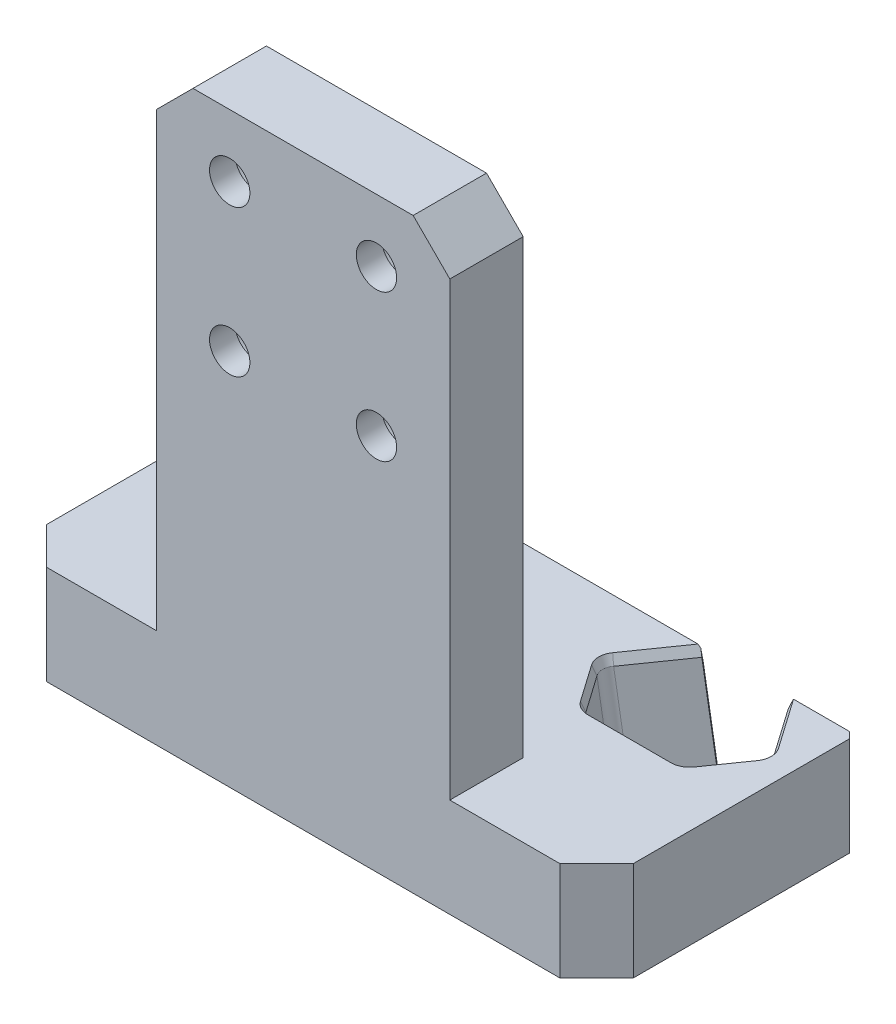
ISO-10303-21;
HEADER;
FILE_DESCRIPTION(('STEP AP214'),'2;1');
FILE_NAME('part.step','',(''),(''),'','','');
FILE_SCHEMA(('AUTOMOTIVE_DESIGN { 1 0 10303 214 1 1 1 1 }'));
ENDSEC;
DATA;
#1=APPLICATION_CONTEXT('core data for automotive mechanical design processes');
#2=APPLICATION_PROTOCOL_DEFINITION('international standard','automotive_design',2000,#1);
#3=PRODUCT_CONTEXT('',#1,'mechanical');
#4=PRODUCT('Part','Part','',(#3));
#5=PRODUCT_RELATED_PRODUCT_CATEGORY('part','',(#4));
#6=PRODUCT_DEFINITION_FORMATION('','',#4);
#7=PRODUCT_DEFINITION_CONTEXT('part definition',#1,'design');
#8=PRODUCT_DEFINITION('design','',#6,#7);
#9=PRODUCT_DEFINITION_SHAPE('','',#8);
#10=(LENGTH_UNIT() NAMED_UNIT(*) SI_UNIT(.MILLI.,.METRE.));
#11=(NAMED_UNIT(*) PLANE_ANGLE_UNIT() SI_UNIT($,.RADIAN.));
#12=(NAMED_UNIT(*) SI_UNIT($,.STERADIAN.) SOLID_ANGLE_UNIT());
#13=UNCERTAINTY_MEASURE_WITH_UNIT(LENGTH_MEASURE(1.E-05),#10,'distance_accuracy_value','');
#14=(GEOMETRIC_REPRESENTATION_CONTEXT(3) GLOBAL_UNCERTAINTY_ASSIGNED_CONTEXT((#13)) GLOBAL_UNIT_ASSIGNED_CONTEXT((#10,
#11,#12)) REPRESENTATION_CONTEXT('',''));
#15=CARTESIAN_POINT('',(0.,0.,0.));
#16=DIRECTION('',(0.,0.,1.));
#17=DIRECTION('',(1.,0.,0.));
#18=AXIS2_PLACEMENT_3D('',#15,#16,#17);
#19=CARTESIAN_POINT('',(160.000000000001,8.21565038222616E-12,-71.9999999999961));
#20=DIRECTION('',(0.,0.,1.));
#21=DIRECTION('',(1.,0.,0.));
#22=AXIS2_PLACEMENT_3D('',#19,#20,#21);
#23=PLANE('',#22);
#24=DIRECTION('',(1.,0.,0.));
#25=VECTOR('',#24,1.);
#26=CARTESIAN_POINT('',(160.000000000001,22.0000000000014,-71.9999999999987));
#27=LINE('',#26,#25);
#28=CARTESIAN_POINT('',(3.00000000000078,22.0000000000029,-71.9999999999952));
#29=VERTEX_POINT('',#28);
#30=CARTESIAN_POINT('',(17.1013154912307,22.0000000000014,-71.999999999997));
#31=VERTEX_POINT('',#30);
#32=EDGE_CURVE('E503',#29,#31,#27,.T.);
#33=ORIENTED_EDGE('',*,*,#32,.T.);
#34=DIRECTION('',(0.169097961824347,-0.985599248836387,0.));
#35=VECTOR('',#34,1.);
#36=CARTESIAN_POINT('',(24.8539598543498,-23.186827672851,-71.9999999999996));
#37=LINE('',#36,#35);
#38=CARTESIAN_POINT('',(20.8758264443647,2.22044604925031E-13,-72.0000000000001));
#39=VERTEX_POINT('',#38);
#40=EDGE_CURVE('E1269',#31,#39,#37,.T.);
#41=ORIENTED_EDGE('',*,*,#40,.T.);
#42=DIRECTION('',(-1.,0.,0.));
#43=VECTOR('',#42,1.);
#44=CARTESIAN_POINT('',(160.000000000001,8.21565038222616E-12,-71.9999999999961));
#45=LINE('',#44,#43);
#46=CARTESIAN_POINT('',(3.00000000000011,4.44089209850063E-13,-72.0000000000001));
#47=VERTEX_POINT('',#46);
#48=EDGE_CURVE('E381',#39,#47,#45,.T.);
#49=ORIENTED_EDGE('',*,*,#48,.T.);
#50=DIRECTION('',(0.,1.,0.));
#51=VECTOR('',#50,1.);
#52=CARTESIAN_POINT('',(3.00000000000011,4.44089209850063E-13,-72.0000000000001));
#53=LINE('',#52,#51);
#54=EDGE_CURVE('E458',#47,#29,#53,.T.);
#55=ORIENTED_EDGE('',*,*,#54,.T.);
#56=EDGE_LOOP('',(#33,#41,#49,#55));
#57=FACE_BOUND('',#56,.T.);
#58=ADVANCED_FACE('F36',(#57),#23,.F.);
#59=DIRECTION('',(1.,0.,0.));
#60=VECTOR('',#59,1.);
#61=CARTESIAN_POINT('',(160.000000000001,22.0000000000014,-71.9999999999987));
#62=LINE('',#61,#60);
#63=CARTESIAN_POINT('',(42.1856497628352,22.0000000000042,-71.9999999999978));
#64=VERTEX_POINT('',#63);
#65=CARTESIAN_POINT('',(117.101315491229,22.0000000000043,-71.9999999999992));
#66=VERTEX_POINT('',#65);
#67=EDGE_CURVE('E510',#64,#66,#62,.T.);
#68=ORIENTED_EDGE('',*,*,#67,.T.);
#69=DIRECTION('',(0.169097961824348,-0.985599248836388,0.));
#70=VECTOR('',#69,1.);
#71=CARTESIAN_POINT('',(121.994547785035,-6.52054525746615,-71.9999999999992));
#72=LINE('',#71,#70);
#73=CARTESIAN_POINT('',(120.875826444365,0.,-71.9999999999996));
#74=VERTEX_POINT('',#73);
#75=EDGE_CURVE('E1177',#66,#74,#72,.T.);
#76=ORIENTED_EDGE('',*,*,#75,.T.);
#77=CARTESIAN_POINT('',(38.4111388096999,7.66053886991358E-12,-71.9999999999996));
#78=VERTEX_POINT('',#77);
#79=EDGE_CURVE('E384',#74,#78,#45,.T.);
#80=ORIENTED_EDGE('',*,*,#79,.T.);
#81=DIRECTION('',(0.169097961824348,0.985599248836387,0.));
#82=VECTOR('',#81,1.);
#83=CARTESIAN_POINT('',(41.8878653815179,20.2643429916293,-71.9999999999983));
#84=LINE('',#83,#82);
#85=EDGE_CURVE('E1286',#78,#64,#84,.T.);
#86=ORIENTED_EDGE('',*,*,#85,.T.);
#87=EDGE_LOOP('',(#68,#76,#80,#86));
#88=FACE_BOUND('',#87,.T.);
#89=ADVANCED_FACE('F1142',(#88),#23,.F.);
#90=CARTESIAN_POINT('',(160.000000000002,160.000000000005,3.99680288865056E-12));
#91=DIRECTION('',(0.,0.,-1.));
#92=DIRECTION('',(0.,1.,0.));
#93=AXIS2_PLACEMENT_3D('',#90,#91,#92);
#94=PLANE('',#93);
#95=CARTESIAN_POINT('',(60.0000000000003,103.,4.44089209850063E-13));
#96=DIRECTION('',(0.,0.,-1.));
#97=DIRECTION('',(0.,1.,0.));
#98=AXIS2_PLACEMENT_3D('',#95,#96,#97);
#99=CIRCLE('',#98,5.5);
#100=CARTESIAN_POINT('',(60.0000000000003,108.5,4.39204228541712E-13));
#101=VERTEX_POINT('',#100);
#102=EDGE_CURVE('E410',#101,#101,#99,.T.);
#103=ORIENTED_EDGE('',*,*,#102,.T.);
#104=EDGE_LOOP('',(#103));
#105=FACE_BOUND('',#104,.T.);
#106=CARTESIAN_POINT('',(100.,103.,4.44089209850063E-13));
#107=DIRECTION('',(0.,0.,-1.));
#108=DIRECTION('',(0.,1.,0.));
#109=AXIS2_PLACEMENT_3D('',#106,#107,#108);
#110=CIRCLE('',#109,5.5);
#111=CARTESIAN_POINT('',(100.,108.5,4.39204228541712E-13));
#112=VERTEX_POINT('',#111);
#113=EDGE_CURVE('E406',#112,#112,#110,.T.);
#114=ORIENTED_EDGE('',*,*,#113,.T.);
#115=EDGE_LOOP('',(#114));
#116=FACE_BOUND('',#115,.T.);
#117=CARTESIAN_POINT('',(60.0000000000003,143.000000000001,4.44089209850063E-13));
#118=DIRECTION('',(0.,0.,-1.));
#119=DIRECTION('',(0.,1.,0.));
#120=AXIS2_PLACEMENT_3D('',#117,#118,#119);
#121=CIRCLE('',#120,5.5);
#122=CARTESIAN_POINT('',(60.0000000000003,148.500000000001,4.39204228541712E-13));
#123=VERTEX_POINT('',#122);
#124=EDGE_CURVE('E402',#123,#123,#121,.T.);
#125=ORIENTED_EDGE('',*,*,#124,.T.);
#126=EDGE_LOOP('',(#125));
#127=FACE_BOUND('',#126,.T.);
#128=CARTESIAN_POINT('',(100.,143.000000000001,3.10862446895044E-12));
#129=DIRECTION('',(0.,0.,-1.));
#130=DIRECTION('',(0.,1.,0.));
#131=AXIS2_PLACEMENT_3D('',#128,#129,#130);
#132=CIRCLE('',#131,5.5);
#133=CARTESIAN_POINT('',(100.,148.500000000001,3.10373948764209E-12));
#134=VERTEX_POINT('',#133);
#135=EDGE_CURVE('E397',#134,#134,#132,.T.);
#136=ORIENTED_EDGE('',*,*,#135,.T.);
#137=EDGE_LOOP('',(#136));
#138=FACE_BOUND('',#137,.T.);
#139=DIRECTION('',(-1.,0.,0.));
#140=VECTOR('',#139,1.);
#141=CARTESIAN_POINT('',(160.000000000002,6.99440505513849E-12,3.99680288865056E-12));
#142=LINE('',#141,#140);
#143=CARTESIAN_POINT('',(150.000000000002,6.66133814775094E-12,3.10862446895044E-12));
#144=VERTEX_POINT('',#143);
#145=CARTESIAN_POINT('',(10.0000000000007,4.9960036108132E-12,3.10862446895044E-12));
#146=VERTEX_POINT('',#145);
#147=EDGE_CURVE('E393',#144,#146,#142,.T.);
#148=ORIENTED_EDGE('',*,*,#147,.F.);
#149=DIRECTION('',(0.,1.,0.));
#150=VECTOR('',#149,1.);
#151=CARTESIAN_POINT('',(150.000000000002,27.0000000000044,2.66453525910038E-12));
#152=LINE('',#151,#150);
#153=CARTESIAN_POINT('',(150.000000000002,27.0000000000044,2.66453525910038E-12));
#154=VERTEX_POINT('',#153);
#155=EDGE_CURVE('E440',#144,#154,#152,.T.);
#156=ORIENTED_EDGE('',*,*,#155,.T.);
#157=DIRECTION('',(-1.,0.,0.));
#158=VECTOR('',#157,1.);
#159=CARTESIAN_POINT('',(160.,27.0000000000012,4.44089209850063E-13));
#160=LINE('',#159,#158);
#161=CARTESIAN_POINT('',(120.,27.0000000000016,1.33226762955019E-12));
#162=VERTEX_POINT('',#161);
#163=EDGE_CURVE('E1490',#154,#162,#160,.T.);
#164=ORIENTED_EDGE('',*,*,#163,.T.);
#165=DIRECTION('',(0.,1.,0.));
#166=VECTOR('',#165,1.);
#167=CARTESIAN_POINT('',(120.,160.,0.));
#168=LINE('',#167,#166);
#169=CARTESIAN_POINT('',(120.,150.,4.44089209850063E-13));
#170=VERTEX_POINT('',#169);
#171=EDGE_CURVE('E362',#162,#170,#168,.T.);
#172=ORIENTED_EDGE('',*,*,#171,.T.);
#173=DIRECTION('',(0.707106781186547,-0.707106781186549,0.));
#174=VECTOR('',#173,1.);
#175=CARTESIAN_POINT('',(110.000000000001,160.000000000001,4.44089209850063E-13));
#176=LINE('',#175,#174);
#177=CARTESIAN_POINT('',(110.000000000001,160.000000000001,4.44089209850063E-13));
#178=VERTEX_POINT('',#177);
#179=EDGE_CURVE('E424',#170,#178,#176,.F.);
#180=ORIENTED_EDGE('',*,*,#179,.T.);
#181=DIRECTION('',(-1.,0.,0.));
#182=VECTOR('',#181,1.);
#183=CARTESIAN_POINT('',(160.000000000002,160.000000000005,3.99680288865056E-12));
#184=LINE('',#183,#182);
#185=CARTESIAN_POINT('',(50.0000000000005,160.000000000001,4.44089209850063E-13));
#186=VERTEX_POINT('',#185);
#187=EDGE_CURVE('E388',#178,#186,#184,.T.);
#188=ORIENTED_EDGE('',*,*,#187,.T.);
#189=DIRECTION('',(0.707106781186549,0.707106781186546,0.));
#190=VECTOR('',#189,1.);
#191=CARTESIAN_POINT('',(40.0000000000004,150.000000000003,1.33226762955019E-12));
#192=LINE('',#191,#190);
#193=CARTESIAN_POINT('',(40.0000000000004,150.000000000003,1.33226762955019E-12));
#194=VERTEX_POINT('',#193);
#195=EDGE_CURVE('E426',#186,#194,#192,.F.);
#196=ORIENTED_EDGE('',*,*,#195,.T.);
#197=DIRECTION('',(0.,-1.,0.));
#198=VECTOR('',#197,1.);
#199=CARTESIAN_POINT('',(40.0000000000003,160.000000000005,2.22044604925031E-12));
#200=LINE('',#199,#198);
#201=CARTESIAN_POINT('',(40.0000000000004,27.0000000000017,4.44089209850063E-13));
#202=VERTEX_POINT('',#201);
#203=EDGE_CURVE('E1492',#194,#202,#200,.T.);
#204=ORIENTED_EDGE('',*,*,#203,.T.);
#205=DIRECTION('',(-1.,0.,0.));
#206=VECTOR('',#205,1.);
#207=CARTESIAN_POINT('',(160.000000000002,27.0000000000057,4.88498130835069E-12));
#208=LINE('',#207,#206);
#209=CARTESIAN_POINT('',(10.0000000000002,27.0000000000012,2.22044604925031E-12));
#210=VERTEX_POINT('',#209);
#211=EDGE_CURVE('E366',#202,#210,#208,.T.);
#212=ORIENTED_EDGE('',*,*,#211,.T.);
#213=DIRECTION('',(0.,-1.,0.));
#214=VECTOR('',#213,1.);
#215=CARTESIAN_POINT('',(10.0000000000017,160.000000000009,5.77315972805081E-12));
#216=LINE('',#215,#214);
#217=EDGE_CURVE('E437',#210,#146,#216,.T.);
#218=ORIENTED_EDGE('',*,*,#217,.T.);
#219=EDGE_LOOP('',(#148,#156,#164,#172,#180,#188,#196,#204,#212,#218));
#220=FACE_BOUND('',#219,.T.);
#221=ADVANCED_FACE('F1149',(#105,#116,#127,#138,#220),#94,.F.);
#222=CARTESIAN_POINT('',(160.000000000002,6.99440505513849E-12,3.99680288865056E-12));
#223=DIRECTION('',(0.,1.,0.));
#224=DIRECTION('',(0.,0.,1.));
#225=AXIS2_PLACEMENT_3D('',#222,#223,#224);
#226=PLANE('',#225);
#227=ORIENTED_EDGE('',*,*,#48,.F.);
#228=DIRECTION('',(0.712216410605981,0.,0.701959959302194));
#229=VECTOR('',#228,1.);
#230=CARTESIAN_POINT('',(19.8601549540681,1.11022302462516E-12,-73.0010450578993));
#231=LINE('',#230,#229);
#232=CARTESIAN_POINT('',(22.3766203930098,9.99200722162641E-13,-70.520818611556));
#233=VERTEX_POINT('',#232);
#234=EDGE_CURVE('E1276',#39,#233,#231,.T.);
#235=ORIENTED_EDGE('',*,*,#234,.T.);
#236=DIRECTION('',(0.573576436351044,0.,-0.819152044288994));
#237=VECTOR('',#236,1.);
#238=CARTESIAN_POINT('',(34.519379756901,7.54951656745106E-12,-87.8624761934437));
#239=LINE('',#238,#237);
#240=CARTESIAN_POINT('',(12.4748896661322,4.44089209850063E-13,-56.3796816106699));
#241=VERTEX_POINT('',#240);
#242=EDGE_CURVE('E489',#233,#241,#239,.F.);
#243=ORIENTED_EDGE('',*,*,#242,.T.);
#244=CARTESIAN_POINT('',(15.8151210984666,1.66533453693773E-12,-54.1077038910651));
#245=DIRECTION('',(0.,1.,0.));
#246=DIRECTION('',(1.,0.,0.));
#247=AXIS2_PLACEMENT_3D('',#244,#245,#246);
#248=ELLIPSE('',#247,4.05844465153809,4.);
#249=CARTESIAN_POINT('',(12.4748896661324,5.77315972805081E-12,-51.8357261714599));
#250=VERTEX_POINT('',#249);
#251=EDGE_CURVE('E1250',#241,#250,#248,.T.);
#252=ORIENTED_EDGE('',*,*,#251,.T.);
#253=DIRECTION('',(-0.573576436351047,0.,-0.819152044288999));
#254=VECTOR('',#253,1.);
#255=CARTESIAN_POINT('',(85.3639898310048,8.88178419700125E-13,52.2606969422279));
#256=LINE('',#255,#254);
#257=CARTESIAN_POINT('',(19.5523801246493,1.33226762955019E-12,-41.728022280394));
#258=VERTEX_POINT('',#257);
#259=EDGE_CURVE('E492',#250,#258,#256,.F.);
#260=ORIENTED_EDGE('',*,*,#259,.T.);
#261=CARTESIAN_POINT('',(22.8926115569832,1.66533453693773E-12,-43.9999999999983));
#262=DIRECTION('',(0.,1.,0.));
#263=DIRECTION('',(-1.,0.,0.));
#264=AXIS2_PLACEMENT_3D('',#261,#262,#263);
#265=ELLIPSE('',#264,4.05844465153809,4.);
#266=CARTESIAN_POINT('',(22.8926115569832,3.33066907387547E-13,-39.9999999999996));
#267=VERTEX_POINT('',#266);
#268=EDGE_CURVE('E1252',#258,#267,#265,.T.);
#269=ORIENTED_EDGE('',*,*,#268,.T.);
#270=DIRECTION('',(1.,0.,0.));
#271=VECTOR('',#270,1.);
#272=CARTESIAN_POINT('',(43.8700000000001,1.55431223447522E-12,-39.9999999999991));
#273=LINE('',#272,#271);
#274=CARTESIAN_POINT('',(37.1073884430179,2.44249065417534E-12,-39.9999999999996));
#275=VERTEX_POINT('',#274);
#276=EDGE_CURVE('E486',#267,#275,#273,.T.);
#277=ORIENTED_EDGE('',*,*,#276,.T.);
#278=CARTESIAN_POINT('',(37.1073884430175,1.4432899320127E-12,-43.9999999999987));
#279=DIRECTION('',(0.,1.,0.));
#280=DIRECTION('',(1.,0.,0.));
#281=AXIS2_PLACEMENT_3D('',#278,#279,#280);
#282=ELLIPSE('',#281,4.05844465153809,4.);
#283=CARTESIAN_POINT('',(40.4476198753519,1.11022302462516E-12,-41.7280222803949));
#284=VERTEX_POINT('',#283);
#285=EDGE_CURVE('E1254',#275,#284,#282,.T.);
#286=ORIENTED_EDGE('',*,*,#285,.T.);
#287=DIRECTION('',(-0.573576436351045,0.,0.819152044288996));
#288=VECTOR('',#287,1.);
#289=CARTESIAN_POINT('',(60.1733915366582,1.11022302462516E-12,-69.8993437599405));
#290=LINE('',#289,#288);
#291=CARTESIAN_POINT('',(47.5251103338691,3.77475828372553E-12,-51.8357261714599));
#292=VERTEX_POINT('',#291);
#293=EDGE_CURVE('E482',#284,#292,#290,.F.);
#294=ORIENTED_EDGE('',*,*,#293,.T.);
#295=CARTESIAN_POINT('',(44.1848789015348,7.7715611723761E-12,-54.1077038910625));
#296=DIRECTION('',(0.,1.,0.));
#297=DIRECTION('',(-1.,0.,0.));
#298=AXIS2_PLACEMENT_3D('',#295,#296,#297);
#299=ELLIPSE('',#298,4.05844465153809,4.);
#300=CARTESIAN_POINT('',(47.5251103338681,1.99840144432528E-12,-56.3796816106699));
#301=VERTEX_POINT('',#300);
#302=EDGE_CURVE('E1256',#292,#301,#299,.T.);
#303=ORIENTED_EDGE('',*,*,#302,.T.);
#304=DIRECTION('',(0.573576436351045,0.,0.819152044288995));
#305=VECTOR('',#304,1.);
#306=CARTESIAN_POINT('',(111.018001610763,4.66293670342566E-12,34.2975645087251));
#307=LINE('',#306,#305);
#308=CARTESIAN_POINT('',(38.0283793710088,3.99680288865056E-12,-69.9424190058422));
#309=VERTEX_POINT('',#308);
#310=EDGE_CURVE('E485',#301,#309,#307,.F.);
#311=ORIENTED_EDGE('',*,*,#310,.T.);
#312=DIRECTION('',(0.182886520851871,0.,-0.983134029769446));
#313=VECTOR('',#312,1.);
#314=CARTESIAN_POINT('',(38.5274265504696,2.22044604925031E-12,-72.6251222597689));
#315=LINE('',#314,#313);
#316=EDGE_CURVE('E1272',#309,#78,#315,.T.);
#317=ORIENTED_EDGE('',*,*,#316,.T.);
#318=ORIENTED_EDGE('',*,*,#79,.F.);
#319=DIRECTION('',(0.712216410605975,0.,0.701959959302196));
#320=VECTOR('',#319,1.);
#321=CARTESIAN_POINT('',(120.041871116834,5.55111512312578E-13,-72.8219457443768));
#322=LINE('',#321,#320);
#323=CARTESIAN_POINT('',(122.376620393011,5.99520433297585E-12,-70.5208186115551));
#324=VERTEX_POINT('',#323);
#325=EDGE_CURVE('E1274',#74,#324,#322,.T.);
#326=ORIENTED_EDGE('',*,*,#325,.T.);
#327=DIRECTION('',(0.573576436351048,0.,-0.819152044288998));
#328=VECTOR('',#327,1.);
#329=CARTESIAN_POINT('',(101.620386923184,3.33066907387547E-13,-40.8778451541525));
#330=LINE('',#329,#328);
#331=CARTESIAN_POINT('',(112.474889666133,5.99520433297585E-12,-56.3796816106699));
#332=VERTEX_POINT('',#331);
#333=EDGE_CURVE('E474',#324,#332,#330,.F.);
#334=ORIENTED_EDGE('',*,*,#333,.T.);
#335=CARTESIAN_POINT('',(115.815121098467,1.77635683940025E-12,-54.107703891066));
#336=DIRECTION('',(0.,1.,0.));
#337=DIRECTION('',(1.,0.,0.));
#338=AXIS2_PLACEMENT_3D('',#335,#336,#337);
#339=ELLIPSE('',#338,4.05844465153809,4.);
#340=CARTESIAN_POINT('',(112.474889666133,2.44249065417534E-12,-51.8357261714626));
#341=VERTEX_POINT('',#340);
#342=EDGE_CURVE('E1258',#332,#341,#339,.T.);
#343=ORIENTED_EDGE('',*,*,#342,.T.);
#344=DIRECTION('',(-0.573576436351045,0.,-0.819152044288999));
#345=VECTOR('',#344,1.);
#346=CARTESIAN_POINT('',(152.464996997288,1.77635683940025E-12,5.27606590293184));
#347=LINE('',#346,#345);
#348=CARTESIAN_POINT('',(119.552380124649,5.55111512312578E-12,-41.7280222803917));
#349=VERTEX_POINT('',#348);
#350=EDGE_CURVE('E478',#341,#349,#347,.F.);
#351=ORIENTED_EDGE('',*,*,#350,.T.);
#352=CARTESIAN_POINT('',(122.892611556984,2.22044604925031E-12,-43.9999999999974));
#353=DIRECTION('',(0.,1.,0.));
#354=DIRECTION('',(-1.,0.,0.));
#355=AXIS2_PLACEMENT_3D('',#352,#353,#354);
#356=ELLIPSE('',#355,4.05844465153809,4.);
#357=CARTESIAN_POINT('',(122.892611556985,6.32827124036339E-12,-39.9999999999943));
#358=VERTEX_POINT('',#357);
#359=EDGE_CURVE('E1260',#349,#358,#356,.T.);
#360=ORIENTED_EDGE('',*,*,#359,.T.);
#361=DIRECTION('',(1.,0.,0.));
#362=VECTOR('',#361,1.);
#363=CARTESIAN_POINT('',(116.130000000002,4.88498130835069E-12,-39.9999999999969));
#364=LINE('',#363,#362);
#365=CARTESIAN_POINT('',(137.107388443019,7.66053886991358E-12,-39.9999999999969));
#366=VERTEX_POINT('',#365);
#367=EDGE_CURVE('E481',#358,#366,#364,.T.);
#368=ORIENTED_EDGE('',*,*,#367,.T.);
#369=CARTESIAN_POINT('',(137.107388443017,2.55351295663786E-12,-43.9999999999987));
#370=DIRECTION('',(0.,1.,0.));
#371=DIRECTION('',(1.,0.,0.));
#372=AXIS2_PLACEMENT_3D('',#369,#370,#371);
#373=ELLIPSE('',#372,4.05844465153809,4.);
#374=CARTESIAN_POINT('',(140.447619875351,6.32827124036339E-12,-41.7280222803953));
#375=VERTEX_POINT('',#374);
#376=EDGE_CURVE('E1262',#366,#375,#373,.T.);
#377=ORIENTED_EDGE('',*,*,#376,.T.);
#378=DIRECTION('',(-0.573576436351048,0.,0.819152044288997));
#379=VECTOR('',#378,1.);
#380=CARTESIAN_POINT('',(127.274398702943,5.32907051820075E-12,-22.9147127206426));
#381=LINE('',#380,#379);
#382=CARTESIAN_POINT('',(147.525110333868,2.22044604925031E-13,-51.8357261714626));
#383=VERTEX_POINT('',#382);
#384=EDGE_CURVE('E475',#375,#383,#381,.F.);
#385=ORIENTED_EDGE('',*,*,#384,.T.);
#386=CARTESIAN_POINT('',(144.184878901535,5.99520433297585E-12,-54.1077038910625));
#387=DIRECTION('',(0.,1.,0.));
#388=DIRECTION('',(-1.,0.,0.));
#389=AXIS2_PLACEMENT_3D('',#386,#387,#388);
#390=ELLIPSE('',#389,4.05844465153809,4.);
#391=CARTESIAN_POINT('',(147.525110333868,1.55431223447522E-12,-56.3796816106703));
#392=VERTEX_POINT('',#391);
#393=EDGE_CURVE('E516',#383,#392,#390,.T.);
#394=ORIENTED_EDGE('',*,*,#393,.T.);
#395=DIRECTION('',(0.573576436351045,0.,0.819152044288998));
#396=VECTOR('',#395,1.);
#397=CARTESIAN_POINT('',(178.119008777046,0.,-12.6870665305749));
#398=LINE('',#397,#396);
#399=CARTESIAN_POINT('',(138.028379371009,1.55431223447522E-12,-69.9424190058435));
#400=VERTEX_POINT('',#399);
#401=EDGE_CURVE('E471',#392,#400,#398,.F.);
#402=ORIENTED_EDGE('',*,*,#401,.T.);
#403=DIRECTION('',(0.182886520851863,0.,-0.983134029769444));
#404=VECTOR('',#403,1.);
#405=CARTESIAN_POINT('',(138.431786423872,2.1094237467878E-12,-72.1109943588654));
#406=LINE('',#405,#404);
#407=CARTESIAN_POINT('',(138.411138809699,1.99840144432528E-12,-71.9999999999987));
#408=VERTEX_POINT('',#407);
#409=EDGE_CURVE('E1170',#400,#408,#406,.T.);
#410=ORIENTED_EDGE('',*,*,#409,.T.);
#411=CARTESIAN_POINT('',(157.000000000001,2.77555756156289E-12,-71.9999999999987));
#412=VERTEX_POINT('',#411);
#413=EDGE_CURVE('E386',#412,#408,#45,.T.);
#414=ORIENTED_EDGE('',*,*,#413,.F.);
#415=DIRECTION('',(0.707106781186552,0.,0.707106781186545));
#416=VECTOR('',#415,1.);
#417=CARTESIAN_POINT('',(160.,5.6621374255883E-12,-68.9999999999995));
#418=LINE('',#417,#416);
#419=CARTESIAN_POINT('',(160.,5.6621374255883E-12,-68.9999999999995));
#420=VERTEX_POINT('',#419);
#421=EDGE_CURVE('E466',#412,#420,#418,.T.);
#422=ORIENTED_EDGE('',*,*,#421,.T.);
#423=DIRECTION('',(0.,0.,-1.));
#424=VECTOR('',#423,1.);
#425=CARTESIAN_POINT('',(160.000000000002,6.99440505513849E-12,3.99680288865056E-12));
#426=LINE('',#425,#424);
#427=CARTESIAN_POINT('',(160.,1.11022302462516E-12,-9.99999999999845));
#428=VERTEX_POINT('',#427);
#429=EDGE_CURVE('E1496',#428,#420,#426,.T.);
#430=ORIENTED_EDGE('',*,*,#429,.F.);
#431=DIRECTION('',(-0.707106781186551,0.,0.707106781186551));
#432=VECTOR('',#431,1.);
#433=CARTESIAN_POINT('',(160.,1.11022302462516E-12,-9.99999999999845));
#434=LINE('',#433,#432);
#435=EDGE_CURVE('E435',#428,#144,#434,.T.);
#436=ORIENTED_EDGE('',*,*,#435,.T.);
#437=ORIENTED_EDGE('',*,*,#147,.T.);
#438=DIRECTION('',(0.707106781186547,0.,0.707106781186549));
#439=VECTOR('',#438,1.);
#440=CARTESIAN_POINT('',(10.0000000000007,4.9960036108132E-12,3.10862446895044E-12));
#441=LINE('',#440,#439);
#442=CARTESIAN_POINT('',(4.44089209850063E-13,0.,-9.9999999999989));
#443=VERTEX_POINT('',#442);
#444=EDGE_CURVE('E433',#146,#443,#441,.F.);
#445=ORIENTED_EDGE('',*,*,#444,.T.);
#446=DIRECTION('',(0.,0.,-1.));
#447=VECTOR('',#446,1.);
#448=CARTESIAN_POINT('',(0.,0.,0.));
#449=LINE('',#448,#447);
#450=CARTESIAN_POINT('',(5.55111512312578E-13,5.55111512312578E-12,-68.9999999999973));
#451=VERTEX_POINT('',#450);
#452=EDGE_CURVE('E1495',#443,#451,#449,.T.);
#453=ORIENTED_EDGE('',*,*,#452,.T.);
#454=DIRECTION('',(-0.707106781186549,0.,0.707106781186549));
#455=VECTOR('',#454,1.);
#456=CARTESIAN_POINT('',(3.00000000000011,4.44089209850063E-13,-72.0000000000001));
#457=LINE('',#456,#455);
#458=EDGE_CURVE('E463',#451,#47,#457,.F.);
#459=ORIENTED_EDGE('',*,*,#458,.T.);
#460=EDGE_LOOP('',(#227,#235,#243,#252,#260,#269,#277,#286,#294,#303,#311,#317,#318,#326,#334,
#343,#351,#360,#368,#377,#385,#394,#402,#410,#414,#422,#430,#436,#437,#445,#453,#459));
#461=FACE_BOUND('',#460,.T.);
#462=ADVANCED_FACE('F1154',(#461),#226,.F.);
#463=ORIENTED_EDGE('',*,*,#413,.T.);
#464=DIRECTION('',(0.169097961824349,0.985599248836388,0.));
#465=VECTOR('',#464,1.);
#466=CARTESIAN_POINT('',(139.028453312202,3.59806057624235,-71.9999999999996));
#467=LINE('',#466,#465);
#468=CARTESIAN_POINT('',(142.185649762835,22.0000000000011,-71.9999999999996));
#469=VERTEX_POINT('',#468);
#470=EDGE_CURVE('E1164',#408,#469,#467,.T.);
#471=ORIENTED_EDGE('',*,*,#470,.T.);
#472=DIRECTION('',(1.,0.,0.));
#473=VECTOR('',#472,1.);
#474=CARTESIAN_POINT('',(160.000000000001,22.0000000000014,-71.9999999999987));
#475=LINE('',#474,#473);
#476=CARTESIAN_POINT('',(157.000000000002,22.0000000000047,-71.9999999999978));
#477=VERTEX_POINT('',#476);
#478=EDGE_CURVE('E506',#469,#477,#475,.T.);
#479=ORIENTED_EDGE('',*,*,#478,.T.);
#480=DIRECTION('',(0.,-1.,0.));
#481=VECTOR('',#480,1.);
#482=CARTESIAN_POINT('',(157.000000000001,2.77555756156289E-12,-71.9999999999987));
#483=LINE('',#482,#481);
#484=EDGE_CURVE('E461',#477,#412,#483,.T.);
#485=ORIENTED_EDGE('',*,*,#484,.T.);
#486=EDGE_LOOP('',(#463,#471,#479,#485));
#487=FACE_BOUND('',#486,.T.);
#488=ADVANCED_FACE('F1145',(#487),#23,.F.);
#489=CARTESIAN_POINT('',(160.000000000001,27.0000000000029,-71.9999999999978));
#490=DIRECTION('',(0.,-1.,0.));
#491=DIRECTION('',(0.,0.,-1.));
#492=AXIS2_PLACEMENT_3D('',#489,#490,#491);
#493=PLANE('',#492);
#494=CARTESIAN_POINT('',(107.40646895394,27.0000000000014,-56.9824299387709));
#495=CARTESIAN_POINT('',(107.259637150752,27.0000000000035,-56.7727461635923));
#496=CARTESIAN_POINT('',(107.128915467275,27.0000000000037,-56.5521090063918));
#497=CARTESIAN_POINT('',(106.902621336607,27.0000000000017,-56.0939640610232));
#498=CARTESIAN_POINT('',(106.807058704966,27.0000000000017,-55.8564584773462));
#499=CARTESIAN_POINT('',(106.653272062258,27.0000000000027,-55.3699736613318));
#500=CARTESIAN_POINT('',(106.595050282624,27.0000000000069,-55.1210014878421));
#501=CARTESIAN_POINT('',(106.517271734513,27.0000000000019,-54.6172505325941));
#502=CARTESIAN_POINT('',(106.497716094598,27.0000000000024,-54.3624790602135));
#503=CARTESIAN_POINT('',(106.497716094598,27.000000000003,-53.8529287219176));
#504=CARTESIAN_POINT('',(106.517271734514,27.0000000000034,-53.5981572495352));
#505=CARTESIAN_POINT('',(106.595050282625,27.000000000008,-53.0944062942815));
#506=CARTESIAN_POINT('',(106.653272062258,27.0000000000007,-52.8454341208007));
#507=CARTESIAN_POINT('',(106.807058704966,27.0000000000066,-52.3589493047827));
#508=CARTESIAN_POINT('',(106.902621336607,27.0000000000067,-52.1214437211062));
#509=CARTESIAN_POINT('',(107.128915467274,27.0000000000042,-51.6632987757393));
#510=CARTESIAN_POINT('',(107.259637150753,27.0000000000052,-51.4426616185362));
#511=CARTESIAN_POINT('',(107.40646895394,27.0000000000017,-51.2329778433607));
#512=B_SPLINE_CURVE_WITH_KNOTS('',3,(#494,#495,#496,#497,#498,#499,#500,#501,#502,#503,#504,
#505,#506,#507,#508,#509,#510,#511),.UNSPECIFIED.,.F.,.F.,(4,2,2,2,2,2,2,2,4),(2.53752565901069,
2.68854240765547,2.83955915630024,2.99057590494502,3.14159265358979,3.29260940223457,
3.44362615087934,3.59464289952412,3.74565964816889),.UNSPECIFIED.);
#513=CARTESIAN_POINT('',(107.40646895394,27.0000000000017,-51.2329778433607));
#514=VERTEX_POINT('',#513);
#515=CARTESIAN_POINT('',(107.40646895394,27.0000000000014,-56.9824299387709));
#516=VERTEX_POINT('',#515);
#517=EDGE_CURVE('E895',#514,#516,#512,.F.);
#518=ORIENTED_EDGE('',*,*,#517,.T.);
#519=DIRECTION('',(0.573576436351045,0.,-0.819152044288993));
#520=VECTOR('',#519,1.);
#521=CARTESIAN_POINT('',(131.765160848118,27.0000000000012,-91.7702472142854));
#522=LINE('',#521,#520);
#523=CARTESIAN_POINT('',(116.983784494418,27.0000000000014,-70.6602540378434));
#524=VERTEX_POINT('',#523);
#525=EDGE_CURVE('E1383',#516,#524,#522,.T.);
#526=ORIENTED_EDGE('',*,*,#525,.T.);
#527=DIRECTION('',(-1.,0.,0.));
#528=VECTOR('',#527,1.);
#529=CARTESIAN_POINT('',(160.000000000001,27.0000000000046,-70.660254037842));
#530=LINE('',#529,#528);
#531=CARTESIAN_POINT('',(43.0162155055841,27.0000000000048,-70.6602540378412));
#532=VERTEX_POINT('',#531);
#533=EDGE_CURVE('E470',#524,#532,#530,.T.);
#534=ORIENTED_EDGE('',*,*,#533,.T.);
#535=DIRECTION('',(0.573576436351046,0.,0.819152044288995));
#536=VECTOR('',#535,1.);
#537=CARTESIAN_POINT('',(80.8732276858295,27.0000000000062,-16.5948375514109));
#538=LINE('',#537,#536);
#539=CARTESIAN_POINT('',(52.593531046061,27.0000000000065,-56.9824299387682));
#540=VERTEX_POINT('',#539);
#541=EDGE_CURVE('E2174',#532,#540,#538,.T.);
#542=ORIENTED_EDGE('',*,*,#541,.T.);
#543=CARTESIAN_POINT('',(52.593531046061,27.000000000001,-51.2329778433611));
#544=CARTESIAN_POINT('',(52.7403628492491,27.000000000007,-51.4426616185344));
#545=CARTESIAN_POINT('',(52.8710845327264,27.000000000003,-51.6632987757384));
#546=CARTESIAN_POINT('',(53.0973786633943,27.0000000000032,-52.1214437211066));
#547=CARTESIAN_POINT('',(53.1929412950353,27.0000000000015,-52.3589493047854));
#548=CARTESIAN_POINT('',(53.3467279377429,27.0000000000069,-52.8454341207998));
#549=CARTESIAN_POINT('',(53.4049497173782,27.0000000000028,-53.0944062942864));
#550=CARTESIAN_POINT('',(53.4827282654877,27.0000000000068,-53.5981572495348));
#551=CARTESIAN_POINT('',(53.5022839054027,27.0000000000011,-53.8529287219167));
#552=CARTESIAN_POINT('',(53.5022839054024,27.0000000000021,-54.362479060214));
#553=CARTESIAN_POINT('',(53.4827282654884,27.0000000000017,-54.6172505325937));
#554=CARTESIAN_POINT('',(53.404949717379,27.000000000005,-55.1210014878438));
#555=CARTESIAN_POINT('',(53.3467279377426,27.0000000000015,-55.3699736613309));
#556=CARTESIAN_POINT('',(53.1929412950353,27.0000000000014,-55.8564584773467));
#557=CARTESIAN_POINT('',(53.0973786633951,27.0000000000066,-56.093964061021));
#558=CARTESIAN_POINT('',(52.8710845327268,27.0000000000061,-56.5521090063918));
#559=CARTESIAN_POINT('',(52.7403628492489,27.0000000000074,-56.7727461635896));
#560=CARTESIAN_POINT('',(52.593531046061,27.0000000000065,-56.9824299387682));
#561=B_SPLINE_CURVE_WITH_KNOTS('',3,(#543,#544,#545,#546,#547,#548,#549,#550,#551,#552,#553,
#554,#555,#556,#557,#558,#559,#560),.UNSPECIFIED.,.F.,.F.,(4,2,2,2,2,2,2,2,4),(2.53752565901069,
2.68854240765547,2.83955915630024,2.99057590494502,3.14159265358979,3.29260940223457,
3.44362615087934,3.59464289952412,3.74565964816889),.UNSPECIFIED.);
#562=CARTESIAN_POINT('',(52.593531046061,27.000000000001,-51.2329778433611));
#563=VERTEX_POINT('',#562);
#564=EDGE_CURVE('E823',#540,#563,#561,.F.);
#565=ORIENTED_EDGE('',*,*,#564,.T.);
#566=DIRECTION('',(-0.573576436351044,0.,0.819152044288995));
#567=VECTOR('',#566,1.);
#568=CARTESIAN_POINT('',(97.6864863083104,27.0000000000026,-115.632392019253));
#569=LINE('',#568,#567);
#570=CARTESIAN_POINT('',(45.5160405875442,27.0000000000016,-41.1252739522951));
#571=VERTEX_POINT('',#570);
#572=EDGE_CURVE('E2170',#563,#571,#569,.T.);
#573=ORIENTED_EDGE('',*,*,#572,.T.);
#574=CARTESIAN_POINT('',(41.2896565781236,27.000000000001,-38.9388129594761));
#575=CARTESIAN_POINT('',(41.7033525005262,27.0000000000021,-38.9387618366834));
#576=CARTESIAN_POINT('',(42.1170092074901,27.0000000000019,-38.9883210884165));
#577=CARTESIAN_POINT('',(42.9203543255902,27.0000000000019,-39.1834943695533));
#578=CARTESIAN_POINT('',(43.3099665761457,27.0000000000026,-39.3291410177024));
#579=CARTESIAN_POINT('',(44.0425692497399,27.0000000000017,-39.7081428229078));
#580=CARTESIAN_POINT('',(44.3854902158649,27.000000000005,-39.941462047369));
#581=CARTESIAN_POINT('',(45.0047667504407,27.0000000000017,-40.4822622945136));
#582=CARTESIAN_POINT('',(45.2811062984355,27.000000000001,-40.7896630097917));
#583=CARTESIAN_POINT('',(45.5160405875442,27.0000000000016,-41.1252739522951));
#584=B_SPLINE_CURVE_WITH_KNOTS('',3,(#574,#575,#576,#577,#578,#579,#580,#581,#582,#583),
.UNSPECIFIED.,.F.,.F.,(4,2,2,2,4),(0.604066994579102,0.845749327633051,1.087431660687,
1.32911399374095,1.5707963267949),.UNSPECIFIED.);
#585=CARTESIAN_POINT('',(41.2896565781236,27.000000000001,-38.9388129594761));
#586=VERTEX_POINT('',#585);
#587=EDGE_CURVE('E753',#571,#586,#584,.F.);
#588=ORIENTED_EDGE('',*,*,#587,.T.);
#589=DIRECTION('',(-1.,0.,0.));
#590=VECTOR('',#589,1.);
#591=CARTESIAN_POINT('',(160.000000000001,27.0000000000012,-38.9388129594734));
#592=LINE('',#591,#590);
#593=CARTESIAN_POINT('',(18.7103434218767,27.,-38.9388129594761));
#594=VERTEX_POINT('',#593);
#595=EDGE_CURVE('E2173',#586,#594,#592,.T.);
#596=ORIENTED_EDGE('',*,*,#595,.T.);
#597=CARTESIAN_POINT('',(14.4839594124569,27.0000000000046,-41.1252739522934));
#598=CARTESIAN_POINT('',(14.7188937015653,27.0000000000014,-40.7896630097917));
#599=CARTESIAN_POINT('',(14.9952332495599,27.0000000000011,-40.4822622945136));
#600=CARTESIAN_POINT('',(15.6145097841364,27.000000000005,-39.9414620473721));
#601=CARTESIAN_POINT('',(15.9574307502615,27.0000000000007,-39.7081428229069));
#602=CARTESIAN_POINT('',(16.690033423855,27.0000000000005,-39.3291410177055));
#603=CARTESIAN_POINT('',(17.0796456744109,27.0000000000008,-39.1834943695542));
#604=CARTESIAN_POINT('',(17.8829907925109,27.0000000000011,-38.9883210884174));
#605=CARTESIAN_POINT('',(18.2966474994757,27.0000000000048,-38.9387618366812));
#606=CARTESIAN_POINT('',(18.7103434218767,27.,-38.9388129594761));
#607=B_SPLINE_CURVE_WITH_KNOTS('',3,(#597,#598,#599,#600,#601,#602,#603,#604,#605,#606),
.UNSPECIFIED.,.F.,.F.,(4,2,2,2,4),(4.71238898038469,4.95407131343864,5.19575364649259,
5.43743597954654,5.67911831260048),.UNSPECIFIED.);
#608=CARTESIAN_POINT('',(14.4839594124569,27.0000000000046,-41.1252739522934));
#609=VERTEX_POINT('',#608);
#610=EDGE_CURVE('E683',#594,#609,#607,.F.);
#611=ORIENTED_EDGE('',*,*,#610,.T.);
#612=DIRECTION('',(-0.573576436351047,0.,-0.819152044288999));
#613=VECTOR('',#612,1.);
#614=CARTESIAN_POINT('',(47.8508950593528,27.0000000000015,6.52764868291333));
#615=LINE('',#614,#613);
#616=CARTESIAN_POINT('',(7.4064689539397,27.0000000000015,-51.2329778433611));
#617=VERTEX_POINT('',#616);
#618=EDGE_CURVE('E2180',#609,#617,#615,.T.);
#619=ORIENTED_EDGE('',*,*,#618,.T.);
#620=CARTESIAN_POINT('',(7.40646895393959,27.,-56.9824299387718));
#621=CARTESIAN_POINT('',(7.25963715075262,27.0000000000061,-56.7727461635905));
#622=CARTESIAN_POINT('',(7.12891546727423,27.0000000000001,-56.5521090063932));
#623=CARTESIAN_POINT('',(6.90262133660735,27.0000000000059,-56.0939640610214));
#624=CARTESIAN_POINT('',(6.80705870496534,26.9999999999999,-55.8564584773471));
#625=CARTESIAN_POINT('',(6.65327206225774,27.0000000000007,-55.3699736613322));
#626=CARTESIAN_POINT('',(6.59505028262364,27.0000000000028,-55.1210014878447));
#627=CARTESIAN_POINT('',(6.51727173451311,27.0000000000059,-54.617250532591));
#628=CARTESIAN_POINT('',(6.49771609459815,27.0000000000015,-54.3624790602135));
#629=CARTESIAN_POINT('',(6.49771609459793,27.0000000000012,-53.8529287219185));
#630=CARTESIAN_POINT('',(6.51727173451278,27.0000000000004,-53.5981572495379));
#631=CARTESIAN_POINT('',(6.59505028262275,27.0000000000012,-53.0944062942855));
#632=CARTESIAN_POINT('',(6.65327206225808,27.0000000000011,-52.8454341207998));
#633=CARTESIAN_POINT('',(6.80705870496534,27.0000000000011,-52.358949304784));
#634=CARTESIAN_POINT('',(6.90262133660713,27.0000000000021,-52.1214437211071));
#635=CARTESIAN_POINT('',(7.12891546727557,27.0000000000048,-51.6632987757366));
#636=CARTESIAN_POINT('',(7.25963715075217,27.0000000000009,-51.4426616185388));
#637=CARTESIAN_POINT('',(7.4064689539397,27.0000000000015,-51.2329778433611));
#638=B_SPLINE_CURVE_WITH_KNOTS('',3,(#620,#621,#622,#623,#624,#625,#626,#627,#628,#629,#630,
#631,#632,#633,#634,#635,#636,#637),.UNSPECIFIED.,.F.,.F.,(4,2,2,2,2,2,2,2,4),(2.53752565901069,
2.68854240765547,2.83955915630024,2.99057590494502,3.14159265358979,3.29260940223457,
3.44362615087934,3.59464289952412,3.74565964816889),.UNSPECIFIED.);
#639=CARTESIAN_POINT('',(7.40646895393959,27.,-56.9824299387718));
#640=VERTEX_POINT('',#639);
#641=EDGE_CURVE('E613',#617,#640,#638,.F.);
#642=ORIENTED_EDGE('',*,*,#641,.T.);
#643=DIRECTION('',(0.573576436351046,0.,-0.819152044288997));
#644=VECTOR('',#643,1.);
#645=CARTESIAN_POINT('',(64.6641536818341,27.000000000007,-138.754878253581));
#646=LINE('',#645,#644);
#647=CARTESIAN_POINT('',(16.9837844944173,27.0000000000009,-70.6602540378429));
#648=VERTEX_POINT('',#647);
#649=EDGE_CURVE('E2181',#640,#648,#646,.T.);
#650=ORIENTED_EDGE('',*,*,#649,.T.);
#651=DIRECTION('',(-1.,0.,0.));
#652=VECTOR('',#651,1.);
#653=CARTESIAN_POINT('',(160.000000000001,27.0000000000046,-70.660254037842));
#654=LINE('',#653,#652);
#655=CARTESIAN_POINT('',(1.66025403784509,26.9999999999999,-70.6602540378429));
#656=VERTEX_POINT('',#655);
#657=EDGE_CURVE('E499',#648,#656,#654,.T.);
#658=ORIENTED_EDGE('',*,*,#657,.T.);
#659=DIRECTION('',(0.707106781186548,0.,-0.707106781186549));
#660=VECTOR('',#659,1.);
#661=CARTESIAN_POINT('',(3.00000000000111,27.0000000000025,-71.9999999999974));
#662=LINE('',#661,#660);
#663=CARTESIAN_POINT('',(8.88178419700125E-13,27.0000000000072,-68.9999999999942));
#664=VERTEX_POINT('',#663);
#665=EDGE_CURVE('E453',#656,#664,#662,.F.);
#666=ORIENTED_EDGE('',*,*,#665,.T.);
#667=DIRECTION('',(0.,0.,1.));
#668=VECTOR('',#667,1.);
#669=CARTESIAN_POINT('',(0.,27.000000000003,-71.9999999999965));
#670=LINE('',#669,#668);
#671=CARTESIAN_POINT('',(6.66133814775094E-13,27.0000000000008,-9.99999999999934));
#672=VERTEX_POINT('',#671);
#673=EDGE_CURVE('E1500',#664,#672,#670,.T.);
#674=ORIENTED_EDGE('',*,*,#673,.T.);
#675=DIRECTION('',(-0.707106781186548,0.,-0.707106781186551));
#676=VECTOR('',#675,1.);
#677=CARTESIAN_POINT('',(10.0000000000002,27.0000000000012,2.22044604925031E-12));
#678=LINE('',#677,#676);
#679=EDGE_CURVE('E442',#672,#210,#678,.F.);
#680=ORIENTED_EDGE('',*,*,#679,.T.);
#681=ORIENTED_EDGE('',*,*,#211,.F.);
#682=DIRECTION('',(0.,0.,-1.));
#683=VECTOR('',#682,1.);
#684=CARTESIAN_POINT('',(40.0000000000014,27.0000000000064,10.0000000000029));
#685=LINE('',#684,#683);
#686=CARTESIAN_POINT('',(40.000000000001,27.0000000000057,-19.9999999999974));
#687=VERTEX_POINT('',#686);
#688=EDGE_CURVE('E375',#202,#687,#685,.T.);
#689=ORIENTED_EDGE('',*,*,#688,.T.);
#690=DIRECTION('',(-1.,0.,0.));
#691=VECTOR('',#690,1.);
#692=CARTESIAN_POINT('',(160.,27.0000000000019,-19.9999999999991));
#693=LINE('',#692,#691);
#694=CARTESIAN_POINT('',(120.,27.0000000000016,-19.9999999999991));
#695=VERTEX_POINT('',#694);
#696=EDGE_CURVE('E372',#695,#687,#693,.T.);
#697=ORIENTED_EDGE('',*,*,#696,.F.);
#698=DIRECTION('',(0.,0.,-1.));
#699=VECTOR('',#698,1.);
#700=CARTESIAN_POINT('',(120.000000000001,27.0000000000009,10.0000000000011));
#701=LINE('',#700,#699);
#702=EDGE_CURVE('E356',#162,#695,#701,.T.);
#703=ORIENTED_EDGE('',*,*,#702,.F.);
#704=ORIENTED_EDGE('',*,*,#163,.F.);
#705=DIRECTION('',(0.70710678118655,0.,-0.70710678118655));
#706=VECTOR('',#705,1.);
#707=CARTESIAN_POINT('',(160.,27.0000000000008,-9.99999999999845));
#708=LINE('',#707,#706);
#709=CARTESIAN_POINT('',(160.,27.0000000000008,-9.99999999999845));
#710=VERTEX_POINT('',#709);
#711=EDGE_CURVE('E444',#154,#710,#708,.T.);
#712=ORIENTED_EDGE('',*,*,#711,.T.);
#713=DIRECTION('',(0.,0.,1.));
#714=VECTOR('',#713,1.);
#715=CARTESIAN_POINT('',(160.000000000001,27.0000000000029,-71.9999999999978));
#716=LINE('',#715,#714);
#717=CARTESIAN_POINT('',(160.,27.0000000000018,-68.9999999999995));
#718=VERTEX_POINT('',#717);
#719=EDGE_CURVE('E1499',#718,#710,#716,.T.);
#720=ORIENTED_EDGE('',*,*,#719,.F.);
#721=DIRECTION('',(-0.707106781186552,0.,-0.707106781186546));
#722=VECTOR('',#721,1.);
#723=CARTESIAN_POINT('',(160.,27.0000000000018,-68.9999999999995));
#724=LINE('',#723,#722);
#725=CARTESIAN_POINT('',(158.339745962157,27.0000000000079,-70.6602540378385));
#726=VERTEX_POINT('',#725);
#727=EDGE_CURVE('E455',#718,#726,#724,.T.);
#728=ORIENTED_EDGE('',*,*,#727,.T.);
#729=DIRECTION('',(-1.,0.,0.));
#730=VECTOR('',#729,1.);
#731=CARTESIAN_POINT('',(160.000000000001,27.0000000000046,-70.660254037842));
#732=LINE('',#731,#730);
#733=CARTESIAN_POINT('',(143.016215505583,27.0000000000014,-70.6602540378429));
#734=VERTEX_POINT('',#733);
#735=EDGE_CURVE('E496',#726,#734,#732,.T.);
#736=ORIENTED_EDGE('',*,*,#735,.T.);
#737=DIRECTION('',(0.573576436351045,0.,0.819152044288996));
#738=VECTOR('',#737,1.);
#739=CARTESIAN_POINT('',(147.974234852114,27.0000000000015,-63.5794685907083));
#740=LINE('',#739,#738);
#741=CARTESIAN_POINT('',(152.593531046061,27.0000000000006,-56.98242993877));
#742=VERTEX_POINT('',#741);
#743=EDGE_CURVE('E1539',#734,#742,#740,.T.);
#744=ORIENTED_EDGE('',*,*,#743,.T.);
#745=CARTESIAN_POINT('',(152.593531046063,27.0000000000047,-51.2329778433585));
#746=CARTESIAN_POINT('',(152.740362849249,27.0000000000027,-51.4426616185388));
#747=CARTESIAN_POINT('',(152.871084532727,27.0000000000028,-51.6632987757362));
#748=CARTESIAN_POINT('',(153.097378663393,27.000000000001,-52.1214437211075));
#749=CARTESIAN_POINT('',(153.192941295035,27.0000000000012,-52.358949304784));
#750=CARTESIAN_POINT('',(153.346727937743,27.0000000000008,-52.8454341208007));
#751=CARTESIAN_POINT('',(153.404949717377,27.0000000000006,-53.0944062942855));
#752=CARTESIAN_POINT('',(153.482728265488,27.0000000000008,-53.598157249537));
#753=CARTESIAN_POINT('',(153.502283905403,27.0000000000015,-53.8529287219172));
#754=CARTESIAN_POINT('',(153.502283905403,27.0000000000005,-54.3624790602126));
#755=CARTESIAN_POINT('',(153.482728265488,27.0000000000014,-54.6172505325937));
#756=CARTESIAN_POINT('',(153.404949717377,27.0000000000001,-55.1210014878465));
#757=CARTESIAN_POINT('',(153.346727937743,27.0000000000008,-55.3699736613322));
#758=CARTESIAN_POINT('',(153.192941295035,27.000000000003,-55.8564584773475));
#759=CARTESIAN_POINT('',(153.097378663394,27.0000000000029,-56.0939640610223));
#760=CARTESIAN_POINT('',(152.871084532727,27.0000000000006,-56.5521090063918));
#761=CARTESIAN_POINT('',(152.74036284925,27.0000000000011,-56.7727461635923));
#762=CARTESIAN_POINT('',(152.593531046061,27.0000000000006,-56.98242993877));
#763=B_SPLINE_CURVE_WITH_KNOTS('',3,(#745,#746,#747,#748,#749,#750,#751,#752,#753,#754,#755,
#756,#757,#758,#759,#760,#761,#762),.UNSPECIFIED.,.F.,.F.,(4,2,2,2,2,2,2,2,4),(2.5375256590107,
2.68854240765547,2.83955915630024,2.99057590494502,3.14159265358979,3.29260940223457,
3.44362615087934,3.59464289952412,3.74565964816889),.UNSPECIFIED.);
#764=CARTESIAN_POINT('',(152.593531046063,27.0000000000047,-51.2329778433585));
#765=VERTEX_POINT('',#764);
#766=EDGE_CURVE('E1102',#742,#765,#763,.F.);
#767=ORIENTED_EDGE('',*,*,#766,.T.);
#768=DIRECTION('',(-0.573576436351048,0.,0.819152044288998));
#769=VECTOR('',#768,1.);
#770=CARTESIAN_POINT('',(164.787493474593,27.0000000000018,-68.6477609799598));
#771=LINE('',#770,#769);
#772=CARTESIAN_POINT('',(145.516040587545,27.0000000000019,-41.1252739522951));
#773=VERTEX_POINT('',#772);
#774=EDGE_CURVE('E1309',#765,#773,#771,.T.);
#775=ORIENTED_EDGE('',*,*,#774,.T.);
#776=CARTESIAN_POINT('',(141.289656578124,27.000000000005,-38.9388129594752));
#777=CARTESIAN_POINT('',(141.703352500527,27.0000000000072,-38.938761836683));
#778=CARTESIAN_POINT('',(142.11700920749,27.0000000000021,-38.988321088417));
#779=CARTESIAN_POINT('',(142.920354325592,27.0000000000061,-39.1834943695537));
#780=CARTESIAN_POINT('',(143.309966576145,27.0000000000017,-39.3291410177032));
#781=CARTESIAN_POINT('',(144.04256924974,27.0000000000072,-39.7081428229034));
#782=CARTESIAN_POINT('',(144.385490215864,27.0000000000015,-39.9414620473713));
#783=CARTESIAN_POINT('',(145.004766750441,27.0000000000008,-40.482262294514));
#784=CARTESIAN_POINT('',(145.281106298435,27.0000000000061,-40.7896630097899));
#785=CARTESIAN_POINT('',(145.516040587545,27.0000000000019,-41.1252739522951));
#786=B_SPLINE_CURVE_WITH_KNOTS('',3,(#776,#777,#778,#779,#780,#781,#782,#783,#784,#785),
.UNSPECIFIED.,.F.,.F.,(4,2,2,2,4),(0.604066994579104,0.845749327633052,1.087431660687,
1.32911399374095,1.5707963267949),.UNSPECIFIED.);
#787=CARTESIAN_POINT('',(141.289656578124,27.000000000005,-38.9388129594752));
#788=VERTEX_POINT('',#787);
#789=EDGE_CURVE('E1034',#773,#788,#786,.F.);
#790=ORIENTED_EDGE('',*,*,#789,.T.);
#791=DIRECTION('',(-1.,0.,0.));
#792=VECTOR('',#791,1.);
#793=CARTESIAN_POINT('',(160.,27.0000000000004,-38.9388129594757));
#794=LINE('',#793,#792);
#795=CARTESIAN_POINT('',(118.710343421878,27.0000000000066,-38.9388129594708));
#796=VERTEX_POINT('',#795);
#797=EDGE_CURVE('E1540',#788,#796,#794,.T.);
#798=ORIENTED_EDGE('',*,*,#797,.T.);
#799=CARTESIAN_POINT('',(114.483959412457,27.0000000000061,-41.1252739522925));
#800=CARTESIAN_POINT('',(114.718893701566,27.0000000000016,-40.7896630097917));
#801=CARTESIAN_POINT('',(114.99523324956,27.0000000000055,-40.4822622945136));
#802=CARTESIAN_POINT('',(115.614509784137,27.0000000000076,-39.9414620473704));
#803=CARTESIAN_POINT('',(115.957430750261,27.0000000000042,-39.7081428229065));
#804=CARTESIAN_POINT('',(116.690033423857,27.0000000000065,-39.3291410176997));
#805=CARTESIAN_POINT('',(117.079645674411,27.0000000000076,-39.183494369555));
#806=CARTESIAN_POINT('',(117.882990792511,27.0000000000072,-38.9883210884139));
#807=CARTESIAN_POINT('',(118.296647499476,27.0000000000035,-38.9387618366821));
#808=CARTESIAN_POINT('',(118.710343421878,27.0000000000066,-38.9388129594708));
#809=B_SPLINE_CURVE_WITH_KNOTS('',3,(#799,#800,#801,#802,#803,#804,#805,#806,#807,#808),
.UNSPECIFIED.,.F.,.F.,(4,2,2,2,4),(4.71238898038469,4.95407131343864,5.19575364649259,
5.43743597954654,5.67911831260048),.UNSPECIFIED.);
#810=CARTESIAN_POINT('',(114.483959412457,27.0000000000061,-41.1252739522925));
#811=VERTEX_POINT('',#810);
#812=EDGE_CURVE('E965',#796,#811,#809,.F.);
#813=ORIENTED_EDGE('',*,*,#812,.T.);
#814=DIRECTION('',(-0.573576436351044,0.,-0.819152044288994));
#815=VECTOR('',#814,1.);
#816=CARTESIAN_POINT('',(114.951902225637,27.0000000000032,-40.4569823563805));
#817=LINE('',#816,#815);
#818=EDGE_CURVE('E1371',#811,#514,#817,.T.);
#819=ORIENTED_EDGE('',*,*,#818,.T.);
#820=EDGE_LOOP('',(#518,#526,#534,#542,#565,#573,#588,#596,#611,#619,#642,#650,#658,#666,#674,
#680,#681,#689,#697,#703,#704,#712,#720,#728,#736,#744,#767,#775,#790,#798,#813,#819));
#821=FACE_BOUND('',#820,.T.);
#822=ADVANCED_FACE('F378',(#821),#493,.F.);
#823=CARTESIAN_POINT('',(160.,27.0000000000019,-19.9999999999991));
#824=DIRECTION('',(0.,0.,1.));
#825=DIRECTION('',(0.,-1.,0.));
#826=AXIS2_PLACEMENT_3D('',#823,#824,#825);
#827=PLANE('',#826);
#828=CARTESIAN_POINT('',(60.0000000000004,143.,-19.9999999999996));
#829=DIRECTION('',(0.,0.,-1.));
#830=DIRECTION('',(0.,1.,0.));
#831=AXIS2_PLACEMENT_3D('',#828,#829,#830);
#832=CIRCLE('',#831,9.00000000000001);
#833=CARTESIAN_POINT('',(60.0000000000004,152.,-19.9999999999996));
#834=VERTEX_POINT('',#833);
#835=EDGE_CURVE('E1472',#834,#834,#832,.T.);
#836=ORIENTED_EDGE('',*,*,#835,.F.);
#837=EDGE_LOOP('',(#836));
#838=FACE_BOUND('',#837,.T.);
#839=CARTESIAN_POINT('',(100.000000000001,103.000000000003,-19.9999999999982));
#840=DIRECTION('',(0.,0.,-1.));
#841=DIRECTION('',(0.,1.,0.));
#842=AXIS2_PLACEMENT_3D('',#839,#840,#841);
#843=CIRCLE('',#842,8.99999999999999);
#844=CARTESIAN_POINT('',(100.000000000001,112.000000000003,-19.9999999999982));
#845=VERTEX_POINT('',#844);
#846=EDGE_CURVE('E1465',#845,#845,#843,.T.);
#847=ORIENTED_EDGE('',*,*,#846,.F.);
#848=EDGE_LOOP('',(#847));
#849=FACE_BOUND('',#848,.T.);
#850=CARTESIAN_POINT('',(60.0000000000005,103.000000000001,-19.9999999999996));
#851=DIRECTION('',(0.,0.,-1.));
#852=DIRECTION('',(0.,1.,0.));
#853=AXIS2_PLACEMENT_3D('',#850,#851,#852);
#854=CIRCLE('',#853,9.00000000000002);
#855=CARTESIAN_POINT('',(60.0000000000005,112.000000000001,-19.9999999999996));
#856=VERTEX_POINT('',#855);
#857=EDGE_CURVE('E400',#856,#856,#854,.T.);
#858=ORIENTED_EDGE('',*,*,#857,.F.);
#859=EDGE_LOOP('',(#858));
#860=FACE_BOUND('',#859,.T.);
#861=CARTESIAN_POINT('',(100.000000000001,143.000000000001,-19.9999999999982));
#862=DIRECTION('',(0.,0.,-1.));
#863=DIRECTION('',(0.,1.,0.));
#864=AXIS2_PLACEMENT_3D('',#861,#862,#863);
#865=CIRCLE('',#864,9.);
#866=CARTESIAN_POINT('',(100.000000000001,152.000000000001,-19.9999999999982));
#867=VERTEX_POINT('',#866);
#868=EDGE_CURVE('E1471',#867,#867,#865,.T.);
#869=ORIENTED_EDGE('',*,*,#868,.F.);
#870=EDGE_LOOP('',(#869));
#871=FACE_BOUND('',#870,.T.);
#872=DIRECTION('',(0.,-1.,0.));
#873=VECTOR('',#872,1.);
#874=CARTESIAN_POINT('',(40.000000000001,27.0000000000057,-19.9999999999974));
#875=LINE('',#874,#873);
#876=CARTESIAN_POINT('',(40.0000000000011,150.,-19.9999999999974));
#877=VERTEX_POINT('',#876);
#878=EDGE_CURVE('E1483',#877,#687,#875,.T.);
#879=ORIENTED_EDGE('',*,*,#878,.F.);
#880=DIRECTION('',(-0.707106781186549,-0.707106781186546,0.));
#881=VECTOR('',#880,1.);
#882=CARTESIAN_POINT('',(40.0000000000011,150.,-19.9999999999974));
#883=LINE('',#882,#881);
#884=CARTESIAN_POINT('',(50.0000000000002,160.000000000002,-19.9999999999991));
#885=VERTEX_POINT('',#884);
#886=EDGE_CURVE('E417',#877,#885,#883,.F.);
#887=ORIENTED_EDGE('',*,*,#886,.T.);
#888=DIRECTION('',(-1.,0.,0.));
#889=VECTOR('',#888,1.);
#890=CARTESIAN_POINT('',(160.,160.000000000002,-19.9999999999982));
#891=LINE('',#890,#889);
#892=CARTESIAN_POINT('',(110.,160.000000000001,-19.9999999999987));
#893=VERTEX_POINT('',#892);
#894=EDGE_CURVE('E382',#893,#885,#891,.T.);
#895=ORIENTED_EDGE('',*,*,#894,.F.);
#896=DIRECTION('',(-0.707106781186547,0.707106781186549,0.));
#897=VECTOR('',#896,1.);
#898=CARTESIAN_POINT('',(110.,160.000000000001,-19.9999999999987));
#899=LINE('',#898,#897);
#900=CARTESIAN_POINT('',(120.000000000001,150.000000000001,-19.9999999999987));
#901=VERTEX_POINT('',#900);
#902=EDGE_CURVE('E374',#893,#901,#899,.F.);
#903=ORIENTED_EDGE('',*,*,#902,.T.);
#904=DIRECTION('',(0.,1.,0.));
#905=VECTOR('',#904,1.);
#906=CARTESIAN_POINT('',(120.,160.000000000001,-19.9999999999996));
#907=LINE('',#906,#905);
#908=EDGE_CURVE('E359',#695,#901,#907,.T.);
#909=ORIENTED_EDGE('',*,*,#908,.F.);
#910=ORIENTED_EDGE('',*,*,#696,.T.);
#911=EDGE_LOOP('',(#879,#887,#895,#903,#909,#910));
#912=FACE_BOUND('',#911,.T.);
#913=ADVANCED_FACE('F371',(#838,#849,#860,#871,#912),#827,.F.);
#914=CARTESIAN_POINT('',(160.,160.000000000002,-19.9999999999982));
#915=DIRECTION('',(0.,-1.,0.));
#916=DIRECTION('',(0.,0.,-1.));
#917=AXIS2_PLACEMENT_3D('',#914,#915,#916);
#918=PLANE('',#917);
#919=ORIENTED_EDGE('',*,*,#894,.T.);
#920=DIRECTION('',(0.,0.,1.));
#921=VECTOR('',#920,1.);
#922=CARTESIAN_POINT('',(50.0000000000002,160.000000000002,-19.9999999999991));
#923=LINE('',#922,#921);
#924=EDGE_CURVE('E422',#885,#186,#923,.T.);
#925=ORIENTED_EDGE('',*,*,#924,.T.);
#926=ORIENTED_EDGE('',*,*,#187,.F.);
#927=DIRECTION('',(0.,0.,-1.));
#928=VECTOR('',#927,1.);
#929=CARTESIAN_POINT('',(110.,160.000000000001,-19.9999999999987));
#930=LINE('',#929,#928);
#931=EDGE_CURVE('E419',#178,#893,#930,.T.);
#932=ORIENTED_EDGE('',*,*,#931,.T.);
#933=EDGE_LOOP('',(#919,#925,#926,#932));
#934=FACE_BOUND('',#933,.T.);
#935=ADVANCED_FACE('F1519',(#934),#918,.F.);
#936=CARTESIAN_POINT('',(160.000000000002,6.99440505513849E-12,3.99680288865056E-12));
#937=DIRECTION('',(1.,0.,0.));
#938=DIRECTION('',(0.,0.,-1.));
#939=AXIS2_PLACEMENT_3D('',#936,#937,#938);
#940=PLANE('',#939);
#941=ORIENTED_EDGE('',*,*,#429,.T.);
#942=DIRECTION('',(0.,1.,0.));
#943=VECTOR('',#942,1.);
#944=CARTESIAN_POINT('',(160.,27.0000000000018,-68.9999999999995));
#945=LINE('',#944,#943);
#946=EDGE_CURVE('E450',#420,#718,#945,.T.);
#947=ORIENTED_EDGE('',*,*,#946,.T.);
#948=ORIENTED_EDGE('',*,*,#719,.T.);
#949=DIRECTION('',(0.,-1.,0.));
#950=VECTOR('',#949,1.);
#951=CARTESIAN_POINT('',(160.,1.11022302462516E-12,-9.99999999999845));
#952=LINE('',#951,#950);
#953=EDGE_CURVE('E430',#710,#428,#952,.T.);
#954=ORIENTED_EDGE('',*,*,#953,.T.);
#955=EDGE_LOOP('',(#941,#947,#948,#954));
#956=FACE_BOUND('',#955,.T.);
#957=ADVANCED_FACE('F1530',(#956),#940,.T.);
#958=CARTESIAN_POINT('',(0.,0.,0.));
#959=DIRECTION('',(1.,0.,0.));
#960=DIRECTION('',(0.,0.,-1.));
#961=AXIS2_PLACEMENT_3D('',#958,#959,#960);
#962=PLANE('',#961);
#963=ORIENTED_EDGE('',*,*,#673,.F.);
#964=DIRECTION('',(0.,-1.,0.));
#965=VECTOR('',#964,1.);
#966=CARTESIAN_POINT('',(5.55111512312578E-13,5.55111512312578E-12,-68.9999999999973));
#967=LINE('',#966,#965);
#968=EDGE_CURVE('E468',#664,#451,#967,.T.);
#969=ORIENTED_EDGE('',*,*,#968,.T.);
#970=ORIENTED_EDGE('',*,*,#452,.F.);
#971=DIRECTION('',(0.,1.,0.));
#972=VECTOR('',#971,1.);
#973=CARTESIAN_POINT('',(4.44089209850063E-13,0.,-9.9999999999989));
#974=LINE('',#973,#972);
#975=EDGE_CURVE('E447',#443,#672,#974,.T.);
#976=ORIENTED_EDGE('',*,*,#975,.T.);
#977=EDGE_LOOP('',(#963,#969,#970,#976));
#978=FACE_BOUND('',#977,.T.);
#979=ADVANCED_FACE('F2071',(#978),#962,.F.);
#980=CARTESIAN_POINT('',(40.0000000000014,27.0000000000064,10.0000000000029));
#981=DIRECTION('',(1.,0.,0.));
#982=DIRECTION('',(0.,1.,0.));
#983=AXIS2_PLACEMENT_3D('',#980,#981,#982);
#984=PLANE('',#983);
#985=ORIENTED_EDGE('',*,*,#203,.F.);
#986=DIRECTION('',(0.,0.,-1.));
#987=VECTOR('',#986,1.);
#988=CARTESIAN_POINT('',(40.0000000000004,150.000000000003,10.0000000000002));
#989=LINE('',#988,#987);
#990=EDGE_CURVE('E396',#194,#877,#989,.T.);
#991=ORIENTED_EDGE('',*,*,#990,.T.);
#992=ORIENTED_EDGE('',*,*,#878,.T.);
#993=ORIENTED_EDGE('',*,*,#688,.F.);
#994=EDGE_LOOP('',(#985,#991,#992,#993));
#995=FACE_BOUND('',#994,.T.);
#996=ADVANCED_FACE('F1518',(#995),#984,.F.);
#997=CARTESIAN_POINT('',(120.,160.,10.0000000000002));
#998=DIRECTION('',(-1.,0.,0.));
#999=DIRECTION('',(0.,-1.,0.));
#1000=AXIS2_PLACEMENT_3D('',#997,#998,#999);
#1001=PLANE('',#1000);
#1002=ORIENTED_EDGE('',*,*,#908,.T.);
#1003=DIRECTION('',(0.,0.,1.));
#1004=VECTOR('',#1003,1.);
#1005=CARTESIAN_POINT('',(120.,150.,9.99999999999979));
#1006=LINE('',#1005,#1004);
#1007=EDGE_CURVE('E428',#901,#170,#1006,.T.);
#1008=ORIENTED_EDGE('',*,*,#1007,.T.);
#1009=ORIENTED_EDGE('',*,*,#171,.F.);
#1010=ORIENTED_EDGE('',*,*,#702,.T.);
#1011=EDGE_LOOP('',(#1002,#1008,#1009,#1010));
#1012=FACE_BOUND('',#1011,.T.);
#1013=ADVANCED_FACE('F358',(#1012),#1001,.F.);
#1014=CARTESIAN_POINT('',(100.000000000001,143.000000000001,-6.99999999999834));
#1015=DIRECTION('',(0.,0.,-1.));
#1016=DIRECTION('',(0.,1.,0.));
#1017=AXIS2_PLACEMENT_3D('',#1014,#1015,#1016);
#1018=CYLINDRICAL_SURFACE('',#1017,9.);
#1019=CARTESIAN_POINT('',(100.000000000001,143.000000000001,-6.99999999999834));
#1020=DIRECTION('',(0.,0.,-1.));
#1021=DIRECTION('',(0.,1.,0.));
#1022=AXIS2_PLACEMENT_3D('',#1019,#1020,#1021);
#1023=CIRCLE('',#1022,9.);
#1024=CARTESIAN_POINT('',(100.000000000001,152.000000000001,-6.99999999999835));
#1025=VERTEX_POINT('',#1024);
#1026=EDGE_CURVE('E1480',#1025,#1025,#1023,.T.);
#1027=ORIENTED_EDGE('',*,*,#1026,.F.);
#1028=EDGE_LOOP('',(#1027));
#1029=FACE_BOUND('',#1028,.T.);
#1030=ORIENTED_EDGE('',*,*,#868,.T.);
#1031=EDGE_LOOP('',(#1030));
#1032=FACE_BOUND('',#1031,.T.);
#1033=ADVANCED_FACE('F2047',(#1029,#1032),#1018,.F.);
#1034=CARTESIAN_POINT('',(100.000000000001,143.000000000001,-6.99999999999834));
#1035=DIRECTION('',(0.,0.,-1.));
#1036=DIRECTION('',(0.,1.,0.));
#1037=AXIS2_PLACEMENT_3D('',#1034,#1035,#1036);
#1038=PLANE('',#1037);
#1039=CARTESIAN_POINT('',(100.000000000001,143.000000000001,-6.99999999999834));
#1040=DIRECTION('',(0.,0.,-1.));
#1041=DIRECTION('',(0.,1.,0.));
#1042=AXIS2_PLACEMENT_3D('',#1039,#1040,#1041);
#1043=CIRCLE('',#1042,5.5);
#1044=CARTESIAN_POINT('',(100.000000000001,148.500000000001,-6.99999999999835));
#1045=VERTEX_POINT('',#1044);
#1046=EDGE_CURVE('E401',#1045,#1045,#1043,.T.);
#1047=ORIENTED_EDGE('',*,*,#1046,.F.);
#1048=EDGE_LOOP('',(#1047));
#1049=FACE_BOUND('',#1048,.T.);
#1050=ORIENTED_EDGE('',*,*,#1026,.T.);
#1051=EDGE_LOOP('',(#1050));
#1052=FACE_BOUND('',#1051,.T.);
#1053=ADVANCED_FACE('F2038',(#1049,#1052),#1038,.T.);
#1054=CARTESIAN_POINT('',(60.0000000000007,103.,-6.99999999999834));
#1055=DIRECTION('',(0.,0.,-1.));
#1056=DIRECTION('',(0.,1.,0.));
#1057=AXIS2_PLACEMENT_3D('',#1054,#1055,#1056);
#1058=CYLINDRICAL_SURFACE('',#1057,9.00000000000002);
#1059=CARTESIAN_POINT('',(60.0000000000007,103.,-6.99999999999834));
#1060=DIRECTION('',(0.,0.,-1.));
#1061=DIRECTION('',(0.,1.,0.));
#1062=AXIS2_PLACEMENT_3D('',#1059,#1060,#1061);
#1063=CIRCLE('',#1062,9.00000000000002);
#1064=CARTESIAN_POINT('',(60.0000000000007,112.,-6.99999999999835));
#1065=VERTEX_POINT('',#1064);
#1066=EDGE_CURVE('E1462',#1065,#1065,#1063,.T.);
#1067=ORIENTED_EDGE('',*,*,#1066,.F.);
#1068=EDGE_LOOP('',(#1067));
#1069=FACE_BOUND('',#1068,.T.);
#1070=ORIENTED_EDGE('',*,*,#857,.T.);
#1071=EDGE_LOOP('',(#1070));
#1072=FACE_BOUND('',#1071,.T.);
#1073=ADVANCED_FACE('F2029',(#1069,#1072),#1058,.F.);
#1074=CARTESIAN_POINT('',(60.0000000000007,103.,-6.99999999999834));
#1075=DIRECTION('',(0.,0.,-1.));
#1076=DIRECTION('',(0.,1.,0.));
#1077=AXIS2_PLACEMENT_3D('',#1074,#1075,#1076);
#1078=PLANE('',#1077);
#1079=CARTESIAN_POINT('',(60.0000000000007,103.,-6.99999999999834));
#1080=DIRECTION('',(0.,0.,-1.));
#1081=DIRECTION('',(0.,1.,0.));
#1082=AXIS2_PLACEMENT_3D('',#1079,#1080,#1081);
#1083=CIRCLE('',#1082,5.5);
#1084=CARTESIAN_POINT('',(60.0000000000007,108.5,-6.99999999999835));
#1085=VERTEX_POINT('',#1084);
#1086=EDGE_CURVE('E413',#1085,#1085,#1083,.T.);
#1087=ORIENTED_EDGE('',*,*,#1086,.F.);
#1088=EDGE_LOOP('',(#1087));
#1089=FACE_BOUND('',#1088,.T.);
#1090=ORIENTED_EDGE('',*,*,#1066,.T.);
#1091=EDGE_LOOP('',(#1090));
#1092=FACE_BOUND('',#1091,.T.);
#1093=ADVANCED_FACE('F2020',(#1089,#1092),#1078,.T.);
#1094=CARTESIAN_POINT('',(100.,103.000000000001,-6.99999999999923));
#1095=DIRECTION('',(0.,0.,-1.));
#1096=DIRECTION('',(0.,1.,0.));
#1097=AXIS2_PLACEMENT_3D('',#1094,#1095,#1096);
#1098=CYLINDRICAL_SURFACE('',#1097,8.99999999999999);
#1099=CARTESIAN_POINT('',(100.,103.000000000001,-6.99999999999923));
#1100=DIRECTION('',(0.,0.,-1.));
#1101=DIRECTION('',(0.,1.,0.));
#1102=AXIS2_PLACEMENT_3D('',#1099,#1100,#1101);
#1103=CIRCLE('',#1102,8.99999999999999);
#1104=CARTESIAN_POINT('',(100.,112.000000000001,-6.99999999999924));
#1105=VERTEX_POINT('',#1104);
#1106=EDGE_CURVE('E1475',#1105,#1105,#1103,.T.);
#1107=ORIENTED_EDGE('',*,*,#1106,.F.);
#1108=EDGE_LOOP('',(#1107));
#1109=FACE_BOUND('',#1108,.T.);
#1110=ORIENTED_EDGE('',*,*,#846,.T.);
#1111=EDGE_LOOP('',(#1110));
#1112=FACE_BOUND('',#1111,.T.);
#1113=ADVANCED_FACE('F2011',(#1109,#1112),#1098,.F.);
#1114=CARTESIAN_POINT('',(100.,103.000000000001,-6.99999999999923));
#1115=DIRECTION('',(0.,0.,-1.));
#1116=DIRECTION('',(0.,1.,0.));
#1117=AXIS2_PLACEMENT_3D('',#1114,#1115,#1116);
#1118=PLANE('',#1117);
#1119=CARTESIAN_POINT('',(100.,103.000000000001,-6.99999999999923));
#1120=DIRECTION('',(0.,0.,-1.));
#1121=DIRECTION('',(0.,1.,0.));
#1122=AXIS2_PLACEMENT_3D('',#1119,#1120,#1121);
#1123=CIRCLE('',#1122,5.5);
#1124=CARTESIAN_POINT('',(100.,108.500000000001,-6.99999999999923));
#1125=VERTEX_POINT('',#1124);
#1126=EDGE_CURVE('E409',#1125,#1125,#1123,.T.);
#1127=ORIENTED_EDGE('',*,*,#1126,.F.);
#1128=EDGE_LOOP('',(#1127));
#1129=FACE_BOUND('',#1128,.T.);
#1130=ORIENTED_EDGE('',*,*,#1106,.T.);
#1131=EDGE_LOOP('',(#1130));
#1132=FACE_BOUND('',#1131,.T.);
#1133=ADVANCED_FACE('F2002',(#1129,#1132),#1118,.T.);
#1134=CARTESIAN_POINT('',(60.0000000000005,143.,-6.9999999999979));
#1135=DIRECTION('',(0.,0.,-1.));
#1136=DIRECTION('',(0.,1.,0.));
#1137=AXIS2_PLACEMENT_3D('',#1134,#1135,#1136);
#1138=CYLINDRICAL_SURFACE('',#1137,9.00000000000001);
#1139=CARTESIAN_POINT('',(60.0000000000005,143.,-6.9999999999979));
#1140=DIRECTION('',(0.,0.,-1.));
#1141=DIRECTION('',(0.,1.,0.));
#1142=AXIS2_PLACEMENT_3D('',#1139,#1140,#1141);
#1143=CIRCLE('',#1142,9.00000000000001);
#1144=CARTESIAN_POINT('',(60.0000000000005,152.,-6.9999999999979));
#1145=VERTEX_POINT('',#1144);
#1146=EDGE_CURVE('E1468',#1145,#1145,#1143,.T.);
#1147=ORIENTED_EDGE('',*,*,#1146,.F.);
#1148=EDGE_LOOP('',(#1147));
#1149=FACE_BOUND('',#1148,.T.);
#1150=ORIENTED_EDGE('',*,*,#835,.T.);
#1151=EDGE_LOOP('',(#1150));
#1152=FACE_BOUND('',#1151,.T.);
#1153=ADVANCED_FACE('F1993',(#1149,#1152),#1138,.F.);
#1154=CARTESIAN_POINT('',(60.0000000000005,143.,-6.9999999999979));
#1155=DIRECTION('',(0.,0.,-1.));
#1156=DIRECTION('',(0.,1.,0.));
#1157=AXIS2_PLACEMENT_3D('',#1154,#1155,#1156);
#1158=PLANE('',#1157);
#1159=CARTESIAN_POINT('',(60.0000000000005,143.,-6.9999999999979));
#1160=DIRECTION('',(0.,0.,-1.));
#1161=DIRECTION('',(0.,1.,0.));
#1162=AXIS2_PLACEMENT_3D('',#1159,#1160,#1161);
#1163=CIRCLE('',#1162,5.5);
#1164=CARTESIAN_POINT('',(60.0000000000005,148.5,-6.9999999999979));
#1165=VERTEX_POINT('',#1164);
#1166=EDGE_CURVE('E405',#1165,#1165,#1163,.T.);
#1167=ORIENTED_EDGE('',*,*,#1166,.F.);
#1168=EDGE_LOOP('',(#1167));
#1169=FACE_BOUND('',#1168,.T.);
#1170=ORIENTED_EDGE('',*,*,#1146,.T.);
#1171=EDGE_LOOP('',(#1170));
#1172=FACE_BOUND('',#1171,.T.);
#1173=ADVANCED_FACE('F1984',(#1169,#1172),#1158,.T.);
#1174=CARTESIAN_POINT('',(99.9999999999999,143.000000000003,6.000000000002));
#1175=DIRECTION('',(0.,0.,-1.));
#1176=DIRECTION('',(0.,1.,0.));
#1177=AXIS2_PLACEMENT_3D('',#1174,#1175,#1176);
#1178=CYLINDRICAL_SURFACE('',#1177,5.5);
#1179=ORIENTED_EDGE('',*,*,#1046,.T.);
#1180=EDGE_LOOP('',(#1179));
#1181=FACE_BOUND('',#1180,.T.);
#1182=ORIENTED_EDGE('',*,*,#135,.F.);
#1183=EDGE_LOOP('',(#1182));
#1184=FACE_BOUND('',#1183,.T.);
#1185=ADVANCED_FACE('F1975',(#1181,#1184),#1178,.F.);
#1186=CARTESIAN_POINT('',(60.0000000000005,143.000000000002,6.00000000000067));
#1187=DIRECTION('',(0.,0.,-1.));
#1188=DIRECTION('',(0.,1.,0.));
#1189=AXIS2_PLACEMENT_3D('',#1186,#1187,#1188);
#1190=CYLINDRICAL_SURFACE('',#1189,5.5);
#1191=ORIENTED_EDGE('',*,*,#1166,.T.);
#1192=EDGE_LOOP('',(#1191));
#1193=FACE_BOUND('',#1192,.T.);
#1194=ORIENTED_EDGE('',*,*,#124,.F.);
#1195=EDGE_LOOP('',(#1194));
#1196=FACE_BOUND('',#1195,.T.);
#1197=ADVANCED_FACE('F1966',(#1193,#1196),#1190,.F.);
#1198=CARTESIAN_POINT('',(100.,103.000000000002,6.00000000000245));
#1199=DIRECTION('',(0.,0.,-1.));
#1200=DIRECTION('',(0.,1.,0.));
#1201=AXIS2_PLACEMENT_3D('',#1198,#1199,#1200);
#1202=CYLINDRICAL_SURFACE('',#1201,5.5);
#1203=ORIENTED_EDGE('',*,*,#1126,.T.);
#1204=EDGE_LOOP('',(#1203));
#1205=FACE_BOUND('',#1204,.T.);
#1206=ORIENTED_EDGE('',*,*,#113,.F.);
#1207=EDGE_LOOP('',(#1206));
#1208=FACE_BOUND('',#1207,.T.);
#1209=ADVANCED_FACE('F1957',(#1205,#1208),#1202,.F.);
#1210=CARTESIAN_POINT('',(60.0000000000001,103.000000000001,6.00000000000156));
#1211=DIRECTION('',(0.,0.,-1.));
#1212=DIRECTION('',(0.,1.,0.));
#1213=AXIS2_PLACEMENT_3D('',#1210,#1211,#1212);
#1214=CYLINDRICAL_SURFACE('',#1213,5.5);
#1215=ORIENTED_EDGE('',*,*,#1086,.T.);
#1216=EDGE_LOOP('',(#1215));
#1217=FACE_BOUND('',#1216,.T.);
#1218=ORIENTED_EDGE('',*,*,#102,.F.);
#1219=EDGE_LOOP('',(#1218));
#1220=FACE_BOUND('',#1219,.T.);
#1221=ADVANCED_FACE('F1949',(#1217,#1220),#1214,.F.);
#1222=CARTESIAN_POINT('',(40.0000000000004,150.000000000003,10.0000000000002));
#1223=DIRECTION('',(0.707106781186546,-0.707106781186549,0.));
#1224=DIRECTION('',(0.,0.,-1.));
#1225=AXIS2_PLACEMENT_3D('',#1222,#1223,#1224);
#1226=PLANE('',#1225);
#1227=ORIENTED_EDGE('',*,*,#195,.F.);
#1228=ORIENTED_EDGE('',*,*,#924,.F.);
#1229=ORIENTED_EDGE('',*,*,#886,.F.);
#1230=ORIENTED_EDGE('',*,*,#990,.F.);
#1231=EDGE_LOOP('',(#1227,#1228,#1229,#1230));
#1232=FACE_BOUND('',#1231,.T.);
#1233=ADVANCED_FACE('F1516',(#1232),#1226,.F.);
#1234=CARTESIAN_POINT('',(110.,160.000000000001,-19.9999999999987));
#1235=DIRECTION('',(-0.707106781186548,-0.707106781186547,0.));
#1236=DIRECTION('',(0.,0.,-1.));
#1237=AXIS2_PLACEMENT_3D('',#1234,#1235,#1236);
#1238=PLANE('',#1237);
#1239=ORIENTED_EDGE('',*,*,#179,.F.);
#1240=ORIENTED_EDGE('',*,*,#1007,.F.);
#1241=ORIENTED_EDGE('',*,*,#902,.F.);
#1242=ORIENTED_EDGE('',*,*,#931,.F.);
#1243=EDGE_LOOP('',(#1239,#1240,#1241,#1242));
#1244=FACE_BOUND('',#1243,.T.);
#1245=ADVANCED_FACE('F1521',(#1244),#1238,.F.);
#1246=CARTESIAN_POINT('',(160.,1.11022302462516E-12,-9.99999999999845));
#1247=DIRECTION('',(0.707106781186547,0.,0.707106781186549));
#1248=DIRECTION('',(0.,1.,0.));
#1249=AXIS2_PLACEMENT_3D('',#1246,#1247,#1248);
#1250=PLANE('',#1249);
#1251=ORIENTED_EDGE('',*,*,#711,.F.);
#1252=ORIENTED_EDGE('',*,*,#155,.F.);
#1253=ORIENTED_EDGE('',*,*,#435,.F.);
#1254=ORIENTED_EDGE('',*,*,#953,.F.);
#1255=EDGE_LOOP('',(#1251,#1252,#1253,#1254));
#1256=FACE_BOUND('',#1255,.T.);
#1257=ADVANCED_FACE('F1527',(#1256),#1250,.T.);
#1258=CARTESIAN_POINT('',(10.0000000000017,160.000000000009,5.77315972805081E-12));
#1259=DIRECTION('',(0.707106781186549,0.,-0.707106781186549));
#1260=DIRECTION('',(0.,-1.,0.));
#1261=AXIS2_PLACEMENT_3D('',#1258,#1259,#1260);
#1262=PLANE('',#1261);
#1263=ORIENTED_EDGE('',*,*,#679,.F.);
#1264=ORIENTED_EDGE('',*,*,#975,.F.);
#1265=ORIENTED_EDGE('',*,*,#444,.F.);
#1266=ORIENTED_EDGE('',*,*,#217,.F.);
#1267=EDGE_LOOP('',(#1263,#1264,#1265,#1266));
#1268=FACE_BOUND('',#1267,.T.);
#1269=ADVANCED_FACE('F1919',(#1268),#1262,.F.);
#1270=CARTESIAN_POINT('',(160.,5.6621374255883E-12,-68.9999999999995));
#1271=DIRECTION('',(0.707106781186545,0.,-0.707106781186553));
#1272=DIRECTION('',(0.,-1.,0.));
#1273=AXIS2_PLACEMENT_3D('',#1270,#1271,#1272);
#1274=PLANE('',#1273);
#1275=ORIENTED_EDGE('',*,*,#484,.F.);
#1276=DIRECTION('',(-0.250562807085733,-0.93511312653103,-0.25056280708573));
#1277=VECTOR('',#1276,1.);
#1278=CARTESIAN_POINT('',(152.221989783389,4.16822311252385,-76.7780102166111));
#1279=LINE('',#1278,#1277);
#1280=EDGE_CURVE('E508',#477,#726,#1279,.F.);
#1281=ORIENTED_EDGE('',*,*,#1280,.T.);
#1282=ORIENTED_EDGE('',*,*,#727,.F.);
#1283=ORIENTED_EDGE('',*,*,#946,.F.);
#1284=ORIENTED_EDGE('',*,*,#421,.F.);
#1285=EDGE_LOOP('',(#1275,#1281,#1282,#1283,#1284));
#1286=FACE_BOUND('',#1285,.T.);
#1287=ADVANCED_FACE('F1533',(#1286),#1274,.T.);
#1288=CARTESIAN_POINT('',(3.00000000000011,4.44089209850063E-13,-72.0000000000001));
#1289=DIRECTION('',(0.707106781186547,0.,0.707106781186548));
#1290=DIRECTION('',(0.,1.,0.));
#1291=AXIS2_PLACEMENT_3D('',#1288,#1289,#1290);
#1292=PLANE('',#1291);
#1293=ORIENTED_EDGE('',*,*,#665,.F.);
#1294=DIRECTION('',(0.250562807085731,-0.93511312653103,-0.25056280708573));
#1295=VECTOR('',#1294,1.);
#1296=CARTESIAN_POINT('',(8.15470053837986,2.76239569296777,-77.1547005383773));
#1297=LINE('',#1296,#1295);
#1298=EDGE_CURVE('E501',#656,#29,#1297,.T.);
#1299=ORIENTED_EDGE('',*,*,#1298,.T.);
#1300=ORIENTED_EDGE('',*,*,#54,.F.);
#1301=ORIENTED_EDGE('',*,*,#458,.F.);
#1302=ORIENTED_EDGE('',*,*,#968,.F.);
#1303=EDGE_LOOP('',(#1293,#1299,#1300,#1301,#1302));
#1304=FACE_BOUND('',#1303,.T.);
#1305=ADVANCED_FACE('F1894',(#1304),#1292,.F.);
#1306=CARTESIAN_POINT('',(164.211689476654,27.0000000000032,-69.0509432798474));
#1307=DIRECTION('',(-0.811180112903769,0.139173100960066,-0.567994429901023));
#1308=DIRECTION('',(-0.573576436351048,0.,0.819152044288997));
#1309=AXIS2_PLACEMENT_3D('',#1306,#1307,#1308);
#1310=PLANE('',#1309);
#1311=DIRECTION('',(0.169097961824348,0.985599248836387,0.));
#1312=VECTOR('',#1311,1.);
#1313=CARTESIAN_POINT('',(145.045376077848,26.7983422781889,-41.7280222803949));
#1314=LINE('',#1313,#1312);
#1315=CARTESIAN_POINT('',(144.6552267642,24.5243298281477,-41.7280222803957));
#1316=VERTEX_POINT('',#1315);
#1317=EDGE_CURVE('E1243',#375,#1316,#1314,.T.);
#1318=ORIENTED_EDGE('',*,*,#1317,.T.);
#1319=DIRECTION('',(-0.573576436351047,0.,0.819152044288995));
#1320=VECTOR('',#1319,1.);
#1321=CARTESIAN_POINT('',(143.584990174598,24.5243298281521,-40.1995660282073));
#1322=LINE('',#1321,#1320);
#1323=CARTESIAN_POINT('',(151.732717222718,24.5243298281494,-51.8357261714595));
#1324=VERTEX_POINT('',#1323);
#1325=EDGE_CURVE('E11',#1316,#1324,#1322,.F.);
#1326=ORIENTED_EDGE('',*,*,#1325,.T.);
#1327=DIRECTION('',(-0.169097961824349,-0.985599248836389,0.));
#1328=VECTOR('',#1327,1.);
#1329=CARTESIAN_POINT('',(152.202953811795,27.2651365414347,-51.8357261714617));
#1330=LINE('',#1329,#1328);
#1331=EDGE_CURVE('E522',#1324,#383,#1330,.T.);
#1332=ORIENTED_EDGE('',*,*,#1331,.T.);
#1333=ORIENTED_EDGE('',*,*,#384,.F.);
#1334=EDGE_LOOP('',(#1318,#1326,#1332,#1333));
#1335=FACE_BOUND('',#1334,.T.);
#1336=ADVANCED_FACE('F38',(#1335),#1310,.T.);
#1337=CARTESIAN_POINT('',(116.130000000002,4.88498130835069E-12,-39.9999999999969));
#1338=DIRECTION('',(0.,0.,1.));
#1339=DIRECTION('',(1.,0.,0.));
#1340=AXIS2_PLACEMENT_3D('',#1337,#1338,#1339);
#1341=PLANE('',#1340);
#1342=DIRECTION('',(0.169097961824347,-0.985599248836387,0.));
#1343=VECTOR('',#1342,1.);
#1344=CARTESIAN_POINT('',(118.199344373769,27.3550346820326,-39.9999999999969));
#1345=LINE('',#1344,#1343);
#1346=CARTESIAN_POINT('',(118.710343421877,24.3766411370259,-39.9999999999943));
#1347=VERTEX_POINT('',#1346);
#1348=EDGE_CURVE('E1239',#358,#1347,#1345,.F.);
#1349=ORIENTED_EDGE('',*,*,#1348,.T.);
#1350=DIRECTION('',(1.,0.,0.));
#1351=VECTOR('',#1350,1.);
#1352=CARTESIAN_POINT('',(116.130000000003,24.3766411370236,-39.9999999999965));
#1353=LINE('',#1352,#1351);
#1354=CARTESIAN_POINT('',(141.289656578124,24.37664113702,-39.9999999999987));
#1355=VERTEX_POINT('',#1354);
#1356=EDGE_CURVE('E528',#1347,#1355,#1353,.T.);
#1357=ORIENTED_EDGE('',*,*,#1356,.T.);
#1358=DIRECTION('',(-0.169097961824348,-0.985599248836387,0.));
#1359=VECTOR('',#1358,1.);
#1360=CARTESIAN_POINT('',(137.168301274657,0.355034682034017,-39.999999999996));
#1361=LINE('',#1360,#1359);
#1362=EDGE_CURVE('E1244',#1355,#366,#1361,.T.);
#1363=ORIENTED_EDGE('',*,*,#1362,.T.);
#1364=ORIENTED_EDGE('',*,*,#367,.F.);
#1365=EDGE_LOOP('',(#1349,#1357,#1363,#1364));
#1366=FACE_BOUND('',#1365,.T.);
#1367=ADVANCED_FACE('F1878',(#1366),#1341,.F.);
#1368=CARTESIAN_POINT('',(106.251679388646,27.0000000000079,-54.1077038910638));
#1369=DIRECTION('',(0.811180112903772,0.139173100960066,-0.567994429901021));
#1370=DIRECTION('',(-0.573576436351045,0.,-0.819152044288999));
#1371=AXIS2_PLACEMENT_3D('',#1368,#1369,#1370);
#1372=PLANE('',#1371);
#1373=DIRECTION('',(0.169097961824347,-0.985599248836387,0.));
#1374=VECTOR('',#1373,1.);
#1375=CARTESIAN_POINT('',(107.797046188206,27.2651365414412,-51.8357261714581));
#1376=LINE('',#1375,#1374);
#1377=CARTESIAN_POINT('',(108.267282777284,24.5243298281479,-51.8357261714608));
#1378=VERTEX_POINT('',#1377);
#1379=EDGE_CURVE('E1229',#341,#1378,#1376,.F.);
#1380=ORIENTED_EDGE('',*,*,#1379,.T.);
#1381=DIRECTION('',(-0.573576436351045,0.,-0.819152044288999));
#1382=VECTOR('',#1381,1.);
#1383=CARTESIAN_POINT('',(106.536689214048,24.5243298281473,-54.3072699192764));
#1384=LINE('',#1383,#1382);
#1385=CARTESIAN_POINT('',(115.344773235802,24.5243298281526,-41.7280222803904));
#1386=VERTEX_POINT('',#1385);
#1387=EDGE_CURVE('E1233',#1378,#1386,#1384,.F.);
#1388=ORIENTED_EDGE('',*,*,#1387,.T.);
#1389=DIRECTION('',(-0.169097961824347,0.985599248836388,0.));
#1390=VECTOR('',#1389,1.);
#1391=CARTESIAN_POINT('',(119.586978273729,-0.201657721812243,-41.7280222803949));
#1392=LINE('',#1391,#1390);
#1393=EDGE_CURVE('E1215',#1386,#349,#1392,.F.);
#1394=ORIENTED_EDGE('',*,*,#1393,.T.);
#1395=ORIENTED_EDGE('',*,*,#350,.F.);
#1396=EDGE_LOOP('',(#1380,#1388,#1394,#1395));
#1397=FACE_BOUND('',#1396,.T.);
#1398=ADVANCED_FACE('F1402',(#1397),#1372,.T.);
#1399=CARTESIAN_POINT('',(118.780000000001,27.0000000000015,-71.9999999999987));
#1400=DIRECTION('',(0.81118011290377,0.139173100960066,0.567994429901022));
#1401=DIRECTION('',(0.573576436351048,0.,-0.819152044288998));
#1402=AXIS2_PLACEMENT_3D('',#1399,#1400,#1401);
#1403=PLANE('',#1402);
#1404=DIRECTION('',(0.169097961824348,-0.985599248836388,0.));
#1405=VECTOR('',#1404,1.);
#1406=CARTESIAN_POINT('',(117.77388194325,26.8273816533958,-70.5208186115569));
#1407=LINE('',#1406,#1405);
#1408=CARTESIAN_POINT('',(118.169013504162,24.5243298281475,-70.5208186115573));
#1409=VERTEX_POINT('',#1408);
#1410=EDGE_CURVE('E1278',#324,#1409,#1407,.F.);
#1411=ORIENTED_EDGE('',*,*,#1410,.T.);
#1412=DIRECTION('',(0.573576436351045,0.,-0.819152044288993));
#1413=VECTOR('',#1412,1.);
#1414=CARTESIAN_POINT('',(119.065009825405,24.5243298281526,-71.8004339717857));
#1415=LINE('',#1414,#1413);
#1416=CARTESIAN_POINT('',(108.267282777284,24.5243298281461,-56.3796816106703));
#1417=VERTEX_POINT('',#1416);
#1418=EDGE_CURVE('E1305',#1409,#1417,#1415,.F.);
#1419=ORIENTED_EDGE('',*,*,#1418,.T.);
#1420=DIRECTION('',(0.169097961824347,-0.985599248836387,0.));
#1421=VECTOR('',#1420,1.);
#1422=CARTESIAN_POINT('',(112.429400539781,0.265136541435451,-56.3796816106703));
#1423=LINE('',#1422,#1421);
#1424=EDGE_CURVE('E1317',#1417,#332,#1423,.T.);
#1425=ORIENTED_EDGE('',*,*,#1424,.T.);
#1426=ORIENTED_EDGE('',*,*,#333,.F.);
#1427=EDGE_LOOP('',(#1411,#1419,#1425,#1426));
#1428=FACE_BOUND('',#1427,.T.);
#1429=ADVANCED_FACE('F1304',(#1428),#1403,.T.);
#1430=CARTESIAN_POINT('',(153.748320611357,27.0000000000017,-54.1077038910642));
#1431=DIRECTION('',(-0.811180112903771,0.139173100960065,0.56799442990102));
#1432=DIRECTION('',(0.573576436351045,0.,0.819152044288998));
#1433=AXIS2_PLACEMENT_3D('',#1430,#1431,#1432);
#1434=PLANE('',#1433);
#1435=DIRECTION('',(-0.169097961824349,-0.985599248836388,0.));
#1436=VECTOR('',#1435,1.);
#1437=CARTESIAN_POINT('',(152.202953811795,27.2651365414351,-56.3796816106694));
#1438=LINE('',#1437,#1436);
#1439=CARTESIAN_POINT('',(151.732717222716,24.5243298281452,-56.3796816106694));
#1440=VERTEX_POINT('',#1439);
#1441=EDGE_CURVE('E513',#392,#1440,#1438,.F.);
#1442=ORIENTED_EDGE('',*,*,#1441,.T.);
#1443=DIRECTION('',(0.573576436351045,0.,0.819152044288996));
#1444=VECTOR('',#1443,1.);
#1445=CARTESIAN_POINT('',(153.463310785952,24.5243298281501,-53.9081378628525));
#1446=LINE('',#1445,#1444);
#1447=CARTESIAN_POINT('',(142.235986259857,24.5243298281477,-69.9424190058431));
#1448=VERTEX_POINT('',#1447);
#1449=EDGE_CURVE('E525',#1440,#1448,#1446,.F.);
#1450=ORIENTED_EDGE('',*,*,#1449,.T.);
#1451=DIRECTION('',(0.169097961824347,0.985599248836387,0.));
#1452=VECTOR('',#1451,1.);
#1453=CARTESIAN_POINT('',(142.977773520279,28.8478885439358,-69.9424190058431));
#1454=LINE('',#1453,#1452);
#1455=EDGE_CURVE('E1175',#1448,#400,#1454,.F.);
#1456=ORIENTED_EDGE('',*,*,#1455,.T.);
#1457=ORIENTED_EDGE('',*,*,#401,.F.);
#1458=EDGE_LOOP('',(#1442,#1450,#1456,#1457));
#1459=FACE_BOUND('',#1458,.T.);
#1460=ADVANCED_FACE('F1547',(#1459),#1434,.T.);
#1461=CARTESIAN_POINT('',(6.25167938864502,27.,-54.1077038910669));
#1462=DIRECTION('',(0.811180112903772,0.139173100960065,0.567994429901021));
#1463=DIRECTION('',(0.573576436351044,0.,-0.819152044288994));
#1464=AXIS2_PLACEMENT_3D('',#1461,#1462,#1463);
#1465=PLANE('',#1464);
#1466=DIRECTION('',(0.169097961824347,-0.985599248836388,0.));
#1467=VECTOR('',#1466,1.);
#1468=CARTESIAN_POINT('',(17.4156456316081,28.9153869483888,-70.5208186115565));
#1469=LINE('',#1468,#1467);
#1470=CARTESIAN_POINT('',(18.1690135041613,24.5243298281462,-70.5208186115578));
#1471=VERTEX_POINT('',#1470);
#1472=EDGE_CURVE('E1264',#233,#1471,#1469,.F.);
#1473=ORIENTED_EDGE('',*,*,#1472,.T.);
#1474=DIRECTION('',(0.573576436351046,0.,-0.819152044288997));
#1475=VECTOR('',#1474,1.);
#1476=CARTESIAN_POINT('',(6.53668921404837,24.5243298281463,-53.9081378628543));
#1477=LINE('',#1476,#1475);
#1478=CARTESIAN_POINT('',(8.26728277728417,24.5243298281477,-56.3796816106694));
#1479=VERTEX_POINT('',#1478);
#1480=EDGE_CURVE('E1182',#1471,#1479,#1477,.F.);
#1481=ORIENTED_EDGE('',*,*,#1480,.T.);
#1482=DIRECTION('',(0.169097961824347,-0.985599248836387,0.));
#1483=VECTOR('',#1482,1.);
#1484=CARTESIAN_POINT('',(12.429400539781,0.265136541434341,-56.3796816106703));
#1485=LINE('',#1484,#1483);
#1486=EDGE_CURVE('E1183',#1479,#241,#1485,.T.);
#1487=ORIENTED_EDGE('',*,*,#1486,.T.);
#1488=ORIENTED_EDGE('',*,*,#242,.F.);
#1489=EDGE_LOOP('',(#1473,#1481,#1487,#1488));
#1490=FACE_BOUND('',#1489,.T.);
#1491=ADVANCED_FACE('F1848',(#1490),#1465,.T.);
#1492=CARTESIAN_POINT('',(41.2200000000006,27.0000000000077,-71.999999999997));
#1493=DIRECTION('',(-0.81118011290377,0.139173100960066,0.567994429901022));
#1494=DIRECTION('',(0.573576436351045,0.,0.819152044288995));
#1495=AXIS2_PLACEMENT_3D('',#1492,#1493,#1494);
#1496=PLANE('',#1495);
#1497=DIRECTION('',(-0.169097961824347,-0.985599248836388,0.));
#1498=VECTOR('',#1497,1.);
#1499=CARTESIAN_POINT('',(52.2029538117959,27.2651365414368,-56.379681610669));
#1500=LINE('',#1499,#1498);
#1501=CARTESIAN_POINT('',(51.7327172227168,24.5243298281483,-56.379681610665));
#1502=VERTEX_POINT('',#1501);
#1503=EDGE_CURVE('E1211',#301,#1502,#1500,.F.);
#1504=ORIENTED_EDGE('',*,*,#1503,.T.);
#1505=DIRECTION('',(0.573576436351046,0.,0.819152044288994));
#1506=VECTOR('',#1505,1.);
#1507=CARTESIAN_POINT('',(40.9349901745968,24.5243298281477,-71.8004339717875));
#1508=LINE('',#1507,#1506);
#1509=CARTESIAN_POINT('',(42.2359862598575,24.5243298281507,-69.9424190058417));
#1510=VERTEX_POINT('',#1509);
#1511=EDGE_CURVE('E1207',#1502,#1510,#1508,.F.);
#1512=ORIENTED_EDGE('',*,*,#1511,.T.);
#1513=DIRECTION('',(0.169097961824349,0.985599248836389,0.));
#1514=VECTOR('',#1513,1.);
#1515=CARTESIAN_POINT('',(42.6195372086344,26.7598832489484,-69.9424190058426));
#1516=LINE('',#1515,#1514);
#1517=EDGE_CURVE('E1173',#1510,#309,#1516,.F.);
#1518=ORIENTED_EDGE('',*,*,#1517,.T.);
#1519=ORIENTED_EDGE('',*,*,#310,.F.);
#1520=EDGE_LOOP('',(#1504,#1512,#1518,#1519));
#1521=FACE_BOUND('',#1520,.T.);
#1522=ADVANCED_FACE('F1611',(#1521),#1496,.T.);
#1523=CARTESIAN_POINT('',(53.7483206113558,27.0000000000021,-54.1077038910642));
#1524=DIRECTION('',(-0.811180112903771,0.139173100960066,-0.567994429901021));
#1525=DIRECTION('',(-0.573576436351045,0.,0.819152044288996));
#1526=AXIS2_PLACEMENT_3D('',#1523,#1524,#1525);
#1527=PLANE('',#1526);
#1528=DIRECTION('',(0.169097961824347,0.985599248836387,0.));
#1529=VECTOR('',#1528,1.);
#1530=CARTESIAN_POINT('',(45.0453760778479,26.7983422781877,-41.7280222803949));
#1531=LINE('',#1530,#1529);
#1532=CARTESIAN_POINT('',(44.6552267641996,24.524329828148,-41.7280222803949));
#1533=VERTEX_POINT('',#1532);
#1534=EDGE_CURVE('E1216',#284,#1533,#1531,.T.);
#1535=ORIENTED_EDGE('',*,*,#1534,.T.);
#1536=DIRECTION('',(-0.573576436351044,0.,0.819152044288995));
#1537=VECTOR('',#1536,1.);
#1538=CARTESIAN_POINT('',(53.4633107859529,24.5243298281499,-54.307269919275));
#1539=LINE('',#1538,#1537);
#1540=CARTESIAN_POINT('',(51.7327172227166,24.5243298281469,-51.8357261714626));
#1541=VERTEX_POINT('',#1540);
#1542=EDGE_CURVE('E1310',#1533,#1541,#1539,.F.);
#1543=ORIENTED_EDGE('',*,*,#1542,.T.);
#1544=DIRECTION('',(-0.169097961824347,-0.985599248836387,0.));
#1545=VECTOR('',#1544,1.);
#1546=CARTESIAN_POINT('',(47.5705994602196,0.265136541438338,-51.8357261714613));
#1547=LINE('',#1546,#1545);
#1548=EDGE_CURVE('E1439',#1541,#292,#1547,.T.);
#1549=ORIENTED_EDGE('',*,*,#1548,.T.);
#1550=ORIENTED_EDGE('',*,*,#293,.F.);
#1551=EDGE_LOOP('',(#1535,#1543,#1549,#1550));
#1552=FACE_BOUND('',#1551,.T.);
#1553=ADVANCED_FACE('F1625',(#1552),#1527,.T.);
#1554=CARTESIAN_POINT('',(43.8700000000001,1.55431223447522E-12,-39.9999999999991));
#1555=DIRECTION('',(0.,0.,1.));
#1556=DIRECTION('',(1.,0.,0.));
#1557=AXIS2_PLACEMENT_3D('',#1554,#1555,#1556);
#1558=PLANE('',#1557);
#1559=DIRECTION('',(0.169097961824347,-0.985599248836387,0.));
#1560=VECTOR('',#1559,1.);
#1561=CARTESIAN_POINT('',(18.1993443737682,27.3550346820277,-39.9999999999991));
#1562=LINE('',#1561,#1560);
#1563=CARTESIAN_POINT('',(18.7103434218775,24.3766411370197,-39.9999999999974));
#1564=VERTEX_POINT('',#1563);
#1565=EDGE_CURVE('E1200',#267,#1564,#1562,.F.);
#1566=ORIENTED_EDGE('',*,*,#1565,.T.);
#1567=DIRECTION('',(1.,0.,0.));
#1568=VECTOR('',#1567,1.);
#1569=CARTESIAN_POINT('',(43.8700000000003,24.3766411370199,-39.9999999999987));
#1570=LINE('',#1569,#1568);
#1571=CARTESIAN_POINT('',(41.2896565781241,24.3766411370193,-39.9999999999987));
#1572=VERTEX_POINT('',#1571);
#1573=EDGE_CURVE('E1205',#1564,#1572,#1570,.T.);
#1574=ORIENTED_EDGE('',*,*,#1573,.T.);
#1575=DIRECTION('',(-0.169097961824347,-0.985599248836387,0.));
#1576=VECTOR('',#1575,1.);
#1577=CARTESIAN_POINT('',(37.1683012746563,0.355034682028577,-39.9999999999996));
#1578=LINE('',#1577,#1576);
#1579=EDGE_CURVE('E1186',#1572,#275,#1578,.T.);
#1580=ORIENTED_EDGE('',*,*,#1579,.T.);
#1581=ORIENTED_EDGE('',*,*,#276,.F.);
#1582=EDGE_LOOP('',(#1566,#1574,#1580,#1581));
#1583=FACE_BOUND('',#1582,.T.);
#1584=ADVANCED_FACE('F1446',(#1583),#1558,.F.);
#1585=CARTESIAN_POINT('',(16.1300000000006,27.0000000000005,-39.9999999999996));
#1586=DIRECTION('',(0.811180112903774,0.139173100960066,-0.567994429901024));
#1587=DIRECTION('',(-0.573576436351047,0.,-0.819152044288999));
#1588=AXIS2_PLACEMENT_3D('',#1585,#1586,#1587);
#1589=PLANE('',#1588);
#1590=DIRECTION('',(0.169097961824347,-0.985599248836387,0.));
#1591=VECTOR('',#1590,1.);
#1592=CARTESIAN_POINT('',(7.79704618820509,27.2651365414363,-51.8357261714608));
#1593=LINE('',#1592,#1591);
#1594=CARTESIAN_POINT('',(8.26728277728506,24.5243298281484,-51.8357261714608));
#1595=VERTEX_POINT('',#1594);
#1596=EDGE_CURVE('E1187',#250,#1595,#1593,.F.);
#1597=ORIENTED_EDGE('',*,*,#1596,.T.);
#1598=DIRECTION('',(-0.573576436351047,0.,-0.819152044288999));
#1599=VECTOR('',#1598,1.);
#1600=CARTESIAN_POINT('',(16.4150098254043,24.5243298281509,-40.1995660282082));
#1601=LINE('',#1600,#1599);
#1602=CARTESIAN_POINT('',(15.3447732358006,24.5243298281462,-41.7280222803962));
#1603=VERTEX_POINT('',#1602);
#1604=EDGE_CURVE('E1432',#1595,#1603,#1601,.F.);
#1605=ORIENTED_EDGE('',*,*,#1604,.T.);
#1606=DIRECTION('',(-0.169097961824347,0.985599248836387,0.));
#1607=VECTOR('',#1606,1.);
#1608=CARTESIAN_POINT('',(19.5869782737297,-0.201657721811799,-41.7280222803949));
#1609=LINE('',#1608,#1607);
#1610=EDGE_CURVE('E1418',#1603,#258,#1609,.F.);
#1611=ORIENTED_EDGE('',*,*,#1610,.T.);
#1612=ORIENTED_EDGE('',*,*,#259,.F.);
#1613=EDGE_LOOP('',(#1597,#1605,#1611,#1612));
#1614=FACE_BOUND('',#1613,.T.);
#1615=ADVANCED_FACE('F1818',(#1614),#1589,.T.);
#1616=CARTESIAN_POINT('',(160.000000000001,27.0000000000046,-70.660254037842));
#1617=DIRECTION('',(0.,-0.258819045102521,0.965925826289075));
#1618=DIRECTION('',(-1.,0.,0.));
#1619=AXIS2_PLACEMENT_3D('',#1616,#1617,#1618);
#1620=PLANE('',#1619);
#1621=ORIENTED_EDGE('',*,*,#657,.F.);
#1622=DIRECTION('',(-0.563303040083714,0.798096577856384,0.21384933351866));
#1623=VECTOR('',#1622,1.);
#1624=CARTESIAN_POINT('',(62.3643048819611,-37.2958326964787,-87.8882704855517));
#1625=LINE('',#1624,#1623);
#1626=CARTESIAN_POINT('',(17.5257761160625,26.2320977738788,-70.8660128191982));
#1627=VERTEX_POINT('',#1626);
#1628=EDGE_CURVE('E2185',#648,#1627,#1625,.F.);
#1629=ORIENTED_EDGE('',*,*,#1628,.T.);
#1630=DIRECTION('',(0.0964266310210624,0.961424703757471,0.257612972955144));
#1631=VECTOR('',#1630,1.);
#1632=CARTESIAN_POINT('',(18.9268160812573,40.2012100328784,-67.1230004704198));
#1633=LINE('',#1632,#1631);
#1634=EDGE_CURVE('E1267',#1627,#31,#1633,.F.);
#1635=ORIENTED_EDGE('',*,*,#1634,.T.);
#1636=ORIENTED_EDGE('',*,*,#32,.F.);
#1637=ORIENTED_EDGE('',*,*,#1298,.F.);
#1638=EDGE_LOOP('',(#1621,#1629,#1635,#1636,#1637));
#1639=FACE_BOUND('',#1638,.T.);
#1640=ADVANCED_FACE('F1811',(#1639),#1620,.F.);
#1641=CARTESIAN_POINT('',(160.000000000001,27.0000000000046,-70.660254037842));
#1642=DIRECTION('',(0.,-0.258819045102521,0.965925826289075));
#1643=DIRECTION('',(-1.,0.,0.));
#1644=AXIS2_PLACEMENT_3D('',#1641,#1642,#1643);
#1645=PLANE('',#1644);
#1646=DIRECTION('',(-0.116771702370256,-0.959317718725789,-0.257048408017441));
#1647=VECTOR('',#1646,1.);
#1648=CARTESIAN_POINT('',(143.028879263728,28.9274060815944,-70.1438071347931));
#1649=LINE('',#1648,#1647);
#1650=CARTESIAN_POINT('',(142.748014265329,26.6200082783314,-70.7620725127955));
#1651=VERTEX_POINT('',#1650);
#1652=EDGE_CURVE('E1172',#469,#1651,#1649,.F.);
#1653=ORIENTED_EDGE('',*,*,#1652,.T.);
#1654=DIRECTION('',(-0.56330304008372,-0.79809657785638,-0.213849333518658));
#1655=VECTOR('',#1654,1.);
#1656=CARTESIAN_POINT('',(148.405345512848,34.6354038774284,-68.6143537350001));
#1657=LINE('',#1656,#1655);
#1658=EDGE_CURVE('E532',#1651,#734,#1657,.F.);
#1659=ORIENTED_EDGE('',*,*,#1658,.T.);
#1660=ORIENTED_EDGE('',*,*,#735,.F.);
#1661=ORIENTED_EDGE('',*,*,#1280,.F.);
#1662=ORIENTED_EDGE('',*,*,#478,.F.);
#1663=EDGE_LOOP('',(#1653,#1659,#1660,#1661,#1662));
#1664=FACE_BOUND('',#1663,.T.);
#1665=ADVANCED_FACE('F1537',(#1664),#1645,.F.);
#1666=CARTESIAN_POINT('',(160.000000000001,27.0000000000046,-70.660254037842));
#1667=DIRECTION('',(0.,-0.258819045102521,0.965925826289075));
#1668=DIRECTION('',(-1.,0.,0.));
#1669=AXIS2_PLACEMENT_3D('',#1666,#1667,#1668);
#1670=PLANE('',#1669);
#1671=ORIENTED_EDGE('',*,*,#533,.F.);
#1672=DIRECTION('',(-0.563303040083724,0.798096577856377,0.213849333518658));
#1673=VECTOR('',#1672,1.);
#1674=CARTESIAN_POINT('',(130.633273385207,7.66119016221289,-75.8420725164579));
#1675=LINE('',#1674,#1673);
#1676=CARTESIAN_POINT('',(117.525776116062,26.2320977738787,-70.8660128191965));
#1677=VERTEX_POINT('',#1676);
#1678=EDGE_CURVE('E1390',#524,#1677,#1675,.F.);
#1679=ORIENTED_EDGE('',*,*,#1678,.T.);
#1680=DIRECTION('',(0.0964266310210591,0.96142470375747,0.257612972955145));
#1681=VECTOR('',#1680,1.);
#1682=CARTESIAN_POINT('',(117.99700656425,30.9305155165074,-69.6070755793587));
#1683=LINE('',#1682,#1681);
#1684=EDGE_CURVE('E1284',#1677,#66,#1683,.F.);
#1685=ORIENTED_EDGE('',*,*,#1684,.T.);
#1686=ORIENTED_EDGE('',*,*,#67,.F.);
#1687=DIRECTION('',(-0.116771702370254,-0.959317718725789,-0.257048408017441));
#1688=VECTOR('',#1687,1.);
#1689=CARTESIAN_POINT('',(44.3924423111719,40.1295223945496,-67.1422091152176));
#1690=LINE('',#1689,#1688);
#1691=CARTESIAN_POINT('',(42.7480142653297,26.6200082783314,-70.7620725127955));
#1692=VERTEX_POINT('',#1691);
#1693=EDGE_CURVE('E1281',#64,#1692,#1690,.F.);
#1694=ORIENTED_EDGE('',*,*,#1693,.T.);
#1695=DIRECTION('',(-0.563303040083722,-0.798096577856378,-0.213849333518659));
#1696=VECTOR('',#1695,1.);
#1697=CARTESIAN_POINT('',(80.1363770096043,79.5924267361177,-56.568155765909));
#1698=LINE('',#1697,#1696);
#1699=EDGE_CURVE('E1616',#1692,#532,#1698,.F.);
#1700=ORIENTED_EDGE('',*,*,#1699,.T.);
#1701=EDGE_LOOP('',(#1671,#1679,#1685,#1686,#1694,#1700));
#1702=FACE_BOUND('',#1701,.T.);
#1703=ADVANCED_FACE('F1553',(#1702),#1670,.F.);
#1704=CARTESIAN_POINT('',(148.95823336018,27.8218289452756,-54.107703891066));
#1705=DIRECTION('',(-0.169097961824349,-0.985599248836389,0.));
#1706=DIRECTION('',(0.985599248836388,-0.169097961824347,0.));
#1707=AXIS2_PLACEMENT_3D('',#1704,#1705,#1706);
#1708=CYLINDRICAL_SURFACE('',#1707,4.);
#1709=ORIENTED_EDGE('',*,*,#1331,.F.);
#1710=CARTESIAN_POINT('',(151.732717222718,24.5243298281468,-56.3796816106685));
#1711=CARTESIAN_POINT('',(151.849642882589,24.5294607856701,-56.2139625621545));
#1712=CARTESIAN_POINT('',(151.953739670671,24.534028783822,-56.0395867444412));
#1713=CARTESIAN_POINT('',(152.133943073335,24.5419365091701,-55.6775017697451));
#1714=CARTESIAN_POINT('',(152.210041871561,24.5452758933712,-55.489794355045));
#1715=CARTESIAN_POINT('',(152.332505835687,24.5506498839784,-55.1053115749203));
#1716=CARTESIAN_POINT('',(152.378869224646,24.5526844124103,-54.9085417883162));
#1717=CARTESIAN_POINT('',(152.440806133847,24.5554023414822,-54.5104130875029));
#1718=CARTESIAN_POINT('',(152.456378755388,24.5560857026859,-54.3090599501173));
#1719=CARTESIAN_POINT('',(152.456378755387,24.5560857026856,-53.9063478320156));
#1720=CARTESIAN_POINT('',(152.440806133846,24.5554023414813,-53.70499469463));
#1721=CARTESIAN_POINT('',(152.378869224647,24.5526844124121,-53.3068659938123));
#1722=CARTESIAN_POINT('',(152.332505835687,24.5506498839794,-53.11009620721));
#1723=CARTESIAN_POINT('',(152.21004187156,24.545275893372,-52.7256134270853));
#1724=CARTESIAN_POINT('',(152.133943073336,24.5419365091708,-52.5379060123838));
#1725=CARTESIAN_POINT('',(151.953739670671,24.5340287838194,-52.1758210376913));
#1726=CARTESIAN_POINT('',(151.849642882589,24.5294607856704,-52.0014452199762));
#1727=CARTESIAN_POINT('',(151.732717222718,24.5243298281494,-51.8357261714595));
#1728=B_SPLINE_CURVE_WITH_KNOTS('',3,(#1710,#1711,#1712,#1713,#1714,#1715,#1716,#1717,#1718,
#1719,#1720,#1721,#1722,#1723,#1724,#1725,#1726,#1727),.UNSPECIFIED.,.F.,.F.,(4,2,2,2,2,2,2,2,
4),(2.5375256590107,2.68854240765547,2.83955915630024,2.99057590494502,3.14159265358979,
3.29260940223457,3.44362615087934,3.59464289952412,3.74565964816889),.UNSPECIFIED.);
#1729=EDGE_CURVE('E46',#1324,#1440,#1728,.F.);
#1730=ORIENTED_EDGE('',*,*,#1729,.T.);
#1731=ORIENTED_EDGE('',*,*,#1441,.F.);
#1732=ORIENTED_EDGE('',*,*,#393,.F.);
#1733=EDGE_LOOP('',(#1709,#1730,#1731,#1732));
#1734=FACE_BOUND('',#1733,.T.);
#1735=ADVANCED_FACE('F1550',(#1734),#1708,.F.);
#1736=CARTESIAN_POINT('',(11.3242285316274,26.1754801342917,-54.1077038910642));
#1737=DIRECTION('',(0.169097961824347,-0.985599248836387,0.));
#1738=DIRECTION('',(0.985599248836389,0.169097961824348,0.));
#1739=AXIS2_PLACEMENT_3D('',#1736,#1737,#1738);
#1740=CYLINDRICAL_SURFACE('',#1739,4.);
#1741=ORIENTED_EDGE('',*,*,#1486,.F.);
#1742=CARTESIAN_POINT('',(8.26728277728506,24.5243298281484,-51.8357261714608));
#1743=CARTESIAN_POINT('',(8.15035711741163,24.5294607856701,-52.0014452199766));
#1744=CARTESIAN_POINT('',(8.04626032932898,24.5340287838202,-52.1758210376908));
#1745=CARTESIAN_POINT('',(7.8660569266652,24.5419365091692,-52.5379060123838));
#1746=CARTESIAN_POINT('',(7.78995812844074,24.5452758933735,-52.7256134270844));
#1747=CARTESIAN_POINT('',(7.66749416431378,24.5506498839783,-53.11009620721));
#1748=CARTESIAN_POINT('',(7.62113077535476,24.5526844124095,-53.3068659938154));
#1749=CARTESIAN_POINT('',(7.55919386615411,24.5554023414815,-53.70499469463));
#1750=CARTESIAN_POINT('',(7.54362124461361,24.5560857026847,-53.9063478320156));
#1751=CARTESIAN_POINT('',(7.54362124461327,24.5560857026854,-54.3090599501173));
#1752=CARTESIAN_POINT('',(7.55919386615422,24.5554023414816,-54.5104130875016));
#1753=CARTESIAN_POINT('',(7.62113077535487,24.5526844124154,-54.9085417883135));
#1754=CARTESIAN_POINT('',(7.667494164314,24.5506498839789,-55.1053115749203));
#1755=CARTESIAN_POINT('',(7.7899581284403,24.5452758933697,-55.4897943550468));
#1756=CARTESIAN_POINT('',(7.86605692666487,24.5419365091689,-55.6775017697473));
#1757=CARTESIAN_POINT('',(8.04626032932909,24.53402878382,-56.0395867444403));
#1758=CARTESIAN_POINT('',(8.1503571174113,24.5294607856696,-56.2139625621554));
#1759=CARTESIAN_POINT('',(8.26728277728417,24.5243298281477,-56.3796816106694));
#1760=B_SPLINE_CURVE_WITH_KNOTS('',3,(#1742,#1743,#1744,#1745,#1746,#1747,#1748,#1749,#1750,
#1751,#1752,#1753,#1754,#1755,#1756,#1757,#1758,#1759),.UNSPECIFIED.,.F.,.F.,(4,2,2,2,2,2,2,2,
4),(2.53752565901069,2.68854240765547,2.83955915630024,2.99057590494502,3.14159265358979,
3.29260940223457,3.44362615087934,3.59464289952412,3.74565964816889),.UNSPECIFIED.);
#1761=EDGE_CURVE('E1435',#1479,#1595,#1760,.F.);
#1762=ORIENTED_EDGE('',*,*,#1761,.T.);
#1763=ORIENTED_EDGE('',*,*,#1596,.F.);
#1764=ORIENTED_EDGE('',*,*,#251,.F.);
#1765=EDGE_LOOP('',(#1741,#1762,#1763,#1764));
#1766=FACE_BOUND('',#1765,.T.);
#1767=ADVANCED_FACE('F1552',(#1766),#1740,.F.);
#1768=CARTESIAN_POINT('',(23.4924415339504,-3.49615080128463,-43.9999999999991));
#1769=DIRECTION('',(-0.169097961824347,0.985599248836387,0.));
#1770=DIRECTION('',(-0.985599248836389,-0.169097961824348,0.));
#1771=AXIS2_PLACEMENT_3D('',#1768,#1769,#1770);
#1772=CYLINDRICAL_SURFACE('',#1771,4.);
#1773=ORIENTED_EDGE('',*,*,#1610,.F.);
#1774=CARTESIAN_POINT('',(18.7103434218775,24.3766411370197,-39.9999999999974));
#1775=CARTESIAN_POINT('',(18.3809075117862,24.3910975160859,-39.9999595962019));
#1776=CARTESIAN_POINT('',(18.0515028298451,24.4055525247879,-40.0391276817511));
#1777=CARTESIAN_POINT('',(17.4117799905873,24.4336249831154,-40.1933786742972));
#1778=CARTESIAN_POINT('',(17.1015224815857,24.4472397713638,-40.3084873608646));
#1779=CARTESIAN_POINT('',(16.5181335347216,24.4728401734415,-40.6080232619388));
#1780=CARTESIAN_POINT('',(16.2450574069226,24.4848233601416,-40.7924220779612));
#1781=CARTESIAN_POINT('',(15.7519127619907,24.5064636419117,-41.2198318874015));
#1782=CARTESIAN_POINT('',(15.5318570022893,24.516120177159,-41.4627794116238));
#1783=CARTESIAN_POINT('',(15.3447732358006,24.5243298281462,-41.7280222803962));
#1784=B_SPLINE_CURVE_WITH_KNOTS('',3,(#1774,#1775,#1776,#1777,#1778,#1779,#1780,#1781,#1782,
#1783),.UNSPECIFIED.,.F.,.F.,(4,2,2,2,4),(4.71238898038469,4.95407131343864,5.19575364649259,
5.43743597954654,5.67911831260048),.UNSPECIFIED.);
#1785=EDGE_CURVE('E1208',#1603,#1564,#1784,.F.);
#1786=ORIENTED_EDGE('',*,*,#1785,.T.);
#1787=ORIENTED_EDGE('',*,*,#1565,.F.);
#1788=ORIENTED_EDGE('',*,*,#268,.F.);
#1789=EDGE_LOOP('',(#1773,#1786,#1787,#1788));
#1790=FACE_BOUND('',#1789,.T.);
#1791=ADVANCED_FACE('F1442',(#1790),#1772,.F.);
#1792=CARTESIAN_POINT('',(42.0831175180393,29.0013834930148,-43.9999999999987));
#1793=DIRECTION('',(0.169097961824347,0.985599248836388,0.));
#1794=DIRECTION('',(-0.98559924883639,0.169097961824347,0.));
#1795=AXIS2_PLACEMENT_3D('',#1792,#1793,#1794);
#1796=CYLINDRICAL_SURFACE('',#1795,4.);
#1797=ORIENTED_EDGE('',*,*,#1579,.F.);
#1798=CARTESIAN_POINT('',(44.6552267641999,24.5243298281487,-41.7280222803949));
#1799=CARTESIAN_POINT('',(44.4681429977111,24.5161201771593,-41.4627794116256));
#1800=CARTESIAN_POINT('',(44.2480872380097,24.5064636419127,-41.2198318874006));
#1801=CARTESIAN_POINT('',(43.754942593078,24.4848233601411,-40.7924220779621));
#1802=CARTESIAN_POINT('',(43.4818664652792,24.4728401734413,-40.6080232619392));
#1803=CARTESIAN_POINT('',(42.8984775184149,24.4472397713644,-40.3084873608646));
#1804=CARTESIAN_POINT('',(42.5882200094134,24.4336249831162,-40.1933786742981));
#1805=CARTESIAN_POINT('',(41.9484971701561,24.4055525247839,-40.0391276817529));
#1806=CARTESIAN_POINT('',(41.6190924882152,24.3910975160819,-39.9999595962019));
#1807=CARTESIAN_POINT('',(41.2896565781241,24.3766411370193,-39.9999999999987));
#1808=B_SPLINE_CURVE_WITH_KNOTS('',3,(#1798,#1799,#1800,#1801,#1802,#1803,#1804,#1805,#1806,
#1807),.UNSPECIFIED.,.F.,.F.,(4,2,2,2,4),(0.604066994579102,0.845749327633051,1.087431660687,
1.32911399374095,1.5707963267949),.UNSPECIFIED.);
#1809=EDGE_CURVE('E1608',#1572,#1533,#1808,.F.);
#1810=ORIENTED_EDGE('',*,*,#1809,.T.);
#1811=ORIENTED_EDGE('',*,*,#1534,.F.);
#1812=ORIENTED_EDGE('',*,*,#285,.F.);
#1813=EDGE_LOOP('',(#1797,#1810,#1811,#1812));
#1814=FACE_BOUND('',#1813,.T.);
#1815=ADVANCED_FACE('F1575',(#1814),#1796,.F.);
#1816=CARTESIAN_POINT('',(48.599997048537,25.7338236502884,-54.1077038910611));
#1817=DIRECTION('',(-0.169097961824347,-0.985599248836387,0.));
#1818=DIRECTION('',(0.98559924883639,-0.169097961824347,0.));
#1819=AXIS2_PLACEMENT_3D('',#1816,#1817,#1818);
#1820=CYLINDRICAL_SURFACE('',#1819,4.);
#1821=ORIENTED_EDGE('',*,*,#1548,.F.);
#1822=CARTESIAN_POINT('',(51.732717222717,24.5243298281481,-56.379681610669));
#1823=CARTESIAN_POINT('',(51.8496428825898,24.5294607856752,-56.2139625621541));
#1824=CARTESIAN_POINT('',(51.9537396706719,24.5340287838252,-56.0395867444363));
#1825=CARTESIAN_POINT('',(52.1339430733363,24.541936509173,-55.6775017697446));
#1826=CARTESIAN_POINT('',(52.2100418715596,24.5452758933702,-55.4897943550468));
#1827=CARTESIAN_POINT('',(52.3325058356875,24.5506498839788,-55.1053115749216));
#1828=CARTESIAN_POINT('',(52.378869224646,24.5526844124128,-54.9085417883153));
#1829=CARTESIAN_POINT('',(52.4408061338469,24.5554023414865,-54.5104130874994));
#1830=CARTESIAN_POINT('',(52.4563787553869,24.5560857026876,-54.3090599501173));
#1831=CARTESIAN_POINT('',(52.4563787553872,24.5560857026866,-53.9063478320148));
#1832=CARTESIAN_POINT('',(52.4408061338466,24.5554023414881,-53.7049946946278));
#1833=CARTESIAN_POINT('',(52.3788692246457,24.5526844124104,-53.306865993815));
#1834=CARTESIAN_POINT('',(52.3325058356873,24.5506498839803,-53.1100962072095));
#1835=CARTESIAN_POINT('',(52.2100418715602,24.5452758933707,-52.7256134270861));
#1836=CARTESIAN_POINT('',(52.1339430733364,24.5419365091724,-52.5379060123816));
#1837=CARTESIAN_POINT('',(51.9537396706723,24.5340287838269,-52.1758210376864));
#1838=CARTESIAN_POINT('',(51.8496428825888,24.5294607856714,-52.0014452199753));
#1839=CARTESIAN_POINT('',(51.7327172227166,24.5243298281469,-51.8357261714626));
#1840=B_SPLINE_CURVE_WITH_KNOTS('',3,(#1822,#1823,#1824,#1825,#1826,#1827,#1828,#1829,#1830,
#1831,#1832,#1833,#1834,#1835,#1836,#1837,#1838,#1839),.UNSPECIFIED.,.F.,.F.,(4,2,2,2,2,2,2,2,
4),(2.53752565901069,2.68854240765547,2.83955915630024,2.99057590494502,3.14159265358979,
3.29260940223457,3.44362615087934,3.59464289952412,3.74565964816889),.UNSPECIFIED.);
#1841=EDGE_CURVE('E1313',#1541,#1502,#1840,.F.);
#1842=ORIENTED_EDGE('',*,*,#1841,.T.);
#1843=ORIENTED_EDGE('',*,*,#1503,.F.);
#1844=ORIENTED_EDGE('',*,*,#302,.F.);
#1845=EDGE_LOOP('',(#1821,#1842,#1843,#1844));
#1846=FACE_BOUND('',#1845,.T.);
#1847=ADVANCED_FACE('F1579',(#1846),#1820,.F.);
#1848=CARTESIAN_POINT('',(111.04176663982,27.8218289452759,-54.1077038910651));
#1849=DIRECTION('',(0.169097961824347,-0.985599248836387,0.));
#1850=DIRECTION('',(0.985599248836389,0.169097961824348,0.));
#1851=AXIS2_PLACEMENT_3D('',#1848,#1849,#1850);
#1852=CYLINDRICAL_SURFACE('',#1851,4.);
#1853=ORIENTED_EDGE('',*,*,#1424,.F.);
#1854=CARTESIAN_POINT('',(108.267282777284,24.5243298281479,-51.8357261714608));
#1855=CARTESIAN_POINT('',(108.150357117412,24.5294607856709,-52.0014452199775));
#1856=CARTESIAN_POINT('',(108.046260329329,24.5340287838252,-52.1758210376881));
#1857=CARTESIAN_POINT('',(107.866056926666,24.5419365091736,-52.5379060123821));
#1858=CARTESIAN_POINT('',(107.789958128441,24.5452758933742,-52.7256134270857));
#1859=CARTESIAN_POINT('',(107.667494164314,24.5506498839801,-53.11009620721));
#1860=CARTESIAN_POINT('',(107.621130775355,24.5526844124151,-53.3068659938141));
#1861=CARTESIAN_POINT('',(107.559193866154,24.5554023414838,-53.7049946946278));
#1862=CARTESIAN_POINT('',(107.543621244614,24.5560857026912,-53.9063478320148));
#1863=CARTESIAN_POINT('',(107.543621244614,24.5560857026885,-54.3090599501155));
#1864=CARTESIAN_POINT('',(107.559193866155,24.5554023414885,-54.510413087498));
#1865=CARTESIAN_POINT('',(107.621130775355,24.5526844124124,-54.9085417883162));
#1866=CARTESIAN_POINT('',(107.667494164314,24.5506498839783,-55.105311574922));
#1867=CARTESIAN_POINT('',(107.789958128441,24.545275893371,-55.489794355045));
#1868=CARTESIAN_POINT('',(107.866056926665,24.54193650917,-55.6775017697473));
#1869=CARTESIAN_POINT('',(108.046260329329,24.5340287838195,-56.0395867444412));
#1870=CARTESIAN_POINT('',(108.150357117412,24.5294607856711,-56.2139625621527));
#1871=CARTESIAN_POINT('',(108.267282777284,24.5243298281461,-56.3796816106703));
#1872=B_SPLINE_CURVE_WITH_KNOTS('',3,(#1854,#1855,#1856,#1857,#1858,#1859,#1860,#1861,#1862,
#1863,#1864,#1865,#1866,#1867,#1868,#1869,#1870,#1871),.UNSPECIFIED.,.F.,.F.,(4,2,2,2,2,2,2,2,
4),(2.53752565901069,2.68854240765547,2.83955915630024,2.99057590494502,3.14159265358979,
3.29260940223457,3.44362615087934,3.59464289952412,3.74565964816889),.UNSPECIFIED.);
#1873=EDGE_CURVE('E1236',#1417,#1378,#1872,.F.);
#1874=ORIENTED_EDGE('',*,*,#1873,.T.);
#1875=ORIENTED_EDGE('',*,*,#1379,.F.);
#1876=ORIENTED_EDGE('',*,*,#342,.F.);
#1877=EDGE_LOOP('',(#1853,#1874,#1875,#1876));
#1878=FACE_BOUND('',#1877,.T.);
#1879=ADVANCED_FACE('F1398',(#1878),#1852,.F.);
#1880=CARTESIAN_POINT('',(122.699240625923,1.12707594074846,-43.9999999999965));
#1881=DIRECTION('',(-0.169097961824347,0.985599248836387,0.));
#1882=DIRECTION('',(-0.985599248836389,-0.169097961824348,0.));
#1883=AXIS2_PLACEMENT_3D('',#1880,#1881,#1882);
#1884=CYLINDRICAL_SURFACE('',#1883,4.);
#1885=ORIENTED_EDGE('',*,*,#1393,.F.);
#1886=CARTESIAN_POINT('',(118.710343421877,24.3766411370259,-39.9999999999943));
#1887=CARTESIAN_POINT('',(118.380907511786,24.3910975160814,-39.9999595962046));
#1888=CARTESIAN_POINT('',(118.051502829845,24.4055525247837,-40.039127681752));
#1889=CARTESIAN_POINT('',(117.411779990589,24.433624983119,-40.1933786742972));
#1890=CARTESIAN_POINT('',(117.101522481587,24.4472397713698,-40.3084873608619));
#1891=CARTESIAN_POINT('',(116.518133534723,24.4728401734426,-40.6080232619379));
#1892=CARTESIAN_POINT('',(116.245057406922,24.4848233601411,-40.7924220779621));
#1893=CARTESIAN_POINT('',(115.751912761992,24.5064636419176,-41.219831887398));
#1894=CARTESIAN_POINT('',(115.531857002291,24.5161201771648,-41.4627794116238));
#1895=CARTESIAN_POINT('',(115.344773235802,24.5243298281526,-41.7280222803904));
#1896=B_SPLINE_CURVE_WITH_KNOTS('',3,(#1886,#1887,#1888,#1889,#1890,#1891,#1892,#1893,#1894,
#1895),.UNSPECIFIED.,.F.,.F.,(4,2,2,2,4),(4.71238898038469,4.95407131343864,5.19575364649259,
5.43743597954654,5.67911831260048),.UNSPECIFIED.);
#1897=EDGE_CURVE('E1235',#1386,#1347,#1896,.F.);
#1898=ORIENTED_EDGE('',*,*,#1897,.T.);
#1899=ORIENTED_EDGE('',*,*,#1348,.F.);
#1900=ORIENTED_EDGE('',*,*,#359,.F.);
#1901=EDGE_LOOP('',(#1885,#1898,#1899,#1900));
#1902=FACE_BOUND('',#1901,.T.);
#1903=ADVANCED_FACE('F556',(#1902),#1884,.F.);
#1904=CARTESIAN_POINT('',(141.800655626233,27.3550346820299,-43.9999999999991));
#1905=DIRECTION('',(0.169097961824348,0.985599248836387,0.));
#1906=DIRECTION('',(-0.985599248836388,0.169097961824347,0.));
#1907=AXIS2_PLACEMENT_3D('',#1904,#1905,#1906);
#1908=CYLINDRICAL_SURFACE('',#1907,4.);
#1909=ORIENTED_EDGE('',*,*,#1362,.F.);
#1910=CARTESIAN_POINT('',(144.6552267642,24.5243298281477,-41.7280222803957));
#1911=CARTESIAN_POINT('',(144.468142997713,24.5161201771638,-41.4627794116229));
#1912=CARTESIAN_POINT('',(144.24808723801,24.5064636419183,-41.219831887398));
#1913=CARTESIAN_POINT('',(143.75494259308,24.484823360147,-40.7924220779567));
#1914=CARTESIAN_POINT('',(143.48186646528,24.4728401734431,-40.6080232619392));
#1915=CARTESIAN_POINT('',(142.898477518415,24.4472397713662,-40.3084873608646));
#1916=CARTESIAN_POINT('',(142.588220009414,24.4336249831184,-40.1933786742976));
#1917=CARTESIAN_POINT('',(141.948497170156,24.4055525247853,-40.0391276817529));
#1918=CARTESIAN_POINT('',(141.619092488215,24.3910975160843,-39.9999595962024));
#1919=CARTESIAN_POINT('',(141.289656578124,24.37664113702,-39.9999999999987));
#1920=B_SPLINE_CURVE_WITH_KNOTS('',3,(#1910,#1911,#1912,#1913,#1914,#1915,#1916,#1917,#1918,
#1919),.UNSPECIFIED.,.F.,.F.,(4,2,2,2,4),(0.604066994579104,0.845749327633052,1.087431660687,
1.32911399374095,1.5707963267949),.UNSPECIFIED.);
#1921=EDGE_CURVE('E534',#1355,#1316,#1920,.F.);
#1922=ORIENTED_EDGE('',*,*,#1921,.T.);
#1923=ORIENTED_EDGE('',*,*,#1317,.F.);
#1924=ORIENTED_EDGE('',*,*,#376,.F.);
#1925=EDGE_LOOP('',(#1909,#1922,#1923,#1924));
#1926=FACE_BOUND('',#1925,.T.);
#1927=ADVANCED_FACE('F545',(#1926),#1908,.F.);
#1928=CARTESIAN_POINT('',(17.4156456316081,28.9153869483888,-70.5208186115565));
#1929=DIRECTION('',(0.696923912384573,0.119570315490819,-0.707106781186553));
#1930=DIRECTION('',(0.169097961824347,-0.985599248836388,0.));
#1931=AXIS2_PLACEMENT_3D('',#1928,#1929,#1930);
#1932=PLANE('',#1931);
#1933=ORIENTED_EDGE('',*,*,#1634,.F.);
#1934=DIRECTION('',(0.346338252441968,-0.919513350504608,0.185862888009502));
#1935=VECTOR('',#1934,1.);
#1936=CARTESIAN_POINT('',(16.6802592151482,28.4769092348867,-71.3197605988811));
#1937=LINE('',#1936,#1935);
#1938=EDGE_CURVE('E2166',#1627,#1471,#1937,.T.);
#1939=ORIENTED_EDGE('',*,*,#1938,.T.);
#1940=ORIENTED_EDGE('',*,*,#1472,.F.);
#1941=ORIENTED_EDGE('',*,*,#234,.F.);
#1942=ORIENTED_EDGE('',*,*,#40,.F.);
#1943=EDGE_LOOP('',(#1933,#1939,#1940,#1941,#1942));
#1944=FACE_BOUND('',#1943,.T.);
#1945=ADVANCED_FACE('F555',(#1944),#1932,.T.);
#1946=CARTESIAN_POINT('',(117.77388194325,26.8273816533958,-70.5208186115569));
#1947=DIRECTION('',(0.696923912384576,0.119570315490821,-0.70710678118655));
#1948=DIRECTION('',(0.169097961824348,-0.985599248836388,0.));
#1949=AXIS2_PLACEMENT_3D('',#1946,#1947,#1948);
#1950=PLANE('',#1949);
#1951=ORIENTED_EDGE('',*,*,#1684,.F.);
#1952=DIRECTION('',(0.346338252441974,-0.919513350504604,0.185862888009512));
#1953=VECTOR('',#1952,1.);
#1954=CARTESIAN_POINT('',(117.388181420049,26.5974058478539,-70.9398531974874));
#1955=LINE('',#1954,#1953);
#1956=EDGE_CURVE('E1300',#1677,#1409,#1955,.T.);
#1957=ORIENTED_EDGE('',*,*,#1956,.T.);
#1958=ORIENTED_EDGE('',*,*,#1410,.F.);
#1959=ORIENTED_EDGE('',*,*,#325,.F.);
#1960=ORIENTED_EDGE('',*,*,#75,.F.);
#1961=EDGE_LOOP('',(#1951,#1957,#1958,#1959,#1960));
#1962=FACE_BOUND('',#1961,.T.);
#1963=ADVANCED_FACE('F561',(#1962),#1950,.T.);
#1964=CARTESIAN_POINT('',(41.8878653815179,20.2643429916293,-71.9999999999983));
#1965=DIRECTION('',(-0.969439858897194,0.166325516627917,-0.180339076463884));
#1966=DIRECTION('',(-0.169097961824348,-0.985599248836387,0.));
#1967=AXIS2_PLACEMENT_3D('',#1964,#1965,#1966);
#1968=PLANE('',#1967);
#1969=ORIENTED_EDGE('',*,*,#1517,.F.);
#1970=DIRECTION('',(0.221869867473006,0.908090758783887,-0.35516888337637));
#1971=VECTOR('',#1970,1.);
#1972=CARTESIAN_POINT('',(41.522696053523,21.6049056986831,-68.8005853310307));
#1973=LINE('',#1972,#1971);
#1974=EDGE_CURVE('E1615',#1510,#1692,#1973,.T.);
#1975=ORIENTED_EDGE('',*,*,#1974,.T.);
#1976=ORIENTED_EDGE('',*,*,#1693,.F.);
#1977=ORIENTED_EDGE('',*,*,#85,.F.);
#1978=ORIENTED_EDGE('',*,*,#316,.F.);
#1979=EDGE_LOOP('',(#1969,#1975,#1976,#1977,#1978));
#1980=FACE_BOUND('',#1979,.T.);
#1981=ADVANCED_FACE('F565',(#1980),#1968,.T.);
#1982=CARTESIAN_POINT('',(139.028453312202,3.59806057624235,-71.9999999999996));
#1983=DIRECTION('',(-0.969439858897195,0.166325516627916,-0.180339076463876));
#1984=DIRECTION('',(-0.169097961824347,-0.985599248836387,0.));
#1985=AXIS2_PLACEMENT_3D('',#1982,#1983,#1984);
#1986=PLANE('',#1985);
#1987=ORIENTED_EDGE('',*,*,#1455,.F.);
#1988=DIRECTION('',(0.221869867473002,0.908090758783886,-0.35516888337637));
#1989=VECTOR('',#1988,1.);
#1990=CARTESIAN_POINT('',(138.024049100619,7.28530023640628,-63.1999576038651));
#1991=LINE('',#1990,#1989);
#1992=EDGE_CURVE('E527',#1448,#1651,#1991,.T.);
#1993=ORIENTED_EDGE('',*,*,#1992,.T.);
#1994=ORIENTED_EDGE('',*,*,#1652,.F.);
#1995=ORIENTED_EDGE('',*,*,#470,.F.);
#1996=ORIENTED_EDGE('',*,*,#409,.F.);
#1997=EDGE_LOOP('',(#1987,#1993,#1994,#1995,#1996));
#1998=FACE_BOUND('',#1997,.T.);
#1999=ADVANCED_FACE('F569',(#1998),#1986,.T.);
#2000=CARTESIAN_POINT('',(40.9349901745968,24.5243298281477,-71.8004339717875));
#2001=DIRECTION('',(-0.754033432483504,0.39073112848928,0.52797989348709));
#2002=DIRECTION('',(0.573576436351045,0.,0.819152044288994));
#2003=AXIS2_PLACEMENT_3D('',#2000,#2001,#2002);
#2004=PLANE('',#2003);
#2005=ORIENTED_EDGE('',*,*,#1974,.F.);
#2006=ORIENTED_EDGE('',*,*,#1511,.F.);
#2007=CARTESIAN_POINT('',(52.593531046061,27.0000000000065,-56.9824299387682));
#2008=CARTESIAN_POINT('',(51.732717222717,24.5243298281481,-56.379681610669));
#2009=B_SPLINE_CURVE_WITH_KNOTS('',1,(#2007,#2008),.UNSPECIFIED.,.F.,.F.,(2,2),(0.,1.),.UNSPECIFIED.);
#2010=EDGE_CURVE('E834',#540,#1502,#2009,.T.);
#2011=ORIENTED_EDGE('',*,*,#2010,.F.);
#2012=ORIENTED_EDGE('',*,*,#541,.F.);
#2013=ORIENTED_EDGE('',*,*,#1699,.F.);
#2014=EDGE_LOOP('',(#2005,#2006,#2011,#2012,#2013));
#2015=FACE_BOUND('',#2014,.T.);
#2016=ADVANCED_FACE('F573',(#2015),#2004,.T.);
#2017=CARTESIAN_POINT('',(52.593531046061,27.0000000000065,-56.9824299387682));
#2018=CARTESIAN_POINT('',(52.7403628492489,27.0000000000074,-56.7727461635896));
#2019=CARTESIAN_POINT('',(52.8710845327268,27.0000000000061,-56.5521090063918));
#2020=CARTESIAN_POINT('',(53.0973786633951,27.0000000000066,-56.093964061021));
#2021=CARTESIAN_POINT('',(53.1929412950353,27.0000000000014,-55.8564584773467));
#2022=CARTESIAN_POINT('',(53.3467279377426,27.0000000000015,-55.3699736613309));
#2023=CARTESIAN_POINT('',(53.404949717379,27.000000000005,-55.1210014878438));
#2024=CARTESIAN_POINT('',(53.4827282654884,27.0000000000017,-54.6172505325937));
#2025=CARTESIAN_POINT('',(53.5022839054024,27.0000000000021,-54.362479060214));
#2026=CARTESIAN_POINT('',(53.5022839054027,27.0000000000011,-53.8529287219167));
#2027=CARTESIAN_POINT('',(53.4827282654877,27.0000000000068,-53.5981572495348));
#2028=CARTESIAN_POINT('',(53.4049497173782,27.0000000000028,-53.0944062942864));
#2029=CARTESIAN_POINT('',(53.3467279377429,27.0000000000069,-52.8454341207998));
#2030=CARTESIAN_POINT('',(53.1929412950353,27.0000000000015,-52.3589493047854));
#2031=CARTESIAN_POINT('',(53.0973786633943,27.0000000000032,-52.1214437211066));
#2032=CARTESIAN_POINT('',(52.8710845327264,27.000000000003,-51.6632987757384));
#2033=CARTESIAN_POINT('',(52.7403628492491,27.000000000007,-51.4426616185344));
#2034=CARTESIAN_POINT('',(52.593531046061,27.000000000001,-51.2329778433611));
#2035=CARTESIAN_POINT('',(51.732717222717,24.5243298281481,-56.379681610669));
#2036=CARTESIAN_POINT('',(51.8496428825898,24.5294607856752,-56.2139625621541));
#2037=CARTESIAN_POINT('',(51.9537396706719,24.5340287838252,-56.0395867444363));
#2038=CARTESIAN_POINT('',(52.1339430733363,24.541936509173,-55.6775017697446));
#2039=CARTESIAN_POINT('',(52.2100418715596,24.5452758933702,-55.4897943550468));
#2040=CARTESIAN_POINT('',(52.3325058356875,24.5506498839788,-55.1053115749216));
#2041=CARTESIAN_POINT('',(52.378869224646,24.5526844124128,-54.9085417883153));
#2042=CARTESIAN_POINT('',(52.4408061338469,24.5554023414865,-54.5104130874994));
#2043=CARTESIAN_POINT('',(52.4563787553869,24.5560857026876,-54.3090599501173));
#2044=CARTESIAN_POINT('',(52.4563787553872,24.5560857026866,-53.9063478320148));
#2045=CARTESIAN_POINT('',(52.4408061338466,24.5554023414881,-53.7049946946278));
#2046=CARTESIAN_POINT('',(52.3788692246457,24.5526844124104,-53.306865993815));
#2047=CARTESIAN_POINT('',(52.3325058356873,24.5506498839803,-53.1100962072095));
#2048=CARTESIAN_POINT('',(52.2100418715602,24.5452758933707,-52.7256134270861));
#2049=CARTESIAN_POINT('',(52.1339430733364,24.5419365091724,-52.5379060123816));
#2050=CARTESIAN_POINT('',(51.9537396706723,24.5340287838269,-52.1758210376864));
#2051=CARTESIAN_POINT('',(51.8496428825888,24.5294607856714,-52.0014452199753));
#2052=CARTESIAN_POINT('',(51.7327172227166,24.5243298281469,-51.8357261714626));
#2053=B_SPLINE_SURFACE_WITH_KNOTS('',1,3,((#2017,#2018,#2019,#2020,#2021,#2022,#2023,#2024,
#2025,#2026,#2027,#2028,#2029,#2030,#2031,#2032,#2033,#2034),(#2035,#2036,#2037,#2038,#2039,
#2040,#2041,#2042,#2043,#2044,#2045,#2046,#2047,#2048,#2049,#2050,#2051,#2052)),.UNSPECIFIED.,
.F.,.F.,.F.,(2,2),(4,2,2,2,2,2,2,2,4),(0.,1.),(2.53752565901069,2.68854240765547,
2.83955915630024,2.99057590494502,3.14159265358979,3.29260940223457,3.44362615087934,
3.59464289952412,3.74565964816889),.UNSPECIFIED.);
#2054=CARTESIAN_POINT('',(51.7327172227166,24.5243298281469,-51.8357261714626));
#2055=CARTESIAN_POINT('',(52.593531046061,27.000000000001,-51.2329778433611));
#2056=B_SPLINE_CURVE_WITH_KNOTS('',1,(#2054,#2055),.UNSPECIFIED.,.F.,.F.,(2,2),(0.,1.),.UNSPECIFIED.);
#2057=EDGE_CURVE('E812',#563,#1541,#2056,.F.);
#2058=ORIENTED_EDGE('',*,*,#2010,.T.);
#2059=ORIENTED_EDGE('',*,*,#1841,.F.);
#2060=ORIENTED_EDGE('',*,*,#2057,.F.);
#2061=ORIENTED_EDGE('',*,*,#564,.F.);
#2062=EDGE_LOOP('',(#2058,#2059,#2060,#2061));
#2063=FACE_BOUND('',#2062,.T.);
#2064=ADVANCED_FACE('F790',(#2063),#2053,.T.);
#2065=CARTESIAN_POINT('',(53.4633107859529,24.5243298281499,-54.307269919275));
#2066=DIRECTION('',(-0.75403343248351,0.390731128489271,-0.527979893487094));
#2067=DIRECTION('',(-0.573576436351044,0.,0.819152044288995));
#2068=AXIS2_PLACEMENT_3D('',#2065,#2066,#2067);
#2069=PLANE('',#2068);
#2070=ORIENTED_EDGE('',*,*,#2057,.T.);
#2071=ORIENTED_EDGE('',*,*,#1542,.F.);
#2072=CARTESIAN_POINT('',(45.5160405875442,27.0000000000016,-41.1252739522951));
#2073=CARTESIAN_POINT('',(44.6552267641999,24.5243298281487,-41.7280222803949));
#2074=B_SPLINE_CURVE_WITH_KNOTS('',1,(#2072,#2073),.UNSPECIFIED.,.F.,.F.,(2,2),(0.,1.),.UNSPECIFIED.);
#2075=EDGE_CURVE('E764',#571,#1533,#2074,.T.);
#2076=ORIENTED_EDGE('',*,*,#2075,.F.);
#2077=ORIENTED_EDGE('',*,*,#572,.F.);
#2078=EDGE_LOOP('',(#2070,#2071,#2076,#2077));
#2079=FACE_BOUND('',#2078,.T.);
#2080=ADVANCED_FACE('F781',(#2079),#2069,.T.);
#2081=CARTESIAN_POINT('',(45.5160405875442,27.0000000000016,-41.1252739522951));
#2082=CARTESIAN_POINT('',(45.2811062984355,27.000000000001,-40.7896630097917));
#2083=CARTESIAN_POINT('',(45.0047667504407,27.0000000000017,-40.4822622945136));
#2084=CARTESIAN_POINT('',(44.3854902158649,27.000000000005,-39.941462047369));
#2085=CARTESIAN_POINT('',(44.0425692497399,27.0000000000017,-39.7081428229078));
#2086=CARTESIAN_POINT('',(43.3099665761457,27.0000000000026,-39.3291410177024));
#2087=CARTESIAN_POINT('',(42.9203543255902,27.0000000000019,-39.1834943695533));
#2088=CARTESIAN_POINT('',(42.1170092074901,27.0000000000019,-38.9883210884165));
#2089=CARTESIAN_POINT('',(41.7033525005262,27.0000000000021,-38.9387618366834));
#2090=CARTESIAN_POINT('',(41.2896565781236,27.000000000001,-38.9388129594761));
#2091=CARTESIAN_POINT('',(44.6552267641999,24.5243298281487,-41.7280222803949));
#2092=CARTESIAN_POINT('',(44.4681429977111,24.5161201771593,-41.4627794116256));
#2093=CARTESIAN_POINT('',(44.2480872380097,24.5064636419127,-41.2198318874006));
#2094=CARTESIAN_POINT('',(43.754942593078,24.4848233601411,-40.7924220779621));
#2095=CARTESIAN_POINT('',(43.4818664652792,24.4728401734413,-40.6080232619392));
#2096=CARTESIAN_POINT('',(42.8984775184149,24.4472397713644,-40.3084873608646));
#2097=CARTESIAN_POINT('',(42.5882200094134,24.4336249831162,-40.1933786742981));
#2098=CARTESIAN_POINT('',(41.9484971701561,24.4055525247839,-40.0391276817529));
#2099=CARTESIAN_POINT('',(41.6190924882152,24.3910975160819,-39.9999595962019));
#2100=CARTESIAN_POINT('',(41.2896565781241,24.3766411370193,-39.9999999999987));
#2101=B_SPLINE_SURFACE_WITH_KNOTS('',1,3,((#2081,#2082,#2083,#2084,#2085,#2086,#2087,#2088,
#2089,#2090),(#2091,#2092,#2093,#2094,#2095,#2096,#2097,#2098,#2099,#2100)),.UNSPECIFIED.,.F.,
.F.,.F.,(2,2),(4,2,2,2,4),(0.,1.),(0.604066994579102,0.845749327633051,1.087431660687,
1.32911399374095,1.5707963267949),.UNSPECIFIED.);
#2102=CARTESIAN_POINT('',(41.2896565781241,24.3766411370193,-39.9999999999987));
#2103=CARTESIAN_POINT('',(41.2896565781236,27.000000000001,-38.9388129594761));
#2104=B_SPLINE_CURVE_WITH_KNOTS('',1,(#2102,#2103),.UNSPECIFIED.,.F.,.F.,(2,2),(0.,1.),.UNSPECIFIED.);
#2105=EDGE_CURVE('E742',#586,#1572,#2104,.F.);
#2106=ORIENTED_EDGE('',*,*,#2075,.T.);
#2107=ORIENTED_EDGE('',*,*,#1809,.F.);
#2108=ORIENTED_EDGE('',*,*,#2105,.F.);
#2109=ORIENTED_EDGE('',*,*,#587,.F.);
#2110=EDGE_LOOP('',(#2106,#2107,#2108,#2109));
#2111=FACE_BOUND('',#2110,.T.);
#2112=ADVANCED_FACE('F720',(#2111),#2101,.T.);
#2113=CARTESIAN_POINT('',(43.8700000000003,24.3766411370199,-39.9999999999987));
#2114=DIRECTION('',(0.,-0.37499578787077,0.927026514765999));
#2115=DIRECTION('',(1.,0.,0.));
#2116=AXIS2_PLACEMENT_3D('',#2113,#2114,#2115);
#2117=PLANE('',#2116);
#2118=ORIENTED_EDGE('',*,*,#2105,.T.);
#2119=ORIENTED_EDGE('',*,*,#1573,.F.);
#2120=CARTESIAN_POINT('',(18.7103434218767,27.,-38.9388129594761));
#2121=CARTESIAN_POINT('',(18.7103434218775,24.3766411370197,-39.9999999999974));
#2122=B_SPLINE_CURVE_WITH_KNOTS('',1,(#2120,#2121),.UNSPECIFIED.,.F.,.F.,(2,2),(0.,1.),.UNSPECIFIED.);
#2123=EDGE_CURVE('E694',#594,#1564,#2122,.T.);
#2124=ORIENTED_EDGE('',*,*,#2123,.F.);
#2125=ORIENTED_EDGE('',*,*,#595,.F.);
#2126=EDGE_LOOP('',(#2118,#2119,#2124,#2125));
#2127=FACE_BOUND('',#2126,.T.);
#2128=ADVANCED_FACE('F711',(#2127),#2117,.F.);
#2129=CARTESIAN_POINT('',(18.7103434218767,27.,-38.9388129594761));
#2130=CARTESIAN_POINT('',(18.2966474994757,27.0000000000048,-38.9387618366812));
#2131=CARTESIAN_POINT('',(17.8829907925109,27.0000000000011,-38.9883210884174));
#2132=CARTESIAN_POINT('',(17.0796456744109,27.0000000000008,-39.1834943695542));
#2133=CARTESIAN_POINT('',(16.690033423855,27.0000000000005,-39.3291410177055));
#2134=CARTESIAN_POINT('',(15.9574307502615,27.0000000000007,-39.7081428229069));
#2135=CARTESIAN_POINT('',(15.6145097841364,27.000000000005,-39.9414620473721));
#2136=CARTESIAN_POINT('',(14.9952332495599,27.0000000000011,-40.4822622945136));
#2137=CARTESIAN_POINT('',(14.7188937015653,27.0000000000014,-40.7896630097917));
#2138=CARTESIAN_POINT('',(14.4839594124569,27.0000000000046,-41.1252739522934));
#2139=CARTESIAN_POINT('',(18.7103434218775,24.3766411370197,-39.9999999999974));
#2140=CARTESIAN_POINT('',(18.3809075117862,24.3910975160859,-39.9999595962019));
#2141=CARTESIAN_POINT('',(18.0515028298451,24.4055525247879,-40.0391276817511));
#2142=CARTESIAN_POINT('',(17.4117799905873,24.4336249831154,-40.1933786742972));
#2143=CARTESIAN_POINT('',(17.1015224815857,24.4472397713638,-40.3084873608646));
#2144=CARTESIAN_POINT('',(16.5181335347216,24.4728401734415,-40.6080232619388));
#2145=CARTESIAN_POINT('',(16.2450574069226,24.4848233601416,-40.7924220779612));
#2146=CARTESIAN_POINT('',(15.7519127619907,24.5064636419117,-41.2198318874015));
#2147=CARTESIAN_POINT('',(15.5318570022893,24.516120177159,-41.4627794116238));
#2148=CARTESIAN_POINT('',(15.3447732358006,24.5243298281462,-41.7280222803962));
#2149=B_SPLINE_SURFACE_WITH_KNOTS('',1,3,((#2129,#2130,#2131,#2132,#2133,#2134,#2135,#2136,
#2137,#2138),(#2139,#2140,#2141,#2142,#2143,#2144,#2145,#2146,#2147,#2148)),.UNSPECIFIED.,.F.,
.F.,.F.,(2,2),(4,2,2,2,4),(0.,1.),(4.71238898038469,4.95407131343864,5.19575364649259,
5.43743597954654,5.67911831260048),.UNSPECIFIED.);
#2150=CARTESIAN_POINT('',(15.3447732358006,24.5243298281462,-41.7280222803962));
#2151=CARTESIAN_POINT('',(14.4839594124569,27.0000000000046,-41.1252739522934));
#2152=B_SPLINE_CURVE_WITH_KNOTS('',1,(#2150,#2151),.UNSPECIFIED.,.F.,.F.,(2,2),(0.,1.),.UNSPECIFIED.);
#2153=EDGE_CURVE('E672',#609,#1603,#2152,.F.);
#2154=ORIENTED_EDGE('',*,*,#2123,.T.);
#2155=ORIENTED_EDGE('',*,*,#1785,.F.);
#2156=ORIENTED_EDGE('',*,*,#2153,.F.);
#2157=ORIENTED_EDGE('',*,*,#610,.F.);
#2158=EDGE_LOOP('',(#2154,#2155,#2156,#2157));
#2159=FACE_BOUND('',#2158,.T.);
#2160=ADVANCED_FACE('F650',(#2159),#2149,.T.);
#2161=CARTESIAN_POINT('',(16.4150098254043,24.5243298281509,-40.1995660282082));
#2162=DIRECTION('',(0.754033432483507,0.390731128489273,-0.527979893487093));
#2163=DIRECTION('',(-0.573576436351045,0.,-0.819152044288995));
#2164=AXIS2_PLACEMENT_3D('',#2161,#2162,#2163);
#2165=PLANE('',#2164);
#2166=ORIENTED_EDGE('',*,*,#2153,.T.);
#2167=ORIENTED_EDGE('',*,*,#1604,.F.);
#2168=CARTESIAN_POINT('',(7.4064689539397,27.0000000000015,-51.2329778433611));
#2169=CARTESIAN_POINT('',(8.26728277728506,24.5243298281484,-51.8357261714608));
#2170=B_SPLINE_CURVE_WITH_KNOTS('',1,(#2168,#2169),.UNSPECIFIED.,.F.,.F.,(2,2),(0.,1.),.UNSPECIFIED.);
#2171=EDGE_CURVE('E624',#617,#1595,#2170,.T.);
#2172=ORIENTED_EDGE('',*,*,#2171,.F.);
#2173=ORIENTED_EDGE('',*,*,#618,.F.);
#2174=EDGE_LOOP('',(#2166,#2167,#2172,#2173));
#2175=FACE_BOUND('',#2174,.T.);
#2176=ADVANCED_FACE('F641',(#2175),#2165,.T.);
#2177=CARTESIAN_POINT('',(7.4064689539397,27.0000000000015,-51.2329778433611));
#2178=CARTESIAN_POINT('',(7.25963715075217,27.0000000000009,-51.4426616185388));
#2179=CARTESIAN_POINT('',(7.12891546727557,27.0000000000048,-51.6632987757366));
#2180=CARTESIAN_POINT('',(6.90262133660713,27.0000000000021,-52.1214437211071));
#2181=CARTESIAN_POINT('',(6.80705870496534,27.0000000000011,-52.358949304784));
#2182=CARTESIAN_POINT('',(6.65327206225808,27.0000000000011,-52.8454341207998));
#2183=CARTESIAN_POINT('',(6.59505028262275,27.0000000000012,-53.0944062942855));
#2184=CARTESIAN_POINT('',(6.51727173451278,27.0000000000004,-53.5981572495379));
#2185=CARTESIAN_POINT('',(6.49771609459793,27.0000000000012,-53.8529287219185));
#2186=CARTESIAN_POINT('',(6.49771609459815,27.0000000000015,-54.3624790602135));
#2187=CARTESIAN_POINT('',(6.51727173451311,27.0000000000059,-54.617250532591));
#2188=CARTESIAN_POINT('',(6.59505028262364,27.0000000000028,-55.1210014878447));
#2189=CARTESIAN_POINT('',(6.65327206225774,27.0000000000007,-55.3699736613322));
#2190=CARTESIAN_POINT('',(6.80705870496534,26.9999999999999,-55.8564584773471));
#2191=CARTESIAN_POINT('',(6.90262133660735,27.0000000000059,-56.0939640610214));
#2192=CARTESIAN_POINT('',(7.12891546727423,27.0000000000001,-56.5521090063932));
#2193=CARTESIAN_POINT('',(7.25963715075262,27.0000000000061,-56.7727461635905));
#2194=CARTESIAN_POINT('',(7.40646895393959,27.,-56.9824299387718));
#2195=CARTESIAN_POINT('',(8.26728277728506,24.5243298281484,-51.8357261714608));
#2196=CARTESIAN_POINT('',(8.15035711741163,24.5294607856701,-52.0014452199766));
#2197=CARTESIAN_POINT('',(8.04626032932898,24.5340287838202,-52.1758210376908));
#2198=CARTESIAN_POINT('',(7.8660569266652,24.5419365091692,-52.5379060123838));
#2199=CARTESIAN_POINT('',(7.78995812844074,24.5452758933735,-52.7256134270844));
#2200=CARTESIAN_POINT('',(7.66749416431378,24.5506498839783,-53.11009620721));
#2201=CARTESIAN_POINT('',(7.62113077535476,24.5526844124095,-53.3068659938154));
#2202=CARTESIAN_POINT('',(7.55919386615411,24.5554023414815,-53.70499469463));
#2203=CARTESIAN_POINT('',(7.54362124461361,24.5560857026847,-53.9063478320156));
#2204=CARTESIAN_POINT('',(7.54362124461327,24.5560857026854,-54.3090599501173));
#2205=CARTESIAN_POINT('',(7.55919386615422,24.5554023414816,-54.5104130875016));
#2206=CARTESIAN_POINT('',(7.62113077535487,24.5526844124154,-54.9085417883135));
#2207=CARTESIAN_POINT('',(7.667494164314,24.5506498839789,-55.1053115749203));
#2208=CARTESIAN_POINT('',(7.7899581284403,24.5452758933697,-55.4897943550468));
#2209=CARTESIAN_POINT('',(7.86605692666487,24.5419365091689,-55.6775017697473));
#2210=CARTESIAN_POINT('',(8.04626032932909,24.53402878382,-56.0395867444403));
#2211=CARTESIAN_POINT('',(8.1503571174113,24.5294607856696,-56.2139625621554));
#2212=CARTESIAN_POINT('',(8.26728277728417,24.5243298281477,-56.3796816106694));
#2213=B_SPLINE_SURFACE_WITH_KNOTS('',1,3,((#2177,#2178,#2179,#2180,#2181,#2182,#2183,#2184,
#2185,#2186,#2187,#2188,#2189,#2190,#2191,#2192,#2193,#2194),(#2195,#2196,#2197,#2198,#2199,
#2200,#2201,#2202,#2203,#2204,#2205,#2206,#2207,#2208,#2209,#2210,#2211,#2212)),.UNSPECIFIED.,
.F.,.F.,.F.,(2,2),(4,2,2,2,2,2,2,2,4),(0.,1.),(2.53752565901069,2.68854240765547,
2.83955915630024,2.99057590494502,3.14159265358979,3.29260940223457,3.44362615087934,
3.59464289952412,3.74565964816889),.UNSPECIFIED.);
#2214=CARTESIAN_POINT('',(8.26728277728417,24.5243298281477,-56.3796816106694));
#2215=CARTESIAN_POINT('',(7.40646895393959,27.,-56.9824299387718));
#2216=B_SPLINE_CURVE_WITH_KNOTS('',1,(#2214,#2215),.UNSPECIFIED.,.F.,.F.,(2,2),(0.,1.),.UNSPECIFIED.);
#2217=EDGE_CURVE('E602',#640,#1479,#2216,.F.);
#2218=ORIENTED_EDGE('',*,*,#2171,.T.);
#2219=ORIENTED_EDGE('',*,*,#1761,.F.);
#2220=ORIENTED_EDGE('',*,*,#2217,.F.);
#2221=ORIENTED_EDGE('',*,*,#641,.F.);
#2222=EDGE_LOOP('',(#2218,#2219,#2220,#2221));
#2223=FACE_BOUND('',#2222,.T.);
#2224=ADVANCED_FACE('F580',(#2223),#2213,.T.);
#2225=CARTESIAN_POINT('',(6.53668921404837,24.5243298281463,-53.9081378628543));
#2226=DIRECTION('',(0.754033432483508,0.39073112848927,0.527979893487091));
#2227=DIRECTION('',(0.573576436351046,0.,-0.819152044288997));
#2228=AXIS2_PLACEMENT_3D('',#2225,#2226,#2227);
#2229=PLANE('',#2228);
#2230=ORIENTED_EDGE('',*,*,#1628,.F.);
#2231=ORIENTED_EDGE('',*,*,#649,.F.);
#2232=ORIENTED_EDGE('',*,*,#2217,.T.);
#2233=ORIENTED_EDGE('',*,*,#1480,.F.);
#2234=ORIENTED_EDGE('',*,*,#1938,.F.);
#2235=EDGE_LOOP('',(#2230,#2231,#2232,#2233,#2234));
#2236=FACE_BOUND('',#2235,.T.);
#2237=ADVANCED_FACE('F575',(#2236),#2229,.T.);
#2238=CARTESIAN_POINT('',(153.463310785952,24.5243298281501,-53.9081378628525));
#2239=DIRECTION('',(-0.754033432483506,0.390731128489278,0.52797989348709));
#2240=DIRECTION('',(0.573576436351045,0.,0.819152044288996));
#2241=AXIS2_PLACEMENT_3D('',#2238,#2239,#2240);
#2242=PLANE('',#2241);
#2243=ORIENTED_EDGE('',*,*,#1992,.F.);
#2244=ORIENTED_EDGE('',*,*,#1449,.F.);
#2245=CARTESIAN_POINT('',(152.593531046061,27.0000000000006,-56.98242993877));
#2246=CARTESIAN_POINT('',(151.732717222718,24.5243298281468,-56.3796816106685));
#2247=B_SPLINE_CURVE_WITH_KNOTS('',1,(#2245,#2246),.UNSPECIFIED.,.F.,.F.,(2,2),(0.,1.),.UNSPECIFIED.);
#2248=EDGE_CURVE('E1113',#742,#1440,#2247,.T.);
#2249=ORIENTED_EDGE('',*,*,#2248,.F.);
#2250=ORIENTED_EDGE('',*,*,#743,.F.);
#2251=ORIENTED_EDGE('',*,*,#1658,.F.);
#2252=EDGE_LOOP('',(#2243,#2244,#2249,#2250,#2251));
#2253=FACE_BOUND('',#2252,.T.);
#2254=ADVANCED_FACE('F579',(#2253),#2242,.T.);
#2255=CARTESIAN_POINT('',(152.593531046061,27.0000000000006,-56.98242993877));
#2256=CARTESIAN_POINT('',(152.74036284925,27.0000000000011,-56.7727461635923));
#2257=CARTESIAN_POINT('',(152.871084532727,27.0000000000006,-56.5521090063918));
#2258=CARTESIAN_POINT('',(153.097378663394,27.0000000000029,-56.0939640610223));
#2259=CARTESIAN_POINT('',(153.192941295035,27.000000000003,-55.8564584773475));
#2260=CARTESIAN_POINT('',(153.346727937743,27.0000000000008,-55.3699736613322));
#2261=CARTESIAN_POINT('',(153.404949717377,27.0000000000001,-55.1210014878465));
#2262=CARTESIAN_POINT('',(153.482728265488,27.0000000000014,-54.6172505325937));
#2263=CARTESIAN_POINT('',(153.502283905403,27.0000000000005,-54.3624790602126));
#2264=CARTESIAN_POINT('',(153.502283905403,27.0000000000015,-53.8529287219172));
#2265=CARTESIAN_POINT('',(153.482728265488,27.0000000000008,-53.598157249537));
#2266=CARTESIAN_POINT('',(153.404949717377,27.0000000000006,-53.0944062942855));
#2267=CARTESIAN_POINT('',(153.346727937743,27.0000000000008,-52.8454341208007));
#2268=CARTESIAN_POINT('',(153.192941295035,27.0000000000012,-52.358949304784));
#2269=CARTESIAN_POINT('',(153.097378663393,27.000000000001,-52.1214437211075));
#2270=CARTESIAN_POINT('',(152.871084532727,27.0000000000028,-51.6632987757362));
#2271=CARTESIAN_POINT('',(152.740362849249,27.0000000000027,-51.4426616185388));
#2272=CARTESIAN_POINT('',(152.593531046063,27.0000000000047,-51.2329778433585));
#2273=CARTESIAN_POINT('',(151.732717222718,24.5243298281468,-56.3796816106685));
#2274=CARTESIAN_POINT('',(151.849642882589,24.5294607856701,-56.2139625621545));
#2275=CARTESIAN_POINT('',(151.953739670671,24.534028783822,-56.0395867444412));
#2276=CARTESIAN_POINT('',(152.133943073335,24.5419365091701,-55.6775017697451));
#2277=CARTESIAN_POINT('',(152.210041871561,24.5452758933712,-55.489794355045));
#2278=CARTESIAN_POINT('',(152.332505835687,24.5506498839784,-55.1053115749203));
#2279=CARTESIAN_POINT('',(152.378869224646,24.5526844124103,-54.9085417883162));
#2280=CARTESIAN_POINT('',(152.440806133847,24.5554023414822,-54.5104130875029));
#2281=CARTESIAN_POINT('',(152.456378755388,24.5560857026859,-54.3090599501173));
#2282=CARTESIAN_POINT('',(152.456378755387,24.5560857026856,-53.9063478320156));
#2283=CARTESIAN_POINT('',(152.440806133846,24.5554023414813,-53.70499469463));
#2284=CARTESIAN_POINT('',(152.378869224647,24.5526844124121,-53.3068659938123));
#2285=CARTESIAN_POINT('',(152.332505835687,24.5506498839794,-53.11009620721));
#2286=CARTESIAN_POINT('',(152.21004187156,24.545275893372,-52.7256134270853));
#2287=CARTESIAN_POINT('',(152.133943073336,24.5419365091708,-52.5379060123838));
#2288=CARTESIAN_POINT('',(151.953739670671,24.5340287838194,-52.1758210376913));
#2289=CARTESIAN_POINT('',(151.849642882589,24.5294607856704,-52.0014452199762));
#2290=CARTESIAN_POINT('',(151.732717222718,24.5243298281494,-51.8357261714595));
#2291=B_SPLINE_SURFACE_WITH_KNOTS('',1,3,((#2255,#2256,#2257,#2258,#2259,#2260,#2261,#2262,
#2263,#2264,#2265,#2266,#2267,#2268,#2269,#2270,#2271,#2272),(#2273,#2274,#2275,#2276,#2277,
#2278,#2279,#2280,#2281,#2282,#2283,#2284,#2285,#2286,#2287,#2288,#2289,#2290)),.UNSPECIFIED.,
.F.,.F.,.F.,(2,2),(4,2,2,2,2,2,2,2,4),(0.,1.),(2.5375256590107,2.68854240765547,
2.83955915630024,2.99057590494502,3.14159265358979,3.29260940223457,3.44362615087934,
3.59464289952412,3.74565964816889),.UNSPECIFIED.);
#2292=CARTESIAN_POINT('',(151.732717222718,24.5243298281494,-51.8357261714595));
#2293=CARTESIAN_POINT('',(152.593531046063,27.0000000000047,-51.2329778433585));
#2294=B_SPLINE_CURVE_WITH_KNOTS('',1,(#2292,#2293),.UNSPECIFIED.,.F.,.F.,(2,2),(0.,1.),.UNSPECIFIED.);
#2295=EDGE_CURVE('E1091',#765,#1324,#2294,.F.);
#2296=ORIENTED_EDGE('',*,*,#2248,.T.);
#2297=ORIENTED_EDGE('',*,*,#1729,.F.);
#2298=ORIENTED_EDGE('',*,*,#2295,.F.);
#2299=ORIENTED_EDGE('',*,*,#766,.F.);
#2300=EDGE_LOOP('',(#2296,#2297,#2298,#2299));
#2301=FACE_BOUND('',#2300,.T.);
#2302=ADVANCED_FACE('F1070',(#2301),#2291,.T.);
#2303=CARTESIAN_POINT('',(143.584990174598,24.5243298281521,-40.1995660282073));
#2304=DIRECTION('',(-0.754033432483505,0.390731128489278,-0.527979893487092));
#2305=DIRECTION('',(-0.573576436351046,0.,0.819152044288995));
#2306=AXIS2_PLACEMENT_3D('',#2303,#2304,#2305);
#2307=PLANE('',#2306);
#2308=ORIENTED_EDGE('',*,*,#2295,.T.);
#2309=ORIENTED_EDGE('',*,*,#1325,.F.);
#2310=CARTESIAN_POINT('',(145.516040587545,27.0000000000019,-41.1252739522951));
#2311=CARTESIAN_POINT('',(144.6552267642,24.5243298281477,-41.7280222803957));
#2312=B_SPLINE_CURVE_WITH_KNOTS('',1,(#2310,#2311),.UNSPECIFIED.,.F.,.F.,(2,2),(0.,1.),.UNSPECIFIED.);
#2313=EDGE_CURVE('E1045',#773,#1316,#2312,.T.);
#2314=ORIENTED_EDGE('',*,*,#2313,.F.);
#2315=ORIENTED_EDGE('',*,*,#774,.F.);
#2316=EDGE_LOOP('',(#2308,#2309,#2314,#2315));
#2317=FACE_BOUND('',#2316,.T.);
#2318=ADVANCED_FACE('F1061',(#2317),#2307,.T.);
#2319=CARTESIAN_POINT('',(145.516040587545,27.0000000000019,-41.1252739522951));
#2320=CARTESIAN_POINT('',(145.281106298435,27.0000000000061,-40.7896630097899));
#2321=CARTESIAN_POINT('',(145.004766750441,27.0000000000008,-40.482262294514));
#2322=CARTESIAN_POINT('',(144.385490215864,27.0000000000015,-39.9414620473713));
#2323=CARTESIAN_POINT('',(144.04256924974,27.0000000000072,-39.7081428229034));
#2324=CARTESIAN_POINT('',(143.309966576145,27.0000000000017,-39.3291410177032));
#2325=CARTESIAN_POINT('',(142.920354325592,27.0000000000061,-39.1834943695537));
#2326=CARTESIAN_POINT('',(142.11700920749,27.0000000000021,-38.988321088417));
#2327=CARTESIAN_POINT('',(141.703352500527,27.0000000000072,-38.938761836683));
#2328=CARTESIAN_POINT('',(141.289656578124,27.000000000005,-38.9388129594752));
#2329=CARTESIAN_POINT('',(144.6552267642,24.5243298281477,-41.7280222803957));
#2330=CARTESIAN_POINT('',(144.468142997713,24.5161201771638,-41.4627794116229));
#2331=CARTESIAN_POINT('',(144.24808723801,24.5064636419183,-41.219831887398));
#2332=CARTESIAN_POINT('',(143.75494259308,24.484823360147,-40.7924220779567));
#2333=CARTESIAN_POINT('',(143.48186646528,24.4728401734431,-40.6080232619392));
#2334=CARTESIAN_POINT('',(142.898477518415,24.4472397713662,-40.3084873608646));
#2335=CARTESIAN_POINT('',(142.588220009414,24.4336249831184,-40.1933786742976));
#2336=CARTESIAN_POINT('',(141.948497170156,24.4055525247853,-40.0391276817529));
#2337=CARTESIAN_POINT('',(141.619092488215,24.3910975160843,-39.9999595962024));
#2338=CARTESIAN_POINT('',(141.289656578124,24.37664113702,-39.9999999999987));
#2339=B_SPLINE_SURFACE_WITH_KNOTS('',1,3,((#2319,#2320,#2321,#2322,#2323,#2324,#2325,#2326,
#2327,#2328),(#2329,#2330,#2331,#2332,#2333,#2334,#2335,#2336,#2337,#2338)),.UNSPECIFIED.,.F.,
.F.,.F.,(2,2),(4,2,2,2,4),(0.,1.),(0.604066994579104,0.845749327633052,1.087431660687,
1.32911399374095,1.5707963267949),.UNSPECIFIED.);
#2340=CARTESIAN_POINT('',(141.289656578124,24.37664113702,-39.9999999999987));
#2341=CARTESIAN_POINT('',(141.289656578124,27.000000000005,-38.9388129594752));
#2342=B_SPLINE_CURVE_WITH_KNOTS('',1,(#2340,#2341),.UNSPECIFIED.,.F.,.F.,(2,2),(0.,1.),.UNSPECIFIED.);
#2343=EDGE_CURVE('E1023',#788,#1355,#2342,.F.);
#2344=ORIENTED_EDGE('',*,*,#2313,.T.);
#2345=ORIENTED_EDGE('',*,*,#1921,.F.);
#2346=ORIENTED_EDGE('',*,*,#2343,.F.);
#2347=ORIENTED_EDGE('',*,*,#789,.F.);
#2348=EDGE_LOOP('',(#2344,#2345,#2346,#2347));
#2349=FACE_BOUND('',#2348,.T.);
#2350=ADVANCED_FACE('F1002',(#2349),#2339,.T.);
#2351=CARTESIAN_POINT('',(116.130000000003,24.3766411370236,-39.9999999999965));
#2352=DIRECTION('',(0.,-0.374995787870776,0.927026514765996));
#2353=DIRECTION('',(1.,0.,0.));
#2354=AXIS2_PLACEMENT_3D('',#2351,#2352,#2353);
#2355=PLANE('',#2354);
#2356=ORIENTED_EDGE('',*,*,#2343,.T.);
#2357=ORIENTED_EDGE('',*,*,#1356,.F.);
#2358=CARTESIAN_POINT('',(118.710343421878,27.0000000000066,-38.9388129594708));
#2359=CARTESIAN_POINT('',(118.710343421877,24.3766411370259,-39.9999999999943));
#2360=B_SPLINE_CURVE_WITH_KNOTS('',1,(#2358,#2359),.UNSPECIFIED.,.F.,.F.,(2,2),(0.,1.),.UNSPECIFIED.);
#2361=EDGE_CURVE('E976',#796,#1347,#2360,.T.);
#2362=ORIENTED_EDGE('',*,*,#2361,.F.);
#2363=ORIENTED_EDGE('',*,*,#797,.F.);
#2364=EDGE_LOOP('',(#2356,#2357,#2362,#2363));
#2365=FACE_BOUND('',#2364,.T.);
#2366=ADVANCED_FACE('F993',(#2365),#2355,.F.);
#2367=CARTESIAN_POINT('',(118.710343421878,27.0000000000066,-38.9388129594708));
#2368=CARTESIAN_POINT('',(118.296647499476,27.0000000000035,-38.9387618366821));
#2369=CARTESIAN_POINT('',(117.882990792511,27.0000000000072,-38.9883210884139));
#2370=CARTESIAN_POINT('',(117.079645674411,27.0000000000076,-39.183494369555));
#2371=CARTESIAN_POINT('',(116.690033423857,27.0000000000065,-39.3291410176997));
#2372=CARTESIAN_POINT('',(115.957430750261,27.0000000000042,-39.7081428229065));
#2373=CARTESIAN_POINT('',(115.614509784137,27.0000000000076,-39.9414620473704));
#2374=CARTESIAN_POINT('',(114.99523324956,27.0000000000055,-40.4822622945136));
#2375=CARTESIAN_POINT('',(114.718893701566,27.0000000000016,-40.7896630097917));
#2376=CARTESIAN_POINT('',(114.483959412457,27.0000000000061,-41.1252739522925));
#2377=CARTESIAN_POINT('',(118.710343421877,24.3766411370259,-39.9999999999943));
#2378=CARTESIAN_POINT('',(118.380907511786,24.3910975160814,-39.9999595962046));
#2379=CARTESIAN_POINT('',(118.051502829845,24.4055525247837,-40.039127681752));
#2380=CARTESIAN_POINT('',(117.411779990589,24.433624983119,-40.1933786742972));
#2381=CARTESIAN_POINT('',(117.101522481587,24.4472397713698,-40.3084873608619));
#2382=CARTESIAN_POINT('',(116.518133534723,24.4728401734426,-40.6080232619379));
#2383=CARTESIAN_POINT('',(116.245057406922,24.4848233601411,-40.7924220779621));
#2384=CARTESIAN_POINT('',(115.751912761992,24.5064636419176,-41.219831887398));
#2385=CARTESIAN_POINT('',(115.531857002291,24.5161201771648,-41.4627794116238));
#2386=CARTESIAN_POINT('',(115.344773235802,24.5243298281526,-41.7280222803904));
#2387=B_SPLINE_SURFACE_WITH_KNOTS('',1,3,((#2367,#2368,#2369,#2370,#2371,#2372,#2373,#2374,
#2375,#2376),(#2377,#2378,#2379,#2380,#2381,#2382,#2383,#2384,#2385,#2386)),.UNSPECIFIED.,.F.,
.F.,.F.,(2,2),(4,2,2,2,4),(0.,1.),(4.71238898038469,4.95407131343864,5.19575364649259,
5.43743597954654,5.67911831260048),.UNSPECIFIED.);
#2388=CARTESIAN_POINT('',(115.344773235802,24.5243298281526,-41.7280222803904));
#2389=CARTESIAN_POINT('',(114.483959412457,27.0000000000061,-41.1252739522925));
#2390=B_SPLINE_CURVE_WITH_KNOTS('',1,(#2388,#2389),.UNSPECIFIED.,.F.,.F.,(2,2),(0.,1.),.UNSPECIFIED.);
#2391=EDGE_CURVE('E954',#811,#1386,#2390,.F.);
#2392=ORIENTED_EDGE('',*,*,#2361,.T.);
#2393=ORIENTED_EDGE('',*,*,#1897,.F.);
#2394=ORIENTED_EDGE('',*,*,#2391,.F.);
#2395=ORIENTED_EDGE('',*,*,#812,.F.);
#2396=EDGE_LOOP('',(#2392,#2393,#2394,#2395));
#2397=FACE_BOUND('',#2396,.T.);
#2398=ADVANCED_FACE('F932',(#2397),#2387,.T.);
#2399=CARTESIAN_POINT('',(106.536689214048,24.5243298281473,-54.3072699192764));
#2400=DIRECTION('',(0.754033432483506,0.390731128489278,-0.52797989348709));
#2401=DIRECTION('',(-0.573576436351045,0.,-0.819152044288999));
#2402=AXIS2_PLACEMENT_3D('',#2399,#2400,#2401);
#2403=PLANE('',#2402);
#2404=ORIENTED_EDGE('',*,*,#2391,.T.);
#2405=ORIENTED_EDGE('',*,*,#1387,.F.);
#2406=CARTESIAN_POINT('',(107.40646895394,27.0000000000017,-51.2329778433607));
#2407=CARTESIAN_POINT('',(108.267282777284,24.5243298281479,-51.8357261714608));
#2408=B_SPLINE_CURVE_WITH_KNOTS('',1,(#2406,#2407),.UNSPECIFIED.,.F.,.F.,(2,2),(0.,1.),.UNSPECIFIED.);
#2409=EDGE_CURVE('E906',#514,#1378,#2408,.T.);
#2410=ORIENTED_EDGE('',*,*,#2409,.F.);
#2411=ORIENTED_EDGE('',*,*,#818,.F.);
#2412=EDGE_LOOP('',(#2404,#2405,#2410,#2411));
#2413=FACE_BOUND('',#2412,.T.);
#2414=ADVANCED_FACE('F923',(#2413),#2403,.T.);
#2415=CARTESIAN_POINT('',(107.40646895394,27.0000000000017,-51.2329778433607));
#2416=CARTESIAN_POINT('',(107.259637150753,27.0000000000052,-51.4426616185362));
#2417=CARTESIAN_POINT('',(107.128915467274,27.0000000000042,-51.6632987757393));
#2418=CARTESIAN_POINT('',(106.902621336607,27.0000000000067,-52.1214437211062));
#2419=CARTESIAN_POINT('',(106.807058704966,27.0000000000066,-52.3589493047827));
#2420=CARTESIAN_POINT('',(106.653272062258,27.0000000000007,-52.8454341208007));
#2421=CARTESIAN_POINT('',(106.595050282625,27.000000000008,-53.0944062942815));
#2422=CARTESIAN_POINT('',(106.517271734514,27.0000000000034,-53.5981572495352));
#2423=CARTESIAN_POINT('',(106.497716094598,27.000000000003,-53.8529287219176));
#2424=CARTESIAN_POINT('',(106.497716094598,27.0000000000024,-54.3624790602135));
#2425=CARTESIAN_POINT('',(106.517271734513,27.0000000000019,-54.6172505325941));
#2426=CARTESIAN_POINT('',(106.595050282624,27.0000000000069,-55.1210014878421));
#2427=CARTESIAN_POINT('',(106.653272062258,27.0000000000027,-55.3699736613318));
#2428=CARTESIAN_POINT('',(106.807058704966,27.0000000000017,-55.8564584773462));
#2429=CARTESIAN_POINT('',(106.902621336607,27.0000000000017,-56.0939640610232));
#2430=CARTESIAN_POINT('',(107.128915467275,27.0000000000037,-56.5521090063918));
#2431=CARTESIAN_POINT('',(107.259637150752,27.0000000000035,-56.7727461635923));
#2432=CARTESIAN_POINT('',(107.40646895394,27.0000000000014,-56.9824299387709));
#2433=CARTESIAN_POINT('',(108.267282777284,24.5243298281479,-51.8357261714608));
#2434=CARTESIAN_POINT('',(108.150357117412,24.5294607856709,-52.0014452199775));
#2435=CARTESIAN_POINT('',(108.046260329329,24.5340287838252,-52.1758210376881));
#2436=CARTESIAN_POINT('',(107.866056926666,24.5419365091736,-52.5379060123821));
#2437=CARTESIAN_POINT('',(107.789958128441,24.5452758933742,-52.7256134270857));
#2438=CARTESIAN_POINT('',(107.667494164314,24.5506498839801,-53.11009620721));
#2439=CARTESIAN_POINT('',(107.621130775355,24.5526844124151,-53.3068659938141));
#2440=CARTESIAN_POINT('',(107.559193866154,24.5554023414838,-53.7049946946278));
#2441=CARTESIAN_POINT('',(107.543621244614,24.5560857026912,-53.9063478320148));
#2442=CARTESIAN_POINT('',(107.543621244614,24.5560857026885,-54.3090599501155));
#2443=CARTESIAN_POINT('',(107.559193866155,24.5554023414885,-54.510413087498));
#2444=CARTESIAN_POINT('',(107.621130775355,24.5526844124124,-54.9085417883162));
#2445=CARTESIAN_POINT('',(107.667494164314,24.5506498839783,-55.105311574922));
#2446=CARTESIAN_POINT('',(107.789958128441,24.545275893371,-55.489794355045));
#2447=CARTESIAN_POINT('',(107.866056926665,24.54193650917,-55.6775017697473));
#2448=CARTESIAN_POINT('',(108.046260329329,24.5340287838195,-56.0395867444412));
#2449=CARTESIAN_POINT('',(108.150357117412,24.5294607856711,-56.2139625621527));
#2450=CARTESIAN_POINT('',(108.267282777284,24.5243298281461,-56.3796816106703));
#2451=B_SPLINE_SURFACE_WITH_KNOTS('',1,3,((#2415,#2416,#2417,#2418,#2419,#2420,#2421,#2422,
#2423,#2424,#2425,#2426,#2427,#2428,#2429,#2430,#2431,#2432),(#2433,#2434,#2435,#2436,#2437,
#2438,#2439,#2440,#2441,#2442,#2443,#2444,#2445,#2446,#2447,#2448,#2449,#2450)),.UNSPECIFIED.,
.F.,.F.,.F.,(2,2),(4,2,2,2,2,2,2,2,4),(0.,1.),(2.53752565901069,2.68854240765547,
2.83955915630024,2.99057590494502,3.14159265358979,3.29260940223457,3.44362615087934,
3.59464289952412,3.74565964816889),.UNSPECIFIED.);
#2452=CARTESIAN_POINT('',(108.267282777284,24.5243298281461,-56.3796816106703));
#2453=CARTESIAN_POINT('',(107.40646895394,27.0000000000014,-56.9824299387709));
#2454=B_SPLINE_CURVE_WITH_KNOTS('',1,(#2452,#2453),.UNSPECIFIED.,.F.,.F.,(2,2),(0.,1.),.UNSPECIFIED.);
#2455=EDGE_CURVE('E884',#516,#1417,#2454,.F.);
#2456=ORIENTED_EDGE('',*,*,#2409,.T.);
#2457=ORIENTED_EDGE('',*,*,#1873,.F.);
#2458=ORIENTED_EDGE('',*,*,#2455,.F.);
#2459=ORIENTED_EDGE('',*,*,#517,.F.);
#2460=EDGE_LOOP('',(#2456,#2457,#2458,#2459));
#2461=FACE_BOUND('',#2460,.T.);
#2462=ADVANCED_FACE('F863',(#2461),#2451,.T.);
#2463=CARTESIAN_POINT('',(119.065009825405,24.5243298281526,-71.8004339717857));
#2464=DIRECTION('',(0.754033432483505,0.390731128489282,0.527979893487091));
#2465=DIRECTION('',(0.573576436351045,0.,-0.819152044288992));
#2466=AXIS2_PLACEMENT_3D('',#2463,#2464,#2465);
#2467=PLANE('',#2466);
#2468=ORIENTED_EDGE('',*,*,#1678,.F.);
#2469=ORIENTED_EDGE('',*,*,#525,.F.);
#2470=ORIENTED_EDGE('',*,*,#2455,.T.);
#2471=ORIENTED_EDGE('',*,*,#1418,.F.);
#2472=ORIENTED_EDGE('',*,*,#1956,.F.);
#2473=EDGE_LOOP('',(#2468,#2469,#2470,#2471,#2472));
#2474=FACE_BOUND('',#2473,.T.);
#2475=ADVANCED_FACE('F859',(#2474),#2467,.T.);
#2476=CLOSED_SHELL('',(#58,#89,#221,#462,#488,#822,#913,#935,#957,#979,#996,#1013,#1033,#1053,
#1073,#1093,#1113,#1133,#1153,#1173,#1185,#1197,#1209,#1221,#1233,#1245,#1257,#1269,#1287,#1305,
#1336,#1367,#1398,#1429,#1460,#1491,#1522,#1553,#1584,#1615,#1640,#1665,#1703,#1735,#1767,#1791,
#1815,#1847,#1879,#1903,#1927,#1945,#1963,#1981,#1999,#2016,#2064,#2080,#2112,#2128,#2160,#2176,
#2224,#2237,#2254,#2302,#2318,#2350,#2366,#2398,#2414,#2462,#2475));
#2477=MANIFOLD_SOLID_BREP('B2',#2476);
#2478=ADVANCED_BREP_SHAPE_REPRESENTATION('',(#18,#2477),#14);
#2479=SHAPE_DEFINITION_REPRESENTATION(#9,#2478);
ENDSEC;
END-ISO-10303-21;
